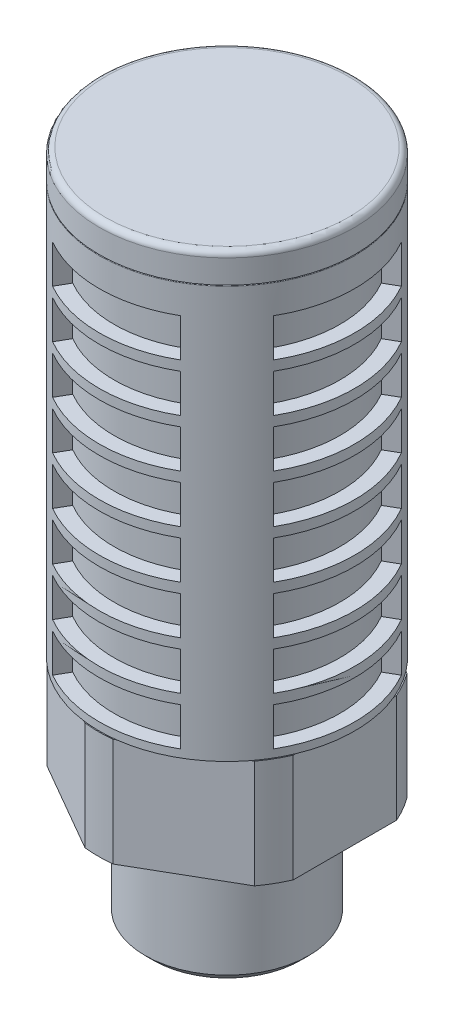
ISO-10303-21;
HEADER;
FILE_DESCRIPTION(('STEP AP214'),'2;1');
FILE_NAME('part.step','',(''),(''),'','','');
FILE_SCHEMA(('AUTOMOTIVE_DESIGN { 1 0 10303 214 1 1 1 1 }'));
ENDSEC;
DATA;
#1=APPLICATION_CONTEXT('core data for automotive mechanical design processes');
#2=APPLICATION_PROTOCOL_DEFINITION('international standard','automotive_design',2000,#1);
#3=PRODUCT_CONTEXT('',#1,'mechanical');
#4=PRODUCT('Part','Part','',(#3));
#5=PRODUCT_RELATED_PRODUCT_CATEGORY('part','',(#4));
#6=PRODUCT_DEFINITION_FORMATION('','',#4);
#7=PRODUCT_DEFINITION_CONTEXT('part definition',#1,'design');
#8=PRODUCT_DEFINITION('design','',#6,#7);
#9=PRODUCT_DEFINITION_SHAPE('','',#8);
#10=(LENGTH_UNIT() NAMED_UNIT(*) SI_UNIT(.MILLI.,.METRE.));
#11=(NAMED_UNIT(*) PLANE_ANGLE_UNIT() SI_UNIT($,.RADIAN.));
#12=(NAMED_UNIT(*) SI_UNIT($,.STERADIAN.) SOLID_ANGLE_UNIT());
#13=UNCERTAINTY_MEASURE_WITH_UNIT(LENGTH_MEASURE(1.E-05),#10,'distance_accuracy_value','');
#14=(GEOMETRIC_REPRESENTATION_CONTEXT(3) GLOBAL_UNCERTAINTY_ASSIGNED_CONTEXT((#13)) GLOBAL_UNIT_ASSIGNED_CONTEXT((#10,
#11,#12)) REPRESENTATION_CONTEXT('',''));
#15=CARTESIAN_POINT('',(0.,0.,0.));
#16=DIRECTION('',(0.,0.,1.));
#17=DIRECTION('',(1.,0.,0.));
#18=AXIS2_PLACEMENT_3D('',#15,#16,#17);
#19=CARTESIAN_POINT('',(13.,23.,0.));
#20=DIRECTION('',(0.,-1.,0.));
#21=DIRECTION('',(0.,0.,-1.));
#22=AXIS2_PLACEMENT_3D('',#19,#20,#21);
#23=PLANE('',#22);
#24=CARTESIAN_POINT('',(0.,23.,0.));
#25=DIRECTION('',(0.,1.,0.));
#26=DIRECTION('',(0.,0.,1.));
#27=AXIS2_PLACEMENT_3D('',#24,#25,#26);
#28=CIRCLE('',#27,13.106406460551);
#29=CARTESIAN_POINT('',(-10.5643638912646,23.,-7.75706812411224));
#30=VERTEX_POINT('',#29);
#31=CARTESIAN_POINT('',(-12.,23.,-5.27047344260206));
#32=VERTEX_POINT('',#31);
#33=EDGE_CURVE('E951',#30,#32,#28,.T.);
#34=ORIENTED_EDGE('',*,*,#33,.T.);
#35=DIRECTION('',(0.,0.,1.));
#36=VECTOR('',#35,1.);
#37=CARTESIAN_POINT('',(-12.,23.,-6.92820323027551));
#38=LINE('',#37,#36);
#39=CARTESIAN_POINT('',(-12.,23.,-5.));
#40=VERTEX_POINT('',#39);
#41=EDGE_CURVE('E2009',#32,#40,#38,.T.);
#42=ORIENTED_EDGE('',*,*,#41,.T.);
#43=CARTESIAN_POINT('',(0.,23.,0.));
#44=DIRECTION('',(0.,1.,0.));
#45=DIRECTION('',(0.,0.,1.));
#46=AXIS2_PLACEMENT_3D('',#43,#44,#45);
#47=CIRCLE('',#46,13.);
#48=CARTESIAN_POINT('',(-10.3301270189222,23.,-7.89230484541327));
#49=VERTEX_POINT('',#48);
#50=EDGE_CURVE('E2001',#49,#40,#47,.T.);
#51=ORIENTED_EDGE('',*,*,#50,.F.);
#52=DIRECTION('',(-0.866025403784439,0.,0.5));
#53=VECTOR('',#52,1.);
#54=CARTESIAN_POINT('',(0.,23.,-13.856406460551));
#55=LINE('',#54,#53);
#56=EDGE_CURVE('E2070',#49,#30,#55,.T.);
#57=ORIENTED_EDGE('',*,*,#56,.T.);
#58=EDGE_LOOP('',(#34,#42,#51,#57));
#59=FACE_BOUND('',#58,.T.);
#60=ADVANCED_FACE('F37',(#59),#23,.F.);
#61=CARTESIAN_POINT('',(-12.,23.,5.));
#62=VERTEX_POINT('',#61);
#63=CARTESIAN_POINT('',(-10.3301270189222,23.,7.89230484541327));
#64=VERTEX_POINT('',#63);
#65=EDGE_CURVE('E1999',#62,#64,#47,.T.);
#66=ORIENTED_EDGE('',*,*,#65,.F.);
#67=CARTESIAN_POINT('',(-12.,23.,5.27047344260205));
#68=VERTEX_POINT('',#67);
#69=EDGE_CURVE('E2010',#62,#68,#38,.T.);
#70=ORIENTED_EDGE('',*,*,#69,.T.);
#71=CARTESIAN_POINT('',(-10.5643638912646,23.,7.75706812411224));
#72=VERTEX_POINT('',#71);
#73=EDGE_CURVE('E972',#68,#72,#28,.T.);
#74=ORIENTED_EDGE('',*,*,#73,.T.);
#75=DIRECTION('',(0.866025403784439,0.,0.5));
#76=VECTOR('',#75,1.);
#77=CARTESIAN_POINT('',(-12.,23.,6.92820323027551));
#78=LINE('',#77,#76);
#79=EDGE_CURVE('E2016',#72,#64,#78,.T.);
#80=ORIENTED_EDGE('',*,*,#79,.T.);
#81=EDGE_LOOP('',(#66,#70,#74,#80));
#82=FACE_BOUND('',#81,.T.);
#83=ADVANCED_FACE('F1941',(#82),#23,.F.);
#84=CARTESIAN_POINT('',(-1.66987298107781,23.,12.8923048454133));
#85=VERTEX_POINT('',#84);
#86=CARTESIAN_POINT('',(1.6698729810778,23.,12.8923048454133));
#87=VERTEX_POINT('',#86);
#88=EDGE_CURVE('E979',#85,#87,#47,.T.);
#89=ORIENTED_EDGE('',*,*,#88,.F.);
#90=CARTESIAN_POINT('',(-1.4356361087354,23.,13.0275415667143));
#91=VERTEX_POINT('',#90);
#92=EDGE_CURVE('E2012',#85,#91,#78,.T.);
#93=ORIENTED_EDGE('',*,*,#92,.T.);
#94=CARTESIAN_POINT('',(1.4356361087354,23.,13.0275415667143));
#95=VERTEX_POINT('',#94);
#96=EDGE_CURVE('E969',#91,#95,#28,.T.);
#97=ORIENTED_EDGE('',*,*,#96,.T.);
#98=DIRECTION('',(0.866025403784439,0.,-0.5));
#99=VECTOR('',#98,1.);
#100=CARTESIAN_POINT('',(0.,23.,13.856406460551));
#101=LINE('',#100,#99);
#102=EDGE_CURVE('E2059',#95,#87,#101,.T.);
#103=ORIENTED_EDGE('',*,*,#102,.T.);
#104=EDGE_LOOP('',(#89,#93,#97,#103));
#105=FACE_BOUND('',#104,.T.);
#106=ADVANCED_FACE('F1948',(#105),#23,.F.);
#107=CARTESIAN_POINT('',(10.3301270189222,23.,7.89230484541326));
#108=VERTEX_POINT('',#107);
#109=CARTESIAN_POINT('',(12.,23.,5.));
#110=VERTEX_POINT('',#109);
#111=EDGE_CURVE('E978',#108,#110,#47,.T.);
#112=ORIENTED_EDGE('',*,*,#111,.F.);
#113=CARTESIAN_POINT('',(10.5643638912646,23.,7.75706812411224));
#114=VERTEX_POINT('',#113);
#115=EDGE_CURVE('E2062',#108,#114,#101,.T.);
#116=ORIENTED_EDGE('',*,*,#115,.T.);
#117=CARTESIAN_POINT('',(12.,23.,5.27047344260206));
#118=VERTEX_POINT('',#117);
#119=EDGE_CURVE('E973',#114,#118,#28,.T.);
#120=ORIENTED_EDGE('',*,*,#119,.T.);
#121=DIRECTION('',(0.,0.,-1.));
#122=VECTOR('',#121,1.);
#123=CARTESIAN_POINT('',(12.,23.,6.92820323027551));
#124=LINE('',#123,#122);
#125=EDGE_CURVE('E2068',#118,#110,#124,.T.);
#126=ORIENTED_EDGE('',*,*,#125,.T.);
#127=EDGE_LOOP('',(#112,#116,#120,#126));
#128=FACE_BOUND('',#127,.T.);
#129=ADVANCED_FACE('F1966',(#128),#23,.F.);
#130=CARTESIAN_POINT('',(12.,23.,-5.));
#131=VERTEX_POINT('',#130);
#132=CARTESIAN_POINT('',(10.3301270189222,23.,-7.89230484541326));
#133=VERTEX_POINT('',#132);
#134=EDGE_CURVE('E1977',#131,#133,#47,.T.);
#135=ORIENTED_EDGE('',*,*,#134,.F.);
#136=CARTESIAN_POINT('',(12.,23.,-5.27047344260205));
#137=VERTEX_POINT('',#136);
#138=EDGE_CURVE('E1980',#131,#137,#124,.T.);
#139=ORIENTED_EDGE('',*,*,#138,.T.);
#140=CARTESIAN_POINT('',(10.5643638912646,23.,-7.75706812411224));
#141=VERTEX_POINT('',#140);
#142=EDGE_CURVE('E2021',#137,#141,#28,.T.);
#143=ORIENTED_EDGE('',*,*,#142,.T.);
#144=DIRECTION('',(-0.866025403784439,0.,-0.5));
#145=VECTOR('',#144,1.);
#146=CARTESIAN_POINT('',(12.,23.,-6.92820323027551));
#147=LINE('',#146,#145);
#148=EDGE_CURVE('E1982',#141,#133,#147,.T.);
#149=ORIENTED_EDGE('',*,*,#148,.T.);
#150=EDGE_LOOP('',(#135,#139,#143,#149));
#151=FACE_BOUND('',#150,.T.);
#152=ADVANCED_FACE('F1955',(#151),#23,.F.);
#153=CARTESIAN_POINT('',(0.,0.,0.));
#154=DIRECTION('',(0.,1.,0.));
#155=DIRECTION('',(0.,0.,1.));
#156=AXIS2_PLACEMENT_3D('',#153,#154,#155);
#157=CYLINDRICAL_SURFACE('',#156,13.106406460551);
#158=CARTESIAN_POINT('',(0.,12.,0.));
#159=DIRECTION('',(0.,1.,0.));
#160=DIRECTION('',(0.,0.,1.));
#161=AXIS2_PLACEMENT_3D('',#158,#159,#160);
#162=CIRCLE('',#161,13.106406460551);
#163=CARTESIAN_POINT('',(-10.5643638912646,12.,-7.75706812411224));
#164=VERTEX_POINT('',#163);
#165=CARTESIAN_POINT('',(-12.,12.,-5.27047344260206));
#166=VERTEX_POINT('',#165);
#167=EDGE_CURVE('E949',#164,#166,#162,.T.);
#168=ORIENTED_EDGE('',*,*,#167,.T.);
#169=DIRECTION('',(0.,1.,0.));
#170=VECTOR('',#169,1.);
#171=CARTESIAN_POINT('',(-12.,0.,-5.27047344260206));
#172=LINE('',#171,#170);
#173=EDGE_CURVE('E60',#166,#32,#172,.T.);
#174=ORIENTED_EDGE('',*,*,#173,.T.);
#175=ORIENTED_EDGE('',*,*,#33,.F.);
#176=DIRECTION('',(0.,1.,0.));
#177=VECTOR('',#176,1.);
#178=CARTESIAN_POINT('',(-10.5643638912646,0.,-7.75706812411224));
#179=LINE('',#178,#177);
#180=EDGE_CURVE('E934',#30,#164,#179,.F.);
#181=ORIENTED_EDGE('',*,*,#180,.T.);
#182=EDGE_LOOP('',(#168,#174,#175,#181));
#183=FACE_BOUND('',#182,.T.);
#184=ADVANCED_FACE('F948',(#183),#157,.T.);
#185=ORIENTED_EDGE('',*,*,#73,.F.);
#186=DIRECTION('',(0.,1.,0.));
#187=VECTOR('',#186,1.);
#188=CARTESIAN_POINT('',(-12.,0.,5.27047344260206));
#189=LINE('',#188,#187);
#190=CARTESIAN_POINT('',(-12.,12.,5.27047344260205));
#191=VERTEX_POINT('',#190);
#192=EDGE_CURVE('E1063',#68,#191,#189,.F.);
#193=ORIENTED_EDGE('',*,*,#192,.T.);
#194=CARTESIAN_POINT('',(-10.5643638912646,12.,7.75706812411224));
#195=VERTEX_POINT('',#194);
#196=EDGE_CURVE('E958',#191,#195,#162,.T.);
#197=ORIENTED_EDGE('',*,*,#196,.T.);
#198=DIRECTION('',(0.,1.,0.));
#199=VECTOR('',#198,1.);
#200=CARTESIAN_POINT('',(-10.5643638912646,0.,7.75706812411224));
#201=LINE('',#200,#199);
#202=EDGE_CURVE('E52',#195,#72,#201,.T.);
#203=ORIENTED_EDGE('',*,*,#202,.T.);
#204=EDGE_LOOP('',(#185,#193,#197,#203));
#205=FACE_BOUND('',#204,.T.);
#206=ADVANCED_FACE('F1061',(#205),#157,.T.);
#207=ORIENTED_EDGE('',*,*,#96,.F.);
#208=DIRECTION('',(0.,1.,0.));
#209=VECTOR('',#208,1.);
#210=CARTESIAN_POINT('',(-1.4356361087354,0.,13.0275415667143));
#211=LINE('',#210,#209);
#212=CARTESIAN_POINT('',(-1.4356361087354,12.,13.0275415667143));
#213=VERTEX_POINT('',#212);
#214=EDGE_CURVE('E1068',#91,#213,#211,.F.);
#215=ORIENTED_EDGE('',*,*,#214,.T.);
#216=CARTESIAN_POINT('',(1.43563610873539,12.,13.0275415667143));
#217=VERTEX_POINT('',#216);
#218=EDGE_CURVE('E962',#213,#217,#162,.T.);
#219=ORIENTED_EDGE('',*,*,#218,.T.);
#220=DIRECTION('',(0.,1.,0.));
#221=VECTOR('',#220,1.);
#222=CARTESIAN_POINT('',(1.4356361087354,0.,13.0275415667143));
#223=LINE('',#222,#221);
#224=EDGE_CURVE('E2049',#217,#95,#223,.T.);
#225=ORIENTED_EDGE('',*,*,#224,.T.);
#226=EDGE_LOOP('',(#207,#215,#219,#225));
#227=FACE_BOUND('',#226,.T.);
#228=ADVANCED_FACE('F2053',(#227),#157,.T.);
#229=ORIENTED_EDGE('',*,*,#119,.F.);
#230=DIRECTION('',(0.,1.,0.));
#231=VECTOR('',#230,1.);
#232=CARTESIAN_POINT('',(10.5643638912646,0.,7.75706812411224));
#233=LINE('',#232,#231);
#234=CARTESIAN_POINT('',(10.5643638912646,12.,7.75706812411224));
#235=VERTEX_POINT('',#234);
#236=EDGE_CURVE('E2046',#114,#235,#233,.F.);
#237=ORIENTED_EDGE('',*,*,#236,.T.);
#238=CARTESIAN_POINT('',(12.,12.,5.27047344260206));
#239=VERTEX_POINT('',#238);
#240=EDGE_CURVE('E967',#235,#239,#162,.T.);
#241=ORIENTED_EDGE('',*,*,#240,.T.);
#242=DIRECTION('',(0.,1.,0.));
#243=VECTOR('',#242,1.);
#244=CARTESIAN_POINT('',(12.,0.,5.27047344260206));
#245=LINE('',#244,#243);
#246=EDGE_CURVE('E2043',#239,#118,#245,.T.);
#247=ORIENTED_EDGE('',*,*,#246,.T.);
#248=EDGE_LOOP('',(#229,#237,#241,#247));
#249=FACE_BOUND('',#248,.T.);
#250=ADVANCED_FACE('F2085',(#249),#157,.T.);
#251=ORIENTED_EDGE('',*,*,#142,.F.);
#252=DIRECTION('',(0.,1.,0.));
#253=VECTOR('',#252,1.);
#254=CARTESIAN_POINT('',(12.,0.,-5.27047344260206));
#255=LINE('',#254,#253);
#256=CARTESIAN_POINT('',(12.,12.,-5.27047344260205));
#257=VERTEX_POINT('',#256);
#258=EDGE_CURVE('E2040',#137,#257,#255,.F.);
#259=ORIENTED_EDGE('',*,*,#258,.T.);
#260=CARTESIAN_POINT('',(10.5643638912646,12.,-7.75706812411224));
#261=VERTEX_POINT('',#260);
#262=EDGE_CURVE('E960',#257,#261,#162,.T.);
#263=ORIENTED_EDGE('',*,*,#262,.T.);
#264=DIRECTION('',(0.,1.,0.));
#265=VECTOR('',#264,1.);
#266=CARTESIAN_POINT('',(10.5643638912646,0.,-7.75706812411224));
#267=LINE('',#266,#265);
#268=EDGE_CURVE('E2034',#261,#141,#267,.T.);
#269=ORIENTED_EDGE('',*,*,#268,.T.);
#270=EDGE_LOOP('',(#251,#259,#263,#269));
#271=FACE_BOUND('',#270,.T.);
#272=ADVANCED_FACE('F1961',(#271),#157,.T.);
#273=CARTESIAN_POINT('',(0.,68.,0.));
#274=DIRECTION('',(0.,-1.,0.));
#275=DIRECTION('',(0.,0.,-1.));
#276=AXIS2_PLACEMENT_3D('',#273,#274,#275);
#277=PLANE('',#276);
#278=CARTESIAN_POINT('',(0.,68.,0.));
#279=DIRECTION('',(0.,1.,0.));
#280=DIRECTION('',(0.,0.,1.));
#281=AXIS2_PLACEMENT_3D('',#278,#279,#280);
#282=CIRCLE('',#281,12.4);
#283=CARTESIAN_POINT('',(0.,68.,12.4));
#284=VERTEX_POINT('',#283);
#285=EDGE_CURVE('E991',#284,#284,#282,.T.);
#286=ORIENTED_EDGE('',*,*,#285,.T.);
#287=EDGE_LOOP('',(#286));
#288=FACE_BOUND('',#287,.T.);
#289=ADVANCED_FACE('F39',(#288),#277,.F.);
#290=CARTESIAN_POINT('',(0.,67.4,0.));
#291=DIRECTION('',(0.,1.,0.));
#292=DIRECTION('',(0.,0.,1.));
#293=AXIS2_PLACEMENT_3D('',#290,#291,#292);
#294=TOROIDAL_SURFACE('',#293,12.4,0.600000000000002);
#295=ORIENTED_EDGE('',*,*,#285,.F.);
#296=EDGE_LOOP('',(#295));
#297=FACE_BOUND('',#296,.T.);
#298=CARTESIAN_POINT('',(0.,67.4,0.));
#299=DIRECTION('',(0.,1.,0.));
#300=DIRECTION('',(0.,0.,1.));
#301=AXIS2_PLACEMENT_3D('',#298,#299,#300);
#302=CIRCLE('',#301,13.);
#303=CARTESIAN_POINT('',(0.,67.4,13.));
#304=VERTEX_POINT('',#303);
#305=EDGE_CURVE('E988',#304,#304,#302,.T.);
#306=ORIENTED_EDGE('',*,*,#305,.T.);
#307=EDGE_LOOP('',(#306));
#308=FACE_BOUND('',#307,.T.);
#309=ADVANCED_FACE('F4226',(#297,#308),#294,.T.);
#310=CARTESIAN_POINT('',(0.,0.,0.));
#311=DIRECTION('',(0.,1.,0.));
#312=DIRECTION('',(0.,0.,1.));
#313=AXIS2_PLACEMENT_3D('',#310,#311,#312);
#314=CYLINDRICAL_SURFACE('',#313,13.);
#315=ORIENTED_EDGE('',*,*,#305,.F.);
#316=EDGE_LOOP('',(#315));
#317=FACE_BOUND('',#316,.T.);
#318=CARTESIAN_POINT('',(0.,65.,0.));
#319=DIRECTION('',(0.,1.,0.));
#320=DIRECTION('',(0.,0.,1.));
#321=AXIS2_PLACEMENT_3D('',#318,#319,#320);
#322=CIRCLE('',#321,13.);
#323=CARTESIAN_POINT('',(0.,65.,13.));
#324=VERTEX_POINT('',#323);
#325=EDGE_CURVE('E985',#324,#324,#322,.T.);
#326=ORIENTED_EDGE('',*,*,#325,.T.);
#327=EDGE_LOOP('',(#326));
#328=FACE_BOUND('',#327,.T.);
#329=ADVANCED_FACE('F4230',(#317,#328),#314,.T.);
#330=CARTESIAN_POINT('',(13.,65.,0.));
#331=DIRECTION('',(0.,1.,0.));
#332=DIRECTION('',(0.,0.,1.));
#333=AXIS2_PLACEMENT_3D('',#330,#331,#332);
#334=PLANE('',#333);
#335=ORIENTED_EDGE('',*,*,#325,.F.);
#336=EDGE_LOOP('',(#335));
#337=FACE_BOUND('',#336,.T.);
#338=CARTESIAN_POINT('',(0.,65.,0.));
#339=DIRECTION('',(0.,1.,0.));
#340=DIRECTION('',(0.,0.,1.));
#341=AXIS2_PLACEMENT_3D('',#338,#339,#340);
#342=CIRCLE('',#341,12.9);
#343=CARTESIAN_POINT('',(0.,65.,12.9));
#344=VERTEX_POINT('',#343);
#345=EDGE_CURVE('E982',#344,#344,#342,.T.);
#346=ORIENTED_EDGE('',*,*,#345,.T.);
#347=EDGE_LOOP('',(#346));
#348=FACE_BOUND('',#347,.T.);
#349=ADVANCED_FACE('F3520',(#337,#348),#334,.F.);
#350=CARTESIAN_POINT('',(0.,64.9,0.));
#351=DIRECTION('',(0.,1.,0.));
#352=DIRECTION('',(0.,0.,1.));
#353=AXIS2_PLACEMENT_3D('',#350,#351,#352);
#354=TOROIDAL_SURFACE('',#353,12.9,0.0999999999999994);
#355=ORIENTED_EDGE('',*,*,#345,.F.);
#356=EDGE_LOOP('',(#355));
#357=FACE_BOUND('',#356,.T.);
#358=CARTESIAN_POINT('',(0.,64.9,0.));
#359=DIRECTION('',(0.,1.,0.));
#360=DIRECTION('',(0.,0.,1.));
#361=AXIS2_PLACEMENT_3D('',#358,#359,#360);
#362=CIRCLE('',#361,13.);
#363=CARTESIAN_POINT('',(0.,64.9,13.));
#364=VERTEX_POINT('',#363);
#365=EDGE_CURVE('E977',#364,#364,#362,.T.);
#366=ORIENTED_EDGE('',*,*,#365,.T.);
#367=EDGE_LOOP('',(#366));
#368=FACE_BOUND('',#367,.T.);
#369=ADVANCED_FACE('F1962',(#357,#368),#354,.T.);
#370=CARTESIAN_POINT('',(0.,0.,0.));
#371=DIRECTION('',(0.,1.,0.));
#372=DIRECTION('',(0.,0.,1.));
#373=AXIS2_PLACEMENT_3D('',#370,#371,#372);
#374=CYLINDRICAL_SURFACE('',#373,13.);
#375=CARTESIAN_POINT('',(0.,57.1,0.));
#376=DIRECTION('',(0.,-1.,0.));
#377=DIRECTION('',(0.,0.,-1.));
#378=AXIS2_PLACEMENT_3D('',#375,#376,#377);
#379=CIRCLE('',#378,13.);
#380=CARTESIAN_POINT('',(6.5,57.1,11.2583302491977));
#381=VERTEX_POINT('',#380);
#382=CARTESIAN_POINT('',(-6.5,57.1,11.2583302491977));
#383=VERTEX_POINT('',#382);
#384=EDGE_CURVE('E1217',#381,#383,#379,.T.);
#385=ORIENTED_EDGE('',*,*,#384,.F.);
#386=DIRECTION('',(0.,1.,0.));
#387=VECTOR('',#386,1.);
#388=CARTESIAN_POINT('',(6.5,0.,11.2583302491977));
#389=LINE('',#388,#387);
#390=CARTESIAN_POINT('',(6.5,53.2,11.2583302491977));
#391=VERTEX_POINT('',#390);
#392=EDGE_CURVE('E4320',#381,#391,#389,.F.);
#393=ORIENTED_EDGE('',*,*,#392,.T.);
#394=CARTESIAN_POINT('',(0.,53.2,0.));
#395=DIRECTION('',(0.,-1.,0.));
#396=DIRECTION('',(0.,0.,-1.));
#397=AXIS2_PLACEMENT_3D('',#394,#395,#396);
#398=CIRCLE('',#397,13.);
#399=CARTESIAN_POINT('',(-6.5,53.2,11.2583302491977));
#400=VERTEX_POINT('',#399);
#401=EDGE_CURVE('E1224',#391,#400,#398,.T.);
#402=ORIENTED_EDGE('',*,*,#401,.T.);
#403=DIRECTION('',(0.,1.,0.));
#404=VECTOR('',#403,1.);
#405=CARTESIAN_POINT('',(-6.5,0.,11.2583302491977));
#406=LINE('',#405,#404);
#407=EDGE_CURVE('E4315',#383,#400,#406,.F.);
#408=ORIENTED_EDGE('',*,*,#407,.F.);
#409=EDGE_LOOP('',(#385,#393,#402,#408));
#410=FACE_BOUND('',#409,.T.);
#411=CARTESIAN_POINT('',(0.,52.2,0.));
#412=DIRECTION('',(0.,-1.,0.));
#413=DIRECTION('',(0.,0.,-1.));
#414=AXIS2_PLACEMENT_3D('',#411,#412,#413);
#415=CIRCLE('',#414,13.);
#416=CARTESIAN_POINT('',(6.5,52.2,11.2583302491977));
#417=VERTEX_POINT('',#416);
#418=CARTESIAN_POINT('',(-6.5,52.2,11.2583302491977));
#419=VERTEX_POINT('',#418);
#420=EDGE_CURVE('E1227',#417,#419,#415,.T.);
#421=ORIENTED_EDGE('',*,*,#420,.F.);
#422=CARTESIAN_POINT('',(6.5,48.3,11.2583302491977));
#423=VERTEX_POINT('',#422);
#424=EDGE_CURVE('E4322',#417,#423,#389,.F.);
#425=ORIENTED_EDGE('',*,*,#424,.T.);
#426=CARTESIAN_POINT('',(0.,48.3,0.));
#427=DIRECTION('',(0.,-1.,0.));
#428=DIRECTION('',(0.,0.,-1.));
#429=AXIS2_PLACEMENT_3D('',#426,#427,#428);
#430=CIRCLE('',#429,13.);
#431=CARTESIAN_POINT('',(-6.5,48.3,11.2583302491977));
#432=VERTEX_POINT('',#431);
#433=EDGE_CURVE('E1234',#423,#432,#430,.T.);
#434=ORIENTED_EDGE('',*,*,#433,.T.);
#435=EDGE_CURVE('E4357',#419,#432,#406,.F.);
#436=ORIENTED_EDGE('',*,*,#435,.F.);
#437=EDGE_LOOP('',(#421,#425,#434,#436));
#438=FACE_BOUND('',#437,.T.);
#439=CARTESIAN_POINT('',(0.,47.3,0.));
#440=DIRECTION('',(0.,-1.,0.));
#441=DIRECTION('',(0.,0.,-1.));
#442=AXIS2_PLACEMENT_3D('',#439,#440,#441);
#443=CIRCLE('',#442,13.);
#444=CARTESIAN_POINT('',(6.5,47.3,11.2583302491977));
#445=VERTEX_POINT('',#444);
#446=CARTESIAN_POINT('',(-6.5,47.3,11.2583302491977));
#447=VERTEX_POINT('',#446);
#448=EDGE_CURVE('E1237',#445,#447,#443,.T.);
#449=ORIENTED_EDGE('',*,*,#448,.F.);
#450=CARTESIAN_POINT('',(6.5,43.4,11.2583302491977));
#451=VERTEX_POINT('',#450);
#452=EDGE_CURVE('E4325',#445,#451,#389,.F.);
#453=ORIENTED_EDGE('',*,*,#452,.T.);
#454=CARTESIAN_POINT('',(0.,43.4,0.));
#455=DIRECTION('',(0.,-1.,0.));
#456=DIRECTION('',(0.,0.,-1.));
#457=AXIS2_PLACEMENT_3D('',#454,#455,#456);
#458=CIRCLE('',#457,13.);
#459=CARTESIAN_POINT('',(-6.5,43.4,11.2583302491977));
#460=VERTEX_POINT('',#459);
#461=EDGE_CURVE('E1244',#451,#460,#458,.T.);
#462=ORIENTED_EDGE('',*,*,#461,.T.);
#463=EDGE_CURVE('E4354',#447,#460,#406,.F.);
#464=ORIENTED_EDGE('',*,*,#463,.F.);
#465=EDGE_LOOP('',(#449,#453,#462,#464));
#466=FACE_BOUND('',#465,.T.);
#467=CARTESIAN_POINT('',(0.,42.4,0.));
#468=DIRECTION('',(0.,-1.,0.));
#469=DIRECTION('',(0.,0.,-1.));
#470=AXIS2_PLACEMENT_3D('',#467,#468,#469);
#471=CIRCLE('',#470,13.);
#472=CARTESIAN_POINT('',(6.5,42.4,11.2583302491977));
#473=VERTEX_POINT('',#472);
#474=CARTESIAN_POINT('',(-6.5,42.4,11.2583302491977));
#475=VERTEX_POINT('',#474);
#476=EDGE_CURVE('E1247',#473,#475,#471,.T.);
#477=ORIENTED_EDGE('',*,*,#476,.F.);
#478=CARTESIAN_POINT('',(6.5,38.5,11.2583302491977));
#479=VERTEX_POINT('',#478);
#480=EDGE_CURVE('E4329',#473,#479,#389,.F.);
#481=ORIENTED_EDGE('',*,*,#480,.T.);
#482=CARTESIAN_POINT('',(0.,38.5,0.));
#483=DIRECTION('',(0.,-1.,0.));
#484=DIRECTION('',(0.,0.,-1.));
#485=AXIS2_PLACEMENT_3D('',#482,#483,#484);
#486=CIRCLE('',#485,13.);
#487=CARTESIAN_POINT('',(-6.5,38.5,11.2583302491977));
#488=VERTEX_POINT('',#487);
#489=EDGE_CURVE('E1254',#479,#488,#486,.T.);
#490=ORIENTED_EDGE('',*,*,#489,.T.);
#491=EDGE_CURVE('E4351',#475,#488,#406,.F.);
#492=ORIENTED_EDGE('',*,*,#491,.F.);
#493=EDGE_LOOP('',(#477,#481,#490,#492));
#494=FACE_BOUND('',#493,.T.);
#495=CARTESIAN_POINT('',(0.,37.5,0.));
#496=DIRECTION('',(0.,-1.,0.));
#497=DIRECTION('',(0.,0.,-1.));
#498=AXIS2_PLACEMENT_3D('',#495,#496,#497);
#499=CIRCLE('',#498,13.);
#500=CARTESIAN_POINT('',(6.5,37.5,11.2583302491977));
#501=VERTEX_POINT('',#500);
#502=CARTESIAN_POINT('',(-6.5,37.5,11.2583302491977));
#503=VERTEX_POINT('',#502);
#504=EDGE_CURVE('E1257',#501,#503,#499,.T.);
#505=ORIENTED_EDGE('',*,*,#504,.F.);
#506=CARTESIAN_POINT('',(6.5,33.6,11.2583302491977));
#507=VERTEX_POINT('',#506);
#508=EDGE_CURVE('E4333',#501,#507,#389,.F.);
#509=ORIENTED_EDGE('',*,*,#508,.T.);
#510=CARTESIAN_POINT('',(0.,33.6,0.));
#511=DIRECTION('',(0.,-1.,0.));
#512=DIRECTION('',(0.,0.,-1.));
#513=AXIS2_PLACEMENT_3D('',#510,#511,#512);
#514=CIRCLE('',#513,13.);
#515=CARTESIAN_POINT('',(-6.5,33.6,11.2583302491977));
#516=VERTEX_POINT('',#515);
#517=EDGE_CURVE('E1264',#507,#516,#514,.T.);
#518=ORIENTED_EDGE('',*,*,#517,.T.);
#519=EDGE_CURVE('E4350',#503,#516,#406,.F.);
#520=ORIENTED_EDGE('',*,*,#519,.F.);
#521=EDGE_LOOP('',(#505,#509,#518,#520));
#522=FACE_BOUND('',#521,.T.);
#523=CARTESIAN_POINT('',(0.,32.6,0.));
#524=DIRECTION('',(0.,-1.,0.));
#525=DIRECTION('',(0.,0.,-1.));
#526=AXIS2_PLACEMENT_3D('',#523,#524,#525);
#527=CIRCLE('',#526,13.);
#528=CARTESIAN_POINT('',(6.5,32.6,11.2583302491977));
#529=VERTEX_POINT('',#528);
#530=CARTESIAN_POINT('',(-6.5,32.6,11.2583302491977));
#531=VERTEX_POINT('',#530);
#532=EDGE_CURVE('E1267',#529,#531,#527,.T.);
#533=ORIENTED_EDGE('',*,*,#532,.F.);
#534=CARTESIAN_POINT('',(6.5,28.7,11.2583302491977));
#535=VERTEX_POINT('',#534);
#536=EDGE_CURVE('E1047',#529,#535,#389,.F.);
#537=ORIENTED_EDGE('',*,*,#536,.T.);
#538=CARTESIAN_POINT('',(0.,28.7,0.));
#539=DIRECTION('',(0.,-1.,0.));
#540=DIRECTION('',(0.,0.,-1.));
#541=AXIS2_PLACEMENT_3D('',#538,#539,#540);
#542=CIRCLE('',#541,13.);
#543=CARTESIAN_POINT('',(-6.5,28.7,11.2583302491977));
#544=VERTEX_POINT('',#543);
#545=EDGE_CURVE('E1274',#535,#544,#542,.T.);
#546=ORIENTED_EDGE('',*,*,#545,.T.);
#547=EDGE_CURVE('E1038',#531,#544,#406,.F.);
#548=ORIENTED_EDGE('',*,*,#547,.F.);
#549=EDGE_LOOP('',(#533,#537,#546,#548));
#550=FACE_BOUND('',#549,.T.);
#551=CARTESIAN_POINT('',(0.,27.7,0.));
#552=DIRECTION('',(0.,-1.,0.));
#553=DIRECTION('',(0.,0.,-1.));
#554=AXIS2_PLACEMENT_3D('',#551,#552,#553);
#555=CIRCLE('',#554,13.);
#556=CARTESIAN_POINT('',(6.5,27.7,11.2583302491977));
#557=VERTEX_POINT('',#556);
#558=CARTESIAN_POINT('',(-6.5,27.7,11.2583302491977));
#559=VERTEX_POINT('',#558);
#560=EDGE_CURVE('E1277',#557,#559,#555,.T.);
#561=ORIENTED_EDGE('',*,*,#560,.F.);
#562=CARTESIAN_POINT('',(6.5,23.8,11.2583302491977));
#563=VERTEX_POINT('',#562);
#564=EDGE_CURVE('E1045',#557,#563,#389,.F.);
#565=ORIENTED_EDGE('',*,*,#564,.T.);
#566=CARTESIAN_POINT('',(0.,23.8,0.));
#567=DIRECTION('',(0.,1.,0.));
#568=DIRECTION('',(0.,0.,1.));
#569=AXIS2_PLACEMENT_3D('',#566,#567,#568);
#570=CIRCLE('',#569,13.);
#571=CARTESIAN_POINT('',(-6.5,23.8,11.2583302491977));
#572=VERTEX_POINT('',#571);
#573=EDGE_CURVE('E1040',#572,#563,#570,.T.);
#574=ORIENTED_EDGE('',*,*,#573,.F.);
#575=EDGE_CURVE('E1036',#559,#572,#406,.F.);
#576=ORIENTED_EDGE('',*,*,#575,.F.);
#577=EDGE_LOOP('',(#561,#565,#574,#576));
#578=FACE_BOUND('',#577,.T.);
#579=CARTESIAN_POINT('',(0.,62.0000000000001,0.));
#580=DIRECTION('',(0.,-1.,0.));
#581=DIRECTION('',(0.,0.,-1.));
#582=AXIS2_PLACEMENT_3D('',#579,#580,#581);
#583=CIRCLE('',#582,13.);
#584=CARTESIAN_POINT('',(6.5,62.,11.2583302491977));
#585=VERTEX_POINT('',#584);
#586=CARTESIAN_POINT('',(-6.5,62.0000000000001,11.2583302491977));
#587=VERTEX_POINT('',#586);
#588=EDGE_CURVE('E1042',#585,#587,#583,.T.);
#589=ORIENTED_EDGE('',*,*,#588,.F.);
#590=CARTESIAN_POINT('',(6.5,58.1000000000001,11.2583302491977));
#591=VERTEX_POINT('',#590);
#592=EDGE_CURVE('E943',#585,#591,#389,.F.);
#593=ORIENTED_EDGE('',*,*,#592,.T.);
#594=CARTESIAN_POINT('',(0.,58.1000000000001,0.));
#595=DIRECTION('',(0.,-1.,0.));
#596=DIRECTION('',(0.,0.,-1.));
#597=AXIS2_PLACEMENT_3D('',#594,#595,#596);
#598=CIRCLE('',#597,13.);
#599=CARTESIAN_POINT('',(-6.5,58.1000000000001,11.2583302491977));
#600=VERTEX_POINT('',#599);
#601=EDGE_CURVE('E1214',#591,#600,#598,.T.);
#602=ORIENTED_EDGE('',*,*,#601,.T.);
#603=EDGE_CURVE('E1039',#587,#600,#406,.F.);
#604=ORIENTED_EDGE('',*,*,#603,.F.);
#605=EDGE_LOOP('',(#589,#593,#602,#604));
#606=FACE_BOUND('',#605,.T.);
#607=CARTESIAN_POINT('',(0.,28.7,0.));
#608=DIRECTION('',(0.,1.,0.));
#609=DIRECTION('',(0.,0.,1.));
#610=AXIS2_PLACEMENT_3D('',#607,#608,#609);
#611=CIRCLE('',#610,13.);
#612=CARTESIAN_POINT('',(6.5,28.7,-11.2583302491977));
#613=VERTEX_POINT('',#612);
#614=CARTESIAN_POINT('',(-6.5,28.7,-11.2583302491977));
#615=VERTEX_POINT('',#614);
#616=EDGE_CURVE('E1426',#613,#615,#611,.T.);
#617=ORIENTED_EDGE('',*,*,#616,.F.);
#618=DIRECTION('',(0.,1.,0.));
#619=VECTOR('',#618,1.);
#620=CARTESIAN_POINT('',(6.5,0.,-11.2583302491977));
#621=LINE('',#620,#619);
#622=CARTESIAN_POINT('',(6.5,32.6,-11.2583302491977));
#623=VERTEX_POINT('',#622);
#624=EDGE_CURVE('E4616',#613,#623,#621,.T.);
#625=ORIENTED_EDGE('',*,*,#624,.T.);
#626=CARTESIAN_POINT('',(0.,32.6,0.));
#627=DIRECTION('',(0.,1.,0.));
#628=DIRECTION('',(0.,0.,1.));
#629=AXIS2_PLACEMENT_3D('',#626,#627,#628);
#630=CIRCLE('',#629,13.);
#631=CARTESIAN_POINT('',(-6.5,32.6,-11.2583302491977));
#632=VERTEX_POINT('',#631);
#633=EDGE_CURVE('E1433',#623,#632,#630,.T.);
#634=ORIENTED_EDGE('',*,*,#633,.T.);
#635=DIRECTION('',(0.,1.,0.));
#636=VECTOR('',#635,1.);
#637=CARTESIAN_POINT('',(-6.5,0.,-11.2583302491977));
#638=LINE('',#637,#636);
#639=EDGE_CURVE('E4634',#615,#632,#638,.T.);
#640=ORIENTED_EDGE('',*,*,#639,.F.);
#641=EDGE_LOOP('',(#617,#625,#634,#640));
#642=FACE_BOUND('',#641,.T.);
#643=CARTESIAN_POINT('',(0.,33.6,0.));
#644=DIRECTION('',(0.,1.,0.));
#645=DIRECTION('',(0.,0.,1.));
#646=AXIS2_PLACEMENT_3D('',#643,#644,#645);
#647=CIRCLE('',#646,13.);
#648=CARTESIAN_POINT('',(6.5,33.6,-11.2583302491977));
#649=VERTEX_POINT('',#648);
#650=CARTESIAN_POINT('',(-6.5,33.6,-11.2583302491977));
#651=VERTEX_POINT('',#650);
#652=EDGE_CURVE('E1436',#649,#651,#647,.T.);
#653=ORIENTED_EDGE('',*,*,#652,.F.);
#654=CARTESIAN_POINT('',(6.5,37.5,-11.2583302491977));
#655=VERTEX_POINT('',#654);
#656=EDGE_CURVE('E4617',#649,#655,#621,.T.);
#657=ORIENTED_EDGE('',*,*,#656,.T.);
#658=CARTESIAN_POINT('',(0.,37.5,0.));
#659=DIRECTION('',(0.,1.,0.));
#660=DIRECTION('',(0.,0.,1.));
#661=AXIS2_PLACEMENT_3D('',#658,#659,#660);
#662=CIRCLE('',#661,13.);
#663=CARTESIAN_POINT('',(-6.5,37.5,-11.2583302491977));
#664=VERTEX_POINT('',#663);
#665=EDGE_CURVE('E1443',#655,#664,#662,.T.);
#666=ORIENTED_EDGE('',*,*,#665,.T.);
#667=EDGE_CURVE('E4632',#651,#664,#638,.T.);
#668=ORIENTED_EDGE('',*,*,#667,.F.);
#669=EDGE_LOOP('',(#653,#657,#666,#668));
#670=FACE_BOUND('',#669,.T.);
#671=CARTESIAN_POINT('',(0.,38.5,0.));
#672=DIRECTION('',(0.,1.,0.));
#673=DIRECTION('',(0.,0.,1.));
#674=AXIS2_PLACEMENT_3D('',#671,#672,#673);
#675=CIRCLE('',#674,13.);
#676=CARTESIAN_POINT('',(6.5,38.5,-11.2583302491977));
#677=VERTEX_POINT('',#676);
#678=CARTESIAN_POINT('',(-6.5,38.5,-11.2583302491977));
#679=VERTEX_POINT('',#678);
#680=EDGE_CURVE('E1446',#677,#679,#675,.T.);
#681=ORIENTED_EDGE('',*,*,#680,.F.);
#682=CARTESIAN_POINT('',(6.5,42.4,-11.2583302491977));
#683=VERTEX_POINT('',#682);
#684=EDGE_CURVE('E4618',#677,#683,#621,.T.);
#685=ORIENTED_EDGE('',*,*,#684,.T.);
#686=CARTESIAN_POINT('',(0.,42.4,0.));
#687=DIRECTION('',(0.,1.,0.));
#688=DIRECTION('',(0.,0.,1.));
#689=AXIS2_PLACEMENT_3D('',#686,#687,#688);
#690=CIRCLE('',#689,13.);
#691=CARTESIAN_POINT('',(-6.5,42.4,-11.2583302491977));
#692=VERTEX_POINT('',#691);
#693=EDGE_CURVE('E1453',#683,#692,#690,.T.);
#694=ORIENTED_EDGE('',*,*,#693,.T.);
#695=EDGE_CURVE('E4630',#679,#692,#638,.T.);
#696=ORIENTED_EDGE('',*,*,#695,.F.);
#697=EDGE_LOOP('',(#681,#685,#694,#696));
#698=FACE_BOUND('',#697,.T.);
#699=CARTESIAN_POINT('',(0.,43.4,0.));
#700=DIRECTION('',(0.,1.,0.));
#701=DIRECTION('',(0.,0.,1.));
#702=AXIS2_PLACEMENT_3D('',#699,#700,#701);
#703=CIRCLE('',#702,13.);
#704=CARTESIAN_POINT('',(6.5,43.4,-11.2583302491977));
#705=VERTEX_POINT('',#704);
#706=CARTESIAN_POINT('',(-6.5,43.4,-11.2583302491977));
#707=VERTEX_POINT('',#706);
#708=EDGE_CURVE('E1456',#705,#707,#703,.T.);
#709=ORIENTED_EDGE('',*,*,#708,.F.);
#710=CARTESIAN_POINT('',(6.5,47.3,-11.2583302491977));
#711=VERTEX_POINT('',#710);
#712=EDGE_CURVE('E4619',#705,#711,#621,.T.);
#713=ORIENTED_EDGE('',*,*,#712,.T.);
#714=CARTESIAN_POINT('',(0.,47.3,0.));
#715=DIRECTION('',(0.,1.,0.));
#716=DIRECTION('',(0.,0.,1.));
#717=AXIS2_PLACEMENT_3D('',#714,#715,#716);
#718=CIRCLE('',#717,13.);
#719=CARTESIAN_POINT('',(-6.5,47.3,-11.2583302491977));
#720=VERTEX_POINT('',#719);
#721=EDGE_CURVE('E1463',#711,#720,#718,.T.);
#722=ORIENTED_EDGE('',*,*,#721,.T.);
#723=EDGE_CURVE('E4628',#707,#720,#638,.T.);
#724=ORIENTED_EDGE('',*,*,#723,.F.);
#725=EDGE_LOOP('',(#709,#713,#722,#724));
#726=FACE_BOUND('',#725,.T.);
#727=CARTESIAN_POINT('',(0.,48.3,0.));
#728=DIRECTION('',(0.,1.,0.));
#729=DIRECTION('',(0.,0.,1.));
#730=AXIS2_PLACEMENT_3D('',#727,#728,#729);
#731=CIRCLE('',#730,13.);
#732=CARTESIAN_POINT('',(6.5,48.3,-11.2583302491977));
#733=VERTEX_POINT('',#732);
#734=CARTESIAN_POINT('',(-6.5,48.3,-11.2583302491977));
#735=VERTEX_POINT('',#734);
#736=EDGE_CURVE('E1466',#733,#735,#731,.T.);
#737=ORIENTED_EDGE('',*,*,#736,.F.);
#738=CARTESIAN_POINT('',(6.5,52.2,-11.2583302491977));
#739=VERTEX_POINT('',#738);
#740=EDGE_CURVE('E4620',#733,#739,#621,.T.);
#741=ORIENTED_EDGE('',*,*,#740,.T.);
#742=CARTESIAN_POINT('',(0.,52.2,0.));
#743=DIRECTION('',(0.,1.,0.));
#744=DIRECTION('',(0.,0.,1.));
#745=AXIS2_PLACEMENT_3D('',#742,#743,#744);
#746=CIRCLE('',#745,13.);
#747=CARTESIAN_POINT('',(-6.5,52.2,-11.2583302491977));
#748=VERTEX_POINT('',#747);
#749=EDGE_CURVE('E1473',#739,#748,#746,.T.);
#750=ORIENTED_EDGE('',*,*,#749,.T.);
#751=EDGE_CURVE('E4627',#735,#748,#638,.T.);
#752=ORIENTED_EDGE('',*,*,#751,.F.);
#753=EDGE_LOOP('',(#737,#741,#750,#752));
#754=FACE_BOUND('',#753,.T.);
#755=CARTESIAN_POINT('',(0.,53.2,0.));
#756=DIRECTION('',(0.,1.,0.));
#757=DIRECTION('',(0.,0.,1.));
#758=AXIS2_PLACEMENT_3D('',#755,#756,#757);
#759=CIRCLE('',#758,13.);
#760=CARTESIAN_POINT('',(6.5,53.2,-11.2583302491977));
#761=VERTEX_POINT('',#760);
#762=CARTESIAN_POINT('',(-6.5,53.2,-11.2583302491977));
#763=VERTEX_POINT('',#762);
#764=EDGE_CURVE('E1476',#761,#763,#759,.T.);
#765=ORIENTED_EDGE('',*,*,#764,.F.);
#766=CARTESIAN_POINT('',(6.5,57.1,-11.2583302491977));
#767=VERTEX_POINT('',#766);
#768=EDGE_CURVE('E1034',#761,#767,#621,.T.);
#769=ORIENTED_EDGE('',*,*,#768,.T.);
#770=CARTESIAN_POINT('',(0.,57.1,0.));
#771=DIRECTION('',(0.,1.,0.));
#772=DIRECTION('',(0.,0.,1.));
#773=AXIS2_PLACEMENT_3D('',#770,#771,#772);
#774=CIRCLE('',#773,13.);
#775=CARTESIAN_POINT('',(-6.5,57.1,-11.2583302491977));
#776=VERTEX_POINT('',#775);
#777=EDGE_CURVE('E1483',#767,#776,#774,.T.);
#778=ORIENTED_EDGE('',*,*,#777,.T.);
#779=EDGE_CURVE('E1024',#763,#776,#638,.T.);
#780=ORIENTED_EDGE('',*,*,#779,.F.);
#781=EDGE_LOOP('',(#765,#769,#778,#780));
#782=FACE_BOUND('',#781,.T.);
#783=CARTESIAN_POINT('',(0.,58.1,0.));
#784=DIRECTION('',(0.,1.,0.));
#785=DIRECTION('',(0.,0.,1.));
#786=AXIS2_PLACEMENT_3D('',#783,#784,#785);
#787=CIRCLE('',#786,13.);
#788=CARTESIAN_POINT('',(6.5,58.1,-11.2583302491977));
#789=VERTEX_POINT('',#788);
#790=CARTESIAN_POINT('',(-6.5,58.1,-11.2583302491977));
#791=VERTEX_POINT('',#790);
#792=EDGE_CURVE('E1486',#789,#791,#787,.T.);
#793=ORIENTED_EDGE('',*,*,#792,.F.);
#794=CARTESIAN_POINT('',(6.5,62.,-11.2583302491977));
#795=VERTEX_POINT('',#794);
#796=EDGE_CURVE('E1031',#789,#795,#621,.T.);
#797=ORIENTED_EDGE('',*,*,#796,.T.);
#798=CARTESIAN_POINT('',(0.,62.0000000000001,0.));
#799=DIRECTION('',(0.,-1.,0.));
#800=DIRECTION('',(0.,0.,-1.));
#801=AXIS2_PLACEMENT_3D('',#798,#799,#800);
#802=CIRCLE('',#801,13.);
#803=CARTESIAN_POINT('',(-6.5,62.,-11.2583302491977));
#804=VERTEX_POINT('',#803);
#805=EDGE_CURVE('E1029',#804,#795,#802,.T.);
#806=ORIENTED_EDGE('',*,*,#805,.F.);
#807=EDGE_CURVE('E1022',#791,#804,#638,.T.);
#808=ORIENTED_EDGE('',*,*,#807,.F.);
#809=EDGE_LOOP('',(#793,#797,#806,#808));
#810=FACE_BOUND('',#809,.T.);
#811=CARTESIAN_POINT('',(0.,23.8,0.));
#812=DIRECTION('',(0.,1.,0.));
#813=DIRECTION('',(0.,0.,1.));
#814=AXIS2_PLACEMENT_3D('',#811,#812,#813);
#815=CIRCLE('',#814,13.);
#816=CARTESIAN_POINT('',(6.5,23.8,-11.2583302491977));
#817=VERTEX_POINT('',#816);
#818=CARTESIAN_POINT('',(-6.5,23.8,-11.2583302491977));
#819=VERTEX_POINT('',#818);
#820=EDGE_CURVE('E1026',#817,#819,#815,.T.);
#821=ORIENTED_EDGE('',*,*,#820,.F.);
#822=CARTESIAN_POINT('',(6.5,27.7,-11.2583302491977));
#823=VERTEX_POINT('',#822);
#824=EDGE_CURVE('E1035',#817,#823,#621,.T.);
#825=ORIENTED_EDGE('',*,*,#824,.T.);
#826=CARTESIAN_POINT('',(0.,27.7,0.));
#827=DIRECTION('',(0.,1.,0.));
#828=DIRECTION('',(0.,0.,1.));
#829=AXIS2_PLACEMENT_3D('',#826,#827,#828);
#830=CIRCLE('',#829,13.);
#831=CARTESIAN_POINT('',(-6.5,27.7,-11.2583302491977));
#832=VERTEX_POINT('',#831);
#833=EDGE_CURVE('E1423',#823,#832,#830,.T.);
#834=ORIENTED_EDGE('',*,*,#833,.T.);
#835=EDGE_CURVE('E1025',#819,#832,#638,.T.);
#836=ORIENTED_EDGE('',*,*,#835,.F.);
#837=EDGE_LOOP('',(#821,#825,#834,#836));
#838=FACE_BOUND('',#837,.T.);
#839=CARTESIAN_POINT('',(0.,57.1,0.));
#840=DIRECTION('',(0.,-1.,0.));
#841=DIRECTION('',(0.,0.,-1.));
#842=AXIS2_PLACEMENT_3D('',#839,#840,#841);
#843=CIRCLE('',#842,13.);
#844=CARTESIAN_POINT('',(-11.2583302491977,57.1,6.5));
#845=VERTEX_POINT('',#844);
#846=CARTESIAN_POINT('',(-11.2583302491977,57.1,-6.5));
#847=VERTEX_POINT('',#846);
#848=EDGE_CURVE('E1635',#845,#847,#843,.T.);
#849=ORIENTED_EDGE('',*,*,#848,.F.);
#850=DIRECTION('',(0.,1.,0.));
#851=VECTOR('',#850,1.);
#852=CARTESIAN_POINT('',(-11.2583302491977,0.,6.5));
#853=LINE('',#852,#851);
#854=CARTESIAN_POINT('',(-11.2583302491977,53.2,6.5));
#855=VERTEX_POINT('',#854);
#856=EDGE_CURVE('E4577',#845,#855,#853,.F.);
#857=ORIENTED_EDGE('',*,*,#856,.T.);
#858=CARTESIAN_POINT('',(0.,53.2,0.));
#859=DIRECTION('',(0.,-1.,0.));
#860=DIRECTION('',(0.,0.,-1.));
#861=AXIS2_PLACEMENT_3D('',#858,#859,#860);
#862=CIRCLE('',#861,13.);
#863=CARTESIAN_POINT('',(-11.2583302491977,53.2,-6.5));
#864=VERTEX_POINT('',#863);
#865=EDGE_CURVE('E1642',#855,#864,#862,.T.);
#866=ORIENTED_EDGE('',*,*,#865,.T.);
#867=DIRECTION('',(0.,1.,0.));
#868=VECTOR('',#867,1.);
#869=CARTESIAN_POINT('',(-11.2583302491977,0.,-6.5));
#870=LINE('',#869,#868);
#871=EDGE_CURVE('E4558',#847,#864,#870,.F.);
#872=ORIENTED_EDGE('',*,*,#871,.F.);
#873=EDGE_LOOP('',(#849,#857,#866,#872));
#874=FACE_BOUND('',#873,.T.);
#875=CARTESIAN_POINT('',(0.,52.2,0.));
#876=DIRECTION('',(0.,-1.,0.));
#877=DIRECTION('',(0.,0.,-1.));
#878=AXIS2_PLACEMENT_3D('',#875,#876,#877);
#879=CIRCLE('',#878,13.);
#880=CARTESIAN_POINT('',(-11.2583302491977,52.2,6.5));
#881=VERTEX_POINT('',#880);
#882=CARTESIAN_POINT('',(-11.2583302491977,52.2,-6.5));
#883=VERTEX_POINT('',#882);
#884=EDGE_CURVE('E1645',#881,#883,#879,.T.);
#885=ORIENTED_EDGE('',*,*,#884,.F.);
#886=CARTESIAN_POINT('',(-11.2583302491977,48.3,6.5));
#887=VERTEX_POINT('',#886);
#888=EDGE_CURVE('E4576',#881,#887,#853,.F.);
#889=ORIENTED_EDGE('',*,*,#888,.T.);
#890=CARTESIAN_POINT('',(0.,48.3,0.));
#891=DIRECTION('',(0.,-1.,0.));
#892=DIRECTION('',(0.,0.,-1.));
#893=AXIS2_PLACEMENT_3D('',#890,#891,#892);
#894=CIRCLE('',#893,13.);
#895=CARTESIAN_POINT('',(-11.2583302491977,48.3,-6.5));
#896=VERTEX_POINT('',#895);
#897=EDGE_CURVE('E1652',#887,#896,#894,.T.);
#898=ORIENTED_EDGE('',*,*,#897,.T.);
#899=EDGE_CURVE('E4559',#883,#896,#870,.F.);
#900=ORIENTED_EDGE('',*,*,#899,.F.);
#901=EDGE_LOOP('',(#885,#889,#898,#900));
#902=FACE_BOUND('',#901,.T.);
#903=CARTESIAN_POINT('',(0.,47.3,0.));
#904=DIRECTION('',(0.,-1.,0.));
#905=DIRECTION('',(0.,0.,-1.));
#906=AXIS2_PLACEMENT_3D('',#903,#904,#905);
#907=CIRCLE('',#906,13.);
#908=CARTESIAN_POINT('',(-11.2583302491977,47.3,6.5));
#909=VERTEX_POINT('',#908);
#910=CARTESIAN_POINT('',(-11.2583302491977,47.3,-6.5));
#911=VERTEX_POINT('',#910);
#912=EDGE_CURVE('E1655',#909,#911,#907,.T.);
#913=ORIENTED_EDGE('',*,*,#912,.F.);
#914=CARTESIAN_POINT('',(-11.2583302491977,43.4,6.5));
#915=VERTEX_POINT('',#914);
#916=EDGE_CURVE('E4575',#909,#915,#853,.F.);
#917=ORIENTED_EDGE('',*,*,#916,.T.);
#918=CARTESIAN_POINT('',(0.,43.4,0.));
#919=DIRECTION('',(0.,-1.,0.));
#920=DIRECTION('',(0.,0.,-1.));
#921=AXIS2_PLACEMENT_3D('',#918,#919,#920);
#922=CIRCLE('',#921,13.);
#923=CARTESIAN_POINT('',(-11.2583302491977,43.4,-6.5));
#924=VERTEX_POINT('',#923);
#925=EDGE_CURVE('E1662',#915,#924,#922,.T.);
#926=ORIENTED_EDGE('',*,*,#925,.T.);
#927=EDGE_CURVE('E4561',#911,#924,#870,.F.);
#928=ORIENTED_EDGE('',*,*,#927,.F.);
#929=EDGE_LOOP('',(#913,#917,#926,#928));
#930=FACE_BOUND('',#929,.T.);
#931=CARTESIAN_POINT('',(0.,42.4,0.));
#932=DIRECTION('',(0.,-1.,0.));
#933=DIRECTION('',(0.,0.,-1.));
#934=AXIS2_PLACEMENT_3D('',#931,#932,#933);
#935=CIRCLE('',#934,13.);
#936=CARTESIAN_POINT('',(-11.2583302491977,42.4,6.5));
#937=VERTEX_POINT('',#936);
#938=CARTESIAN_POINT('',(-11.2583302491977,42.4,-6.5));
#939=VERTEX_POINT('',#938);
#940=EDGE_CURVE('E1665',#937,#939,#935,.T.);
#941=ORIENTED_EDGE('',*,*,#940,.F.);
#942=CARTESIAN_POINT('',(-11.2583302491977,38.5,6.5));
#943=VERTEX_POINT('',#942);
#944=EDGE_CURVE('E4574',#937,#943,#853,.F.);
#945=ORIENTED_EDGE('',*,*,#944,.T.);
#946=CARTESIAN_POINT('',(0.,38.5,0.));
#947=DIRECTION('',(0.,-1.,0.));
#948=DIRECTION('',(0.,0.,-1.));
#949=AXIS2_PLACEMENT_3D('',#946,#947,#948);
#950=CIRCLE('',#949,13.);
#951=CARTESIAN_POINT('',(-11.2583302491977,38.5,-6.5));
#952=VERTEX_POINT('',#951);
#953=EDGE_CURVE('E1672',#943,#952,#950,.T.);
#954=ORIENTED_EDGE('',*,*,#953,.T.);
#955=EDGE_CURVE('E4563',#939,#952,#870,.F.);
#956=ORIENTED_EDGE('',*,*,#955,.F.);
#957=EDGE_LOOP('',(#941,#945,#954,#956));
#958=FACE_BOUND('',#957,.T.);
#959=CARTESIAN_POINT('',(0.,37.5,0.));
#960=DIRECTION('',(0.,-1.,0.));
#961=DIRECTION('',(0.,0.,-1.));
#962=AXIS2_PLACEMENT_3D('',#959,#960,#961);
#963=CIRCLE('',#962,13.);
#964=CARTESIAN_POINT('',(-11.2583302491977,37.5,6.5));
#965=VERTEX_POINT('',#964);
#966=CARTESIAN_POINT('',(-11.2583302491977,37.5,-6.5));
#967=VERTEX_POINT('',#966);
#968=EDGE_CURVE('E1675',#965,#967,#963,.T.);
#969=ORIENTED_EDGE('',*,*,#968,.F.);
#970=CARTESIAN_POINT('',(-11.2583302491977,33.6,6.5));
#971=VERTEX_POINT('',#970);
#972=EDGE_CURVE('E4573',#965,#971,#853,.F.);
#973=ORIENTED_EDGE('',*,*,#972,.T.);
#974=CARTESIAN_POINT('',(0.,33.6,0.));
#975=DIRECTION('',(0.,-1.,0.));
#976=DIRECTION('',(0.,0.,-1.));
#977=AXIS2_PLACEMENT_3D('',#974,#975,#976);
#978=CIRCLE('',#977,13.);
#979=CARTESIAN_POINT('',(-11.2583302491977,33.6,-6.5));
#980=VERTEX_POINT('',#979);
#981=EDGE_CURVE('E1682',#971,#980,#978,.T.);
#982=ORIENTED_EDGE('',*,*,#981,.T.);
#983=EDGE_CURVE('E4565',#967,#980,#870,.F.);
#984=ORIENTED_EDGE('',*,*,#983,.F.);
#985=EDGE_LOOP('',(#969,#973,#982,#984));
#986=FACE_BOUND('',#985,.T.);
#987=CARTESIAN_POINT('',(0.,32.6,0.));
#988=DIRECTION('',(0.,-1.,0.));
#989=DIRECTION('',(0.,0.,-1.));
#990=AXIS2_PLACEMENT_3D('',#987,#988,#989);
#991=CIRCLE('',#990,13.);
#992=CARTESIAN_POINT('',(-11.2583302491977,32.6,6.5));
#993=VERTEX_POINT('',#992);
#994=CARTESIAN_POINT('',(-11.2583302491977,32.6,-6.5));
#995=VERTEX_POINT('',#994);
#996=EDGE_CURVE('E1685',#993,#995,#991,.T.);
#997=ORIENTED_EDGE('',*,*,#996,.F.);
#998=CARTESIAN_POINT('',(-11.2583302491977,28.7,6.5));
#999=VERTEX_POINT('',#998);
#1000=EDGE_CURVE('E1020',#993,#999,#853,.F.);
#1001=ORIENTED_EDGE('',*,*,#1000,.T.);
#1002=CARTESIAN_POINT('',(0.,28.7,0.));
#1003=DIRECTION('',(0.,-1.,0.));
#1004=DIRECTION('',(0.,0.,-1.));
#1005=AXIS2_PLACEMENT_3D('',#1002,#1003,#1004);
#1006=CIRCLE('',#1005,13.);
#1007=CARTESIAN_POINT('',(-11.2583302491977,28.7,-6.5));
#1008=VERTEX_POINT('',#1007);
#1009=EDGE_CURVE('E1692',#999,#1008,#1006,.T.);
#1010=ORIENTED_EDGE('',*,*,#1009,.T.);
#1011=EDGE_CURVE('E1010',#995,#1008,#870,.F.);
#1012=ORIENTED_EDGE('',*,*,#1011,.F.);
#1013=EDGE_LOOP('',(#997,#1001,#1010,#1012));
#1014=FACE_BOUND('',#1013,.T.);
#1015=CARTESIAN_POINT('',(0.,27.7,0.));
#1016=DIRECTION('',(0.,-1.,0.));
#1017=DIRECTION('',(0.,0.,-1.));
#1018=AXIS2_PLACEMENT_3D('',#1015,#1016,#1017);
#1019=CIRCLE('',#1018,13.);
#1020=CARTESIAN_POINT('',(-11.2583302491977,27.7,6.5));
#1021=VERTEX_POINT('',#1020);
#1022=CARTESIAN_POINT('',(-11.2583302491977,27.7,-6.5));
#1023=VERTEX_POINT('',#1022);
#1024=EDGE_CURVE('E1695',#1021,#1023,#1019,.T.);
#1025=ORIENTED_EDGE('',*,*,#1024,.F.);
#1026=CARTESIAN_POINT('',(-11.2583302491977,23.8,6.5));
#1027=VERTEX_POINT('',#1026);
#1028=EDGE_CURVE('E1017',#1021,#1027,#853,.F.);
#1029=ORIENTED_EDGE('',*,*,#1028,.T.);
#1030=CARTESIAN_POINT('',(0.,23.8,0.));
#1031=DIRECTION('',(0.,1.,0.));
#1032=DIRECTION('',(0.,0.,1.));
#1033=AXIS2_PLACEMENT_3D('',#1030,#1031,#1032);
#1034=CIRCLE('',#1033,13.);
#1035=CARTESIAN_POINT('',(-11.2583302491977,23.8,-6.5));
#1036=VERTEX_POINT('',#1035);
#1037=EDGE_CURVE('E1012',#1036,#1027,#1034,.T.);
#1038=ORIENTED_EDGE('',*,*,#1037,.F.);
#1039=EDGE_CURVE('E1008',#1023,#1036,#870,.F.);
#1040=ORIENTED_EDGE('',*,*,#1039,.F.);
#1041=EDGE_LOOP('',(#1025,#1029,#1038,#1040));
#1042=FACE_BOUND('',#1041,.T.);
#1043=CARTESIAN_POINT('',(0.,62.0000000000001,0.));
#1044=DIRECTION('',(0.,-1.,0.));
#1045=DIRECTION('',(0.,0.,-1.));
#1046=AXIS2_PLACEMENT_3D('',#1043,#1044,#1045);
#1047=CIRCLE('',#1046,13.);
#1048=CARTESIAN_POINT('',(-11.2583302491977,62.,6.5));
#1049=VERTEX_POINT('',#1048);
#1050=CARTESIAN_POINT('',(-11.2583302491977,62.0000000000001,-6.5));
#1051=VERTEX_POINT('',#1050);
#1052=EDGE_CURVE('E1014',#1049,#1051,#1047,.T.);
#1053=ORIENTED_EDGE('',*,*,#1052,.F.);
#1054=CARTESIAN_POINT('',(-11.2583302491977,58.1000000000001,6.5));
#1055=VERTEX_POINT('',#1054);
#1056=EDGE_CURVE('E1021',#1049,#1055,#853,.F.);
#1057=ORIENTED_EDGE('',*,*,#1056,.T.);
#1058=CARTESIAN_POINT('',(0.,58.1000000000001,0.));
#1059=DIRECTION('',(0.,-1.,0.));
#1060=DIRECTION('',(0.,0.,-1.));
#1061=AXIS2_PLACEMENT_3D('',#1058,#1059,#1060);
#1062=CIRCLE('',#1061,13.);
#1063=CARTESIAN_POINT('',(-11.2583302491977,58.1000000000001,-6.5));
#1064=VERTEX_POINT('',#1063);
#1065=EDGE_CURVE('E1632',#1055,#1064,#1062,.T.);
#1066=ORIENTED_EDGE('',*,*,#1065,.T.);
#1067=EDGE_CURVE('E1011',#1051,#1064,#870,.F.);
#1068=ORIENTED_EDGE('',*,*,#1067,.F.);
#1069=EDGE_LOOP('',(#1053,#1057,#1066,#1068));
#1070=FACE_BOUND('',#1069,.T.);
#1071=CARTESIAN_POINT('',(0.,28.7,0.));
#1072=DIRECTION('',(0.,1.,0.));
#1073=DIRECTION('',(0.,0.,1.));
#1074=AXIS2_PLACEMENT_3D('',#1071,#1072,#1073);
#1075=CIRCLE('',#1074,13.);
#1076=CARTESIAN_POINT('',(11.2583302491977,28.7,6.5));
#1077=VERTEX_POINT('',#1076);
#1078=CARTESIAN_POINT('',(11.2583302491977,28.7,-6.5));
#1079=VERTEX_POINT('',#1078);
#1080=EDGE_CURVE('E1844',#1077,#1079,#1075,.T.);
#1081=ORIENTED_EDGE('',*,*,#1080,.F.);
#1082=DIRECTION('',(0.,1.,0.));
#1083=VECTOR('',#1082,1.);
#1084=CARTESIAN_POINT('',(11.2583302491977,0.,6.5));
#1085=LINE('',#1084,#1083);
#1086=CARTESIAN_POINT('',(11.2583302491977,32.6,6.5));
#1087=VERTEX_POINT('',#1086);
#1088=EDGE_CURVE('E4496',#1077,#1087,#1085,.T.);
#1089=ORIENTED_EDGE('',*,*,#1088,.T.);
#1090=CARTESIAN_POINT('',(0.,32.6,0.));
#1091=DIRECTION('',(0.,1.,0.));
#1092=DIRECTION('',(0.,0.,1.));
#1093=AXIS2_PLACEMENT_3D('',#1090,#1091,#1092);
#1094=CIRCLE('',#1093,13.);
#1095=CARTESIAN_POINT('',(11.2583302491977,32.6,-6.5));
#1096=VERTEX_POINT('',#1095);
#1097=EDGE_CURVE('E1851',#1087,#1096,#1094,.T.);
#1098=ORIENTED_EDGE('',*,*,#1097,.T.);
#1099=DIRECTION('',(0.,1.,0.));
#1100=VECTOR('',#1099,1.);
#1101=CARTESIAN_POINT('',(11.2583302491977,0.,-6.5));
#1102=LINE('',#1101,#1100);
#1103=EDGE_CURVE('E4514',#1079,#1096,#1102,.T.);
#1104=ORIENTED_EDGE('',*,*,#1103,.F.);
#1105=EDGE_LOOP('',(#1081,#1089,#1098,#1104));
#1106=FACE_BOUND('',#1105,.T.);
#1107=CARTESIAN_POINT('',(0.,33.6,0.));
#1108=DIRECTION('',(0.,1.,0.));
#1109=DIRECTION('',(0.,0.,1.));
#1110=AXIS2_PLACEMENT_3D('',#1107,#1108,#1109);
#1111=CIRCLE('',#1110,13.);
#1112=CARTESIAN_POINT('',(11.2583302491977,33.6,6.5));
#1113=VERTEX_POINT('',#1112);
#1114=CARTESIAN_POINT('',(11.2583302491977,33.6,-6.5));
#1115=VERTEX_POINT('',#1114);
#1116=EDGE_CURVE('E1854',#1113,#1115,#1111,.T.);
#1117=ORIENTED_EDGE('',*,*,#1116,.F.);
#1118=CARTESIAN_POINT('',(11.2583302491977,37.5,6.5));
#1119=VERTEX_POINT('',#1118);
#1120=EDGE_CURVE('E4497',#1113,#1119,#1085,.T.);
#1121=ORIENTED_EDGE('',*,*,#1120,.T.);
#1122=CARTESIAN_POINT('',(0.,37.5,0.));
#1123=DIRECTION('',(0.,1.,0.));
#1124=DIRECTION('',(0.,0.,1.));
#1125=AXIS2_PLACEMENT_3D('',#1122,#1123,#1124);
#1126=CIRCLE('',#1125,13.);
#1127=CARTESIAN_POINT('',(11.2583302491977,37.5,-6.5));
#1128=VERTEX_POINT('',#1127);
#1129=EDGE_CURVE('E1861',#1119,#1128,#1126,.T.);
#1130=ORIENTED_EDGE('',*,*,#1129,.T.);
#1131=EDGE_CURVE('E4512',#1115,#1128,#1102,.T.);
#1132=ORIENTED_EDGE('',*,*,#1131,.F.);
#1133=EDGE_LOOP('',(#1117,#1121,#1130,#1132));
#1134=FACE_BOUND('',#1133,.T.);
#1135=CARTESIAN_POINT('',(0.,38.5,0.));
#1136=DIRECTION('',(0.,1.,0.));
#1137=DIRECTION('',(0.,0.,1.));
#1138=AXIS2_PLACEMENT_3D('',#1135,#1136,#1137);
#1139=CIRCLE('',#1138,13.);
#1140=CARTESIAN_POINT('',(11.2583302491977,38.5,6.5));
#1141=VERTEX_POINT('',#1140);
#1142=CARTESIAN_POINT('',(11.2583302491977,38.5,-6.5));
#1143=VERTEX_POINT('',#1142);
#1144=EDGE_CURVE('E1864',#1141,#1143,#1139,.T.);
#1145=ORIENTED_EDGE('',*,*,#1144,.F.);
#1146=CARTESIAN_POINT('',(11.2583302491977,42.4,6.5));
#1147=VERTEX_POINT('',#1146);
#1148=EDGE_CURVE('E4498',#1141,#1147,#1085,.T.);
#1149=ORIENTED_EDGE('',*,*,#1148,.T.);
#1150=CARTESIAN_POINT('',(0.,42.4,0.));
#1151=DIRECTION('',(0.,1.,0.));
#1152=DIRECTION('',(0.,0.,1.));
#1153=AXIS2_PLACEMENT_3D('',#1150,#1151,#1152);
#1154=CIRCLE('',#1153,13.);
#1155=CARTESIAN_POINT('',(11.2583302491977,42.4,-6.5));
#1156=VERTEX_POINT('',#1155);
#1157=EDGE_CURVE('E1871',#1147,#1156,#1154,.T.);
#1158=ORIENTED_EDGE('',*,*,#1157,.T.);
#1159=EDGE_CURVE('E4510',#1143,#1156,#1102,.T.);
#1160=ORIENTED_EDGE('',*,*,#1159,.F.);
#1161=EDGE_LOOP('',(#1145,#1149,#1158,#1160));
#1162=FACE_BOUND('',#1161,.T.);
#1163=CARTESIAN_POINT('',(0.,43.4,0.));
#1164=DIRECTION('',(0.,1.,0.));
#1165=DIRECTION('',(0.,0.,1.));
#1166=AXIS2_PLACEMENT_3D('',#1163,#1164,#1165);
#1167=CIRCLE('',#1166,13.);
#1168=CARTESIAN_POINT('',(11.2583302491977,43.4,6.5));
#1169=VERTEX_POINT('',#1168);
#1170=CARTESIAN_POINT('',(11.2583302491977,43.4,-6.5));
#1171=VERTEX_POINT('',#1170);
#1172=EDGE_CURVE('E1874',#1169,#1171,#1167,.T.);
#1173=ORIENTED_EDGE('',*,*,#1172,.F.);
#1174=CARTESIAN_POINT('',(11.2583302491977,47.3,6.5));
#1175=VERTEX_POINT('',#1174);
#1176=EDGE_CURVE('E4499',#1169,#1175,#1085,.T.);
#1177=ORIENTED_EDGE('',*,*,#1176,.T.);
#1178=CARTESIAN_POINT('',(0.,47.3,0.));
#1179=DIRECTION('',(0.,1.,0.));
#1180=DIRECTION('',(0.,0.,1.));
#1181=AXIS2_PLACEMENT_3D('',#1178,#1179,#1180);
#1182=CIRCLE('',#1181,13.);
#1183=CARTESIAN_POINT('',(11.2583302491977,47.3,-6.5));
#1184=VERTEX_POINT('',#1183);
#1185=EDGE_CURVE('E1881',#1175,#1184,#1182,.T.);
#1186=ORIENTED_EDGE('',*,*,#1185,.T.);
#1187=EDGE_CURVE('E4508',#1171,#1184,#1102,.T.);
#1188=ORIENTED_EDGE('',*,*,#1187,.F.);
#1189=EDGE_LOOP('',(#1173,#1177,#1186,#1188));
#1190=FACE_BOUND('',#1189,.T.);
#1191=CARTESIAN_POINT('',(0.,48.3,0.));
#1192=DIRECTION('',(0.,1.,0.));
#1193=DIRECTION('',(0.,0.,1.));
#1194=AXIS2_PLACEMENT_3D('',#1191,#1192,#1193);
#1195=CIRCLE('',#1194,13.);
#1196=CARTESIAN_POINT('',(11.2583302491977,48.3,6.5));
#1197=VERTEX_POINT('',#1196);
#1198=CARTESIAN_POINT('',(11.2583302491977,48.3,-6.5));
#1199=VERTEX_POINT('',#1198);
#1200=EDGE_CURVE('E1884',#1197,#1199,#1195,.T.);
#1201=ORIENTED_EDGE('',*,*,#1200,.F.);
#1202=CARTESIAN_POINT('',(11.2583302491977,52.2,6.5));
#1203=VERTEX_POINT('',#1202);
#1204=EDGE_CURVE('E4500',#1197,#1203,#1085,.T.);
#1205=ORIENTED_EDGE('',*,*,#1204,.T.);
#1206=CARTESIAN_POINT('',(0.,52.2,0.));
#1207=DIRECTION('',(0.,1.,0.));
#1208=DIRECTION('',(0.,0.,1.));
#1209=AXIS2_PLACEMENT_3D('',#1206,#1207,#1208);
#1210=CIRCLE('',#1209,13.);
#1211=CARTESIAN_POINT('',(11.2583302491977,52.2,-6.5));
#1212=VERTEX_POINT('',#1211);
#1213=EDGE_CURVE('E1891',#1203,#1212,#1210,.T.);
#1214=ORIENTED_EDGE('',*,*,#1213,.T.);
#1215=EDGE_CURVE('E4507',#1199,#1212,#1102,.T.);
#1216=ORIENTED_EDGE('',*,*,#1215,.F.);
#1217=EDGE_LOOP('',(#1201,#1205,#1214,#1216));
#1218=FACE_BOUND('',#1217,.T.);
#1219=CARTESIAN_POINT('',(0.,53.2,0.));
#1220=DIRECTION('',(0.,1.,0.));
#1221=DIRECTION('',(0.,0.,1.));
#1222=AXIS2_PLACEMENT_3D('',#1219,#1220,#1221);
#1223=CIRCLE('',#1222,13.);
#1224=CARTESIAN_POINT('',(11.2583302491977,53.2,6.5));
#1225=VERTEX_POINT('',#1224);
#1226=CARTESIAN_POINT('',(11.2583302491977,53.2,-6.5));
#1227=VERTEX_POINT('',#1226);
#1228=EDGE_CURVE('E1894',#1225,#1227,#1223,.T.);
#1229=ORIENTED_EDGE('',*,*,#1228,.F.);
#1230=CARTESIAN_POINT('',(11.2583302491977,57.1,6.5));
#1231=VERTEX_POINT('',#1230);
#1232=EDGE_CURVE('E1006',#1225,#1231,#1085,.T.);
#1233=ORIENTED_EDGE('',*,*,#1232,.T.);
#1234=CARTESIAN_POINT('',(0.,57.1,0.));
#1235=DIRECTION('',(0.,1.,0.));
#1236=DIRECTION('',(0.,0.,1.));
#1237=AXIS2_PLACEMENT_3D('',#1234,#1235,#1236);
#1238=CIRCLE('',#1237,13.);
#1239=CARTESIAN_POINT('',(11.2583302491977,57.1,-6.5));
#1240=VERTEX_POINT('',#1239);
#1241=EDGE_CURVE('E1901',#1231,#1240,#1238,.T.);
#1242=ORIENTED_EDGE('',*,*,#1241,.T.);
#1243=EDGE_CURVE('E996',#1227,#1240,#1102,.T.);
#1244=ORIENTED_EDGE('',*,*,#1243,.F.);
#1245=EDGE_LOOP('',(#1229,#1233,#1242,#1244));
#1246=FACE_BOUND('',#1245,.T.);
#1247=CARTESIAN_POINT('',(0.,58.1,0.));
#1248=DIRECTION('',(0.,1.,0.));
#1249=DIRECTION('',(0.,0.,1.));
#1250=AXIS2_PLACEMENT_3D('',#1247,#1248,#1249);
#1251=CIRCLE('',#1250,13.);
#1252=CARTESIAN_POINT('',(11.2583302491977,58.1,6.5));
#1253=VERTEX_POINT('',#1252);
#1254=CARTESIAN_POINT('',(11.2583302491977,58.1,-6.5));
#1255=VERTEX_POINT('',#1254);
#1256=EDGE_CURVE('E1904',#1253,#1255,#1251,.T.);
#1257=ORIENTED_EDGE('',*,*,#1256,.F.);
#1258=CARTESIAN_POINT('',(11.2583302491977,62.,6.5));
#1259=VERTEX_POINT('',#1258);
#1260=EDGE_CURVE('E1003',#1253,#1259,#1085,.T.);
#1261=ORIENTED_EDGE('',*,*,#1260,.T.);
#1262=CARTESIAN_POINT('',(0.,62.0000000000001,0.));
#1263=DIRECTION('',(0.,-1.,0.));
#1264=DIRECTION('',(0.,0.,-1.));
#1265=AXIS2_PLACEMENT_3D('',#1262,#1263,#1264);
#1266=CIRCLE('',#1265,13.);
#1267=CARTESIAN_POINT('',(11.2583302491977,62.,-6.5));
#1268=VERTEX_POINT('',#1267);
#1269=EDGE_CURVE('E1001',#1268,#1259,#1266,.T.);
#1270=ORIENTED_EDGE('',*,*,#1269,.F.);
#1271=EDGE_CURVE('E994',#1255,#1268,#1102,.T.);
#1272=ORIENTED_EDGE('',*,*,#1271,.F.);
#1273=EDGE_LOOP('',(#1257,#1261,#1270,#1272));
#1274=FACE_BOUND('',#1273,.T.);
#1275=CARTESIAN_POINT('',(0.,23.8,0.));
#1276=DIRECTION('',(0.,1.,0.));
#1277=DIRECTION('',(0.,0.,1.));
#1278=AXIS2_PLACEMENT_3D('',#1275,#1276,#1277);
#1279=CIRCLE('',#1278,13.);
#1280=CARTESIAN_POINT('',(11.2583302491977,23.8,6.5));
#1281=VERTEX_POINT('',#1280);
#1282=CARTESIAN_POINT('',(11.2583302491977,23.8,-6.5));
#1283=VERTEX_POINT('',#1282);
#1284=EDGE_CURVE('E998',#1281,#1283,#1279,.T.);
#1285=ORIENTED_EDGE('',*,*,#1284,.F.);
#1286=CARTESIAN_POINT('',(11.2583302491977,27.7,6.5));
#1287=VERTEX_POINT('',#1286);
#1288=EDGE_CURVE('E1007',#1281,#1287,#1085,.T.);
#1289=ORIENTED_EDGE('',*,*,#1288,.T.);
#1290=CARTESIAN_POINT('',(0.,27.7,0.));
#1291=DIRECTION('',(0.,1.,0.));
#1292=DIRECTION('',(0.,0.,1.));
#1293=AXIS2_PLACEMENT_3D('',#1290,#1291,#1292);
#1294=CIRCLE('',#1293,13.);
#1295=CARTESIAN_POINT('',(11.2583302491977,27.7,-6.5));
#1296=VERTEX_POINT('',#1295);
#1297=EDGE_CURVE('E1841',#1287,#1296,#1294,.T.);
#1298=ORIENTED_EDGE('',*,*,#1297,.T.);
#1299=EDGE_CURVE('E997',#1283,#1296,#1102,.T.);
#1300=ORIENTED_EDGE('',*,*,#1299,.F.);
#1301=EDGE_LOOP('',(#1285,#1289,#1298,#1300));
#1302=FACE_BOUND('',#1301,.T.);
#1303=ORIENTED_EDGE('',*,*,#365,.F.);
#1304=EDGE_LOOP('',(#1303));
#1305=FACE_BOUND('',#1304,.T.);
#1306=EDGE_CURVE('E974',#87,#108,#47,.T.);
#1307=ORIENTED_EDGE('',*,*,#1306,.T.);
#1308=ORIENTED_EDGE('',*,*,#111,.T.);
#1309=CARTESIAN_POINT('',(0.,23.,0.));
#1310=DIRECTION('',(0.,1.,0.));
#1311=DIRECTION('',(0.,0.,1.));
#1312=AXIS2_PLACEMENT_3D('',#1309,#1310,#1311);
#1313=CIRCLE('',#1312,13.);
#1314=EDGE_CURVE('E1075',#110,#131,#1313,.T.);
#1315=ORIENTED_EDGE('',*,*,#1314,.T.);
#1316=ORIENTED_EDGE('',*,*,#134,.T.);
#1317=CARTESIAN_POINT('',(1.6698729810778,23.,-12.8923048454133));
#1318=VERTEX_POINT('',#1317);
#1319=EDGE_CURVE('E1991',#133,#1318,#1313,.T.);
#1320=ORIENTED_EDGE('',*,*,#1319,.T.);
#1321=CARTESIAN_POINT('',(-1.66987298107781,23.,-12.8923048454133));
#1322=VERTEX_POINT('',#1321);
#1323=EDGE_CURVE('E1985',#1318,#1322,#47,.T.);
#1324=ORIENTED_EDGE('',*,*,#1323,.T.);
#1325=EDGE_CURVE('E1992',#1322,#49,#1313,.T.);
#1326=ORIENTED_EDGE('',*,*,#1325,.T.);
#1327=ORIENTED_EDGE('',*,*,#50,.T.);
#1328=EDGE_CURVE('E1074',#40,#62,#1313,.T.);
#1329=ORIENTED_EDGE('',*,*,#1328,.T.);
#1330=ORIENTED_EDGE('',*,*,#65,.T.);
#1331=EDGE_CURVE('E1066',#64,#85,#1313,.T.);
#1332=ORIENTED_EDGE('',*,*,#1331,.T.);
#1333=ORIENTED_EDGE('',*,*,#88,.T.);
#1334=EDGE_LOOP('',(#1307,#1308,#1315,#1316,#1320,#1324,#1326,#1327,#1329,#1330,#1332,#1333));
#1335=FACE_BOUND('',#1334,.T.);
#1336=ADVANCED_FACE('F1953',(#410,#438,#466,#494,#522,#550,#578,#606,#642,#670,#698,#726,#754,
#782,#810,#838,#874,#902,#930,#958,#986,#1014,#1042,#1070,#1106,#1134,#1162,#1190,#1218,#1246,
#1274,#1302,#1305,#1335),#374,.T.);
#1337=ORIENTED_EDGE('',*,*,#1323,.F.);
#1338=CARTESIAN_POINT('',(1.4356361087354,23.,-13.0275415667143));
#1339=VERTEX_POINT('',#1338);
#1340=EDGE_CURVE('E2030',#1318,#1339,#147,.T.);
#1341=ORIENTED_EDGE('',*,*,#1340,.T.);
#1342=CARTESIAN_POINT('',(-1.4356361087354,23.,-13.0275415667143));
#1343=VERTEX_POINT('',#1342);
#1344=EDGE_CURVE('E2025',#1339,#1343,#28,.T.);
#1345=ORIENTED_EDGE('',*,*,#1344,.T.);
#1346=EDGE_CURVE('E952',#1343,#1322,#55,.T.);
#1347=ORIENTED_EDGE('',*,*,#1346,.T.);
#1348=EDGE_LOOP('',(#1337,#1341,#1345,#1347));
#1349=FACE_BOUND('',#1348,.T.);
#1350=ADVANCED_FACE('F1944',(#1349),#23,.F.);
#1351=ORIENTED_EDGE('',*,*,#1344,.F.);
#1352=DIRECTION('',(0.,1.,0.));
#1353=VECTOR('',#1352,1.);
#1354=CARTESIAN_POINT('',(1.4356361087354,0.,-13.0275415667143));
#1355=LINE('',#1354,#1353);
#1356=CARTESIAN_POINT('',(1.43563610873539,12.,-13.0275415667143));
#1357=VERTEX_POINT('',#1356);
#1358=EDGE_CURVE('E2032',#1339,#1357,#1355,.F.);
#1359=ORIENTED_EDGE('',*,*,#1358,.T.);
#1360=CARTESIAN_POINT('',(-1.4356361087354,12.,-13.0275415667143));
#1361=VERTEX_POINT('',#1360);
#1362=EDGE_CURVE('E957',#1357,#1361,#162,.T.);
#1363=ORIENTED_EDGE('',*,*,#1362,.T.);
#1364=DIRECTION('',(0.,1.,0.));
#1365=VECTOR('',#1364,1.);
#1366=CARTESIAN_POINT('',(-1.4356361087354,0.,-13.0275415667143));
#1367=LINE('',#1366,#1365);
#1368=EDGE_CURVE('E937',#1361,#1343,#1367,.T.);
#1369=ORIENTED_EDGE('',*,*,#1368,.T.);
#1370=EDGE_LOOP('',(#1351,#1359,#1363,#1369));
#1371=FACE_BOUND('',#1370,.T.);
#1372=ADVANCED_FACE('F1938',(#1371),#157,.T.);
#1373=CARTESIAN_POINT('',(13.106406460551,12.,0.));
#1374=DIRECTION('',(0.,1.,0.));
#1375=DIRECTION('',(0.,0.,1.));
#1376=AXIS2_PLACEMENT_3D('',#1373,#1374,#1375);
#1377=PLANE('',#1376);
#1378=ORIENTED_EDGE('',*,*,#196,.F.);
#1379=DIRECTION('',(0.,0.,-1.));
#1380=VECTOR('',#1379,1.);
#1381=CARTESIAN_POINT('',(-12.,12.,0.));
#1382=LINE('',#1381,#1380);
#1383=EDGE_CURVE('E11',#191,#166,#1382,.T.);
#1384=ORIENTED_EDGE('',*,*,#1383,.T.);
#1385=ORIENTED_EDGE('',*,*,#167,.F.);
#1386=DIRECTION('',(0.866025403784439,0.,-0.5));
#1387=VECTOR('',#1386,1.);
#1388=CARTESIAN_POINT('',(3.82980484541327,12.,-16.0675453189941));
#1389=LINE('',#1388,#1387);
#1390=EDGE_CURVE('E931',#164,#1361,#1389,.T.);
#1391=ORIENTED_EDGE('',*,*,#1390,.T.);
#1392=ORIENTED_EDGE('',*,*,#1362,.F.);
#1393=DIRECTION('',(0.866025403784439,0.,0.5));
#1394=VECTOR('',#1393,1.);
#1395=CARTESIAN_POINT('',(15.8298048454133,12.,-4.71706437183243));
#1396=LINE('',#1395,#1394);
#1397=EDGE_CURVE('E942',#1357,#261,#1396,.T.);
#1398=ORIENTED_EDGE('',*,*,#1397,.T.);
#1399=ORIENTED_EDGE('',*,*,#262,.F.);
#1400=DIRECTION('',(0.,0.,1.));
#1401=VECTOR('',#1400,1.);
#1402=CARTESIAN_POINT('',(12.,12.,0.));
#1403=LINE('',#1402,#1401);
#1404=EDGE_CURVE('E1051',#257,#239,#1403,.T.);
#1405=ORIENTED_EDGE('',*,*,#1404,.T.);
#1406=ORIENTED_EDGE('',*,*,#240,.F.);
#1407=DIRECTION('',(-0.866025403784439,0.,0.5));
#1408=VECTOR('',#1407,1.);
#1409=CARTESIAN_POINT('',(15.8298048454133,12.,4.71706437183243));
#1410=LINE('',#1409,#1408);
#1411=EDGE_CURVE('E1054',#235,#217,#1410,.T.);
#1412=ORIENTED_EDGE('',*,*,#1411,.T.);
#1413=ORIENTED_EDGE('',*,*,#218,.F.);
#1414=DIRECTION('',(-0.866025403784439,0.,-0.5));
#1415=VECTOR('',#1414,1.);
#1416=CARTESIAN_POINT('',(3.82980484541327,12.,16.0675453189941));
#1417=LINE('',#1416,#1415);
#1418=EDGE_CURVE('E45',#213,#195,#1417,.T.);
#1419=ORIENTED_EDGE('',*,*,#1418,.T.);
#1420=EDGE_LOOP('',(#1378,#1384,#1385,#1391,#1392,#1398,#1399,#1405,#1406,#1412,#1413,#1419));
#1421=FACE_BOUND('',#1420,.T.);
#1422=CARTESIAN_POINT('',(0.,12.,0.));
#1423=DIRECTION('',(0.,1.,0.));
#1424=DIRECTION('',(0.,0.,1.));
#1425=AXIS2_PLACEMENT_3D('',#1422,#1423,#1424);
#1426=CIRCLE('',#1425,8.331);
#1427=CARTESIAN_POINT('',(0.,12.,8.331));
#1428=VERTEX_POINT('',#1427);
#1429=EDGE_CURVE('E966',#1428,#1428,#1426,.T.);
#1430=ORIENTED_EDGE('',*,*,#1429,.T.);
#1431=EDGE_LOOP('',(#1430));
#1432=FACE_BOUND('',#1431,.T.);
#1433=ADVANCED_FACE('F955',(#1421,#1432),#1377,.F.);
#1434=CARTESIAN_POINT('',(0.,0.,0.));
#1435=DIRECTION('',(0.,1.,0.));
#1436=DIRECTION('',(0.,0.,1.));
#1437=AXIS2_PLACEMENT_3D('',#1434,#1435,#1436);
#1438=CYLINDRICAL_SURFACE('',#1437,8.33100000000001);
#1439=ORIENTED_EDGE('',*,*,#1429,.F.);
#1440=EDGE_LOOP('',(#1439));
#1441=FACE_BOUND('',#1440,.T.);
#1442=CARTESIAN_POINT('',(0.,0.856000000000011,0.));
#1443=DIRECTION('',(0.,1.,0.));
#1444=DIRECTION('',(0.,0.,1.));
#1445=AXIS2_PLACEMENT_3D('',#1442,#1443,#1444);
#1446=CIRCLE('',#1445,8.33100000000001);
#1447=CARTESIAN_POINT('',(0.,0.856000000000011,8.33100000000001));
#1448=VERTEX_POINT('',#1447);
#1449=EDGE_CURVE('E1920',#1448,#1448,#1446,.T.);
#1450=ORIENTED_EDGE('',*,*,#1449,.T.);
#1451=EDGE_LOOP('',(#1450));
#1452=FACE_BOUND('',#1451,.T.);
#1453=ADVANCED_FACE('F1927',(#1441,#1452),#1438,.T.);
#1454=CARTESIAN_POINT('',(0.,0.,0.));
#1455=DIRECTION('',(0.,1.,0.));
#1456=DIRECTION('',(0.,0.,1.));
#1457=AXIS2_PLACEMENT_3D('',#1454,#1455,#1456);
#1458=CONICAL_SURFACE('',#1457,7.475,0.785398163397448);
#1459=ORIENTED_EDGE('',*,*,#1449,.F.);
#1460=EDGE_LOOP('',(#1459));
#1461=FACE_BOUND('',#1460,.T.);
#1462=CARTESIAN_POINT('',(0.,0.,0.));
#1463=DIRECTION('',(0.,1.,0.));
#1464=DIRECTION('',(0.,0.,1.));
#1465=AXIS2_PLACEMENT_3D('',#1462,#1463,#1464);
#1466=CIRCLE('',#1465,7.475);
#1467=CARTESIAN_POINT('',(0.,0.,7.475));
#1468=VERTEX_POINT('',#1467);
#1469=EDGE_CURVE('E1918',#1468,#1468,#1466,.T.);
#1470=ORIENTED_EDGE('',*,*,#1469,.T.);
#1471=EDGE_LOOP('',(#1470));
#1472=FACE_BOUND('',#1471,.T.);
#1473=ADVANCED_FACE('F1929',(#1461,#1472),#1458,.T.);
#1474=CARTESIAN_POINT('',(7.475,0.,0.));
#1475=DIRECTION('',(0.,1.,0.));
#1476=DIRECTION('',(0.,0.,1.));
#1477=AXIS2_PLACEMENT_3D('',#1474,#1475,#1476);
#1478=PLANE('',#1477);
#1479=ORIENTED_EDGE('',*,*,#1469,.F.);
#1480=EDGE_LOOP('',(#1479));
#1481=FACE_BOUND('',#1480,.T.);
#1482=CARTESIAN_POINT('',(0.,0.,0.));
#1483=DIRECTION('',(0.,1.,0.));
#1484=DIRECTION('',(0.,0.,1.));
#1485=AXIS2_PLACEMENT_3D('',#1482,#1483,#1484);
#1486=CIRCLE('',#1485,4.1655);
#1487=CARTESIAN_POINT('',(0.,0.,4.1655));
#1488=VERTEX_POINT('',#1487);
#1489=EDGE_CURVE('E1915',#1488,#1488,#1486,.T.);
#1490=ORIENTED_EDGE('',*,*,#1489,.T.);
#1491=EDGE_LOOP('',(#1490));
#1492=FACE_BOUND('',#1491,.T.);
#1493=ADVANCED_FACE('F1935',(#1481,#1492),#1478,.F.);
#1494=CARTESIAN_POINT('',(0.,0.,0.));
#1495=DIRECTION('',(0.,1.,0.));
#1496=DIRECTION('',(0.,0.,1.));
#1497=AXIS2_PLACEMENT_3D('',#1494,#1495,#1496);
#1498=CYLINDRICAL_SURFACE('',#1497,4.1655);
#1499=ORIENTED_EDGE('',*,*,#1489,.F.);
#1500=EDGE_LOOP('',(#1499));
#1501=FACE_BOUND('',#1500,.T.);
#1502=CARTESIAN_POINT('',(0.,63.,0.));
#1503=DIRECTION('',(0.,1.,0.));
#1504=DIRECTION('',(0.,0.,1.));
#1505=AXIS2_PLACEMENT_3D('',#1502,#1503,#1504);
#1506=CIRCLE('',#1505,4.1655);
#1507=CARTESIAN_POINT('',(0.,63.,4.1655));
#1508=VERTEX_POINT('',#1507);
#1509=EDGE_CURVE('E1912',#1508,#1508,#1506,.T.);
#1510=ORIENTED_EDGE('',*,*,#1509,.T.);
#1511=EDGE_LOOP('',(#1510));
#1512=FACE_BOUND('',#1511,.T.);
#1513=ADVANCED_FACE('F2599',(#1501,#1512),#1498,.F.);
#1514=CARTESIAN_POINT('',(0.,65.4049525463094,0.));
#1515=DIRECTION('',(0.,-1.,0.));
#1516=DIRECTION('',(0.,0.,-1.));
#1517=AXIS2_PLACEMENT_3D('',#1514,#1515,#1516);
#1518=CONICAL_SURFACE('',#1517,0.,1.0471975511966);
#1519=ORIENTED_EDGE('',*,*,#1509,.F.);
#1520=EDGE_LOOP('',(#1519));
#1521=FACE_BOUND('',#1520,.T.);
#1522=CARTESIAN_POINT('',(0.,65.4049525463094,0.));
#1523=VERTEX_POINT('',#1522);
#1524=VERTEX_LOOP('',#1523);
#1525=FACE_BOUND('',#1524,.T.);
#1526=ADVANCED_FACE('F2595',(#1521,#1525),#1518,.F.);
#1527=CARTESIAN_POINT('',(0.,23.8,0.));
#1528=DIRECTION('',(0.,1.,0.));
#1529=DIRECTION('',(0.,0.,1.));
#1530=AXIS2_PLACEMENT_3D('',#1527,#1528,#1529);
#1531=CYLINDRICAL_SURFACE('',#1530,11.5);
#1532=CARTESIAN_POINT('',(0.,58.1,0.));
#1533=DIRECTION('',(0.,1.,0.));
#1534=DIRECTION('',(0.,0.,1.));
#1535=AXIS2_PLACEMENT_3D('',#1532,#1533,#1534);
#1536=CIRCLE('',#1535,11.5);
#1537=CARTESIAN_POINT('',(9.95929214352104,58.1,5.75));
#1538=VERTEX_POINT('',#1537);
#1539=CARTESIAN_POINT('',(9.95929214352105,58.1,-5.75));
#1540=VERTEX_POINT('',#1539);
#1541=EDGE_CURVE('E1907',#1538,#1540,#1536,.T.);
#1542=ORIENTED_EDGE('',*,*,#1541,.T.);
#1543=DIRECTION('',(0.,-1.,0.));
#1544=VECTOR('',#1543,1.);
#1545=CARTESIAN_POINT('',(9.95929214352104,62.,-5.75));
#1546=LINE('',#1545,#1544);
#1547=CARTESIAN_POINT('',(9.95929214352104,62.,-5.75));
#1548=VERTEX_POINT('',#1547);
#1549=EDGE_CURVE('E1705',#1548,#1540,#1546,.T.);
#1550=ORIENTED_EDGE('',*,*,#1549,.F.);
#1551=CARTESIAN_POINT('',(0.,62.,0.));
#1552=DIRECTION('',(0.,1.,0.));
#1553=DIRECTION('',(0.,0.,1.));
#1554=AXIS2_PLACEMENT_3D('',#1551,#1552,#1553);
#1555=CIRCLE('',#1554,11.5);
#1556=CARTESIAN_POINT('',(9.95929214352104,62.,5.75));
#1557=VERTEX_POINT('',#1556);
#1558=EDGE_CURVE('E1909',#1557,#1548,#1555,.T.);
#1559=ORIENTED_EDGE('',*,*,#1558,.F.);
#1560=DIRECTION('',(0.,-1.,0.));
#1561=VECTOR('',#1560,1.);
#1562=CARTESIAN_POINT('',(9.95929214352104,62.,5.75));
#1563=LINE('',#1562,#1561);
#1564=EDGE_CURVE('E1768',#1557,#1538,#1563,.T.);
#1565=ORIENTED_EDGE('',*,*,#1564,.T.);
#1566=EDGE_LOOP('',(#1542,#1550,#1559,#1565));
#1567=FACE_BOUND('',#1566,.T.);
#1568=ADVANCED_FACE('F2592',(#1567),#1531,.T.);
#1569=CARTESIAN_POINT('',(0.,0.,0.));
#1570=DIRECTION('',(0.5,0.,0.866025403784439));
#1571=DIRECTION('',(0.866025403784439,0.,-0.5));
#1572=AXIS2_PLACEMENT_3D('',#1569,#1570,#1571);
#1573=PLANE('',#1572);
#1574=ORIENTED_EDGE('',*,*,#1271,.T.);
#1575=DIRECTION('',(-0.866025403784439,0.,0.5));
#1576=VECTOR('',#1575,1.);
#1577=CARTESIAN_POINT('',(22.5166604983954,62.0000000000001,-13.));
#1578=LINE('',#1577,#1576);
#1579=EDGE_CURVE('E1703',#1268,#1548,#1578,.T.);
#1580=ORIENTED_EDGE('',*,*,#1579,.T.);
#1581=ORIENTED_EDGE('',*,*,#1549,.T.);
#1582=DIRECTION('',(0.866025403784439,0.,-0.5));
#1583=VECTOR('',#1582,1.);
#1584=CARTESIAN_POINT('',(9.95929214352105,58.1,-5.75));
#1585=LINE('',#1584,#1583);
#1586=EDGE_CURVE('E1708',#1540,#1255,#1585,.T.);
#1587=ORIENTED_EDGE('',*,*,#1586,.T.);
#1588=EDGE_LOOP('',(#1574,#1580,#1581,#1587));
#1589=FACE_BOUND('',#1588,.T.);
#1590=ADVANCED_FACE('F2486',(#1589),#1573,.T.);
#1591=CARTESIAN_POINT('',(0.,0.,0.));
#1592=DIRECTION('',(-0.5,0.,0.866025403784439));
#1593=DIRECTION('',(0.866025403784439,0.,0.5));
#1594=AXIS2_PLACEMENT_3D('',#1591,#1592,#1593);
#1595=PLANE('',#1594);
#1596=DIRECTION('',(0.866025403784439,0.,0.5));
#1597=VECTOR('',#1596,1.);
#1598=CARTESIAN_POINT('',(9.95929214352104,58.1,5.75));
#1599=LINE('',#1598,#1597);
#1600=EDGE_CURVE('E1771',#1538,#1253,#1599,.T.);
#1601=ORIENTED_EDGE('',*,*,#1600,.F.);
#1602=ORIENTED_EDGE('',*,*,#1564,.F.);
#1603=DIRECTION('',(-0.866025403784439,0.,-0.5));
#1604=VECTOR('',#1603,1.);
#1605=CARTESIAN_POINT('',(22.5166604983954,62.0000000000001,13.));
#1606=LINE('',#1605,#1604);
#1607=EDGE_CURVE('E1766',#1259,#1557,#1606,.T.);
#1608=ORIENTED_EDGE('',*,*,#1607,.F.);
#1609=ORIENTED_EDGE('',*,*,#1260,.F.);
#1610=EDGE_LOOP('',(#1601,#1602,#1608,#1609));
#1611=FACE_BOUND('',#1610,.T.);
#1612=ADVANCED_FACE('F2492',(#1611),#1595,.F.);
#1613=CARTESIAN_POINT('',(9.95929214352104,58.1,5.75));
#1614=DIRECTION('',(0.,1.,0.));
#1615=DIRECTION('',(0.,0.,1.));
#1616=AXIS2_PLACEMENT_3D('',#1613,#1614,#1615);
#1617=PLANE('',#1616);
#1618=ORIENTED_EDGE('',*,*,#1256,.T.);
#1619=ORIENTED_EDGE('',*,*,#1586,.F.);
#1620=ORIENTED_EDGE('',*,*,#1541,.F.);
#1621=ORIENTED_EDGE('',*,*,#1600,.T.);
#1622=EDGE_LOOP('',(#1618,#1619,#1620,#1621));
#1623=FACE_BOUND('',#1622,.T.);
#1624=ADVANCED_FACE('F2497',(#1623),#1617,.T.);
#1625=CARTESIAN_POINT('',(22.5166604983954,62.0000000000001,13.));
#1626=DIRECTION('',(0.,-1.,0.));
#1627=DIRECTION('',(0.,0.,-1.));
#1628=AXIS2_PLACEMENT_3D('',#1625,#1626,#1627);
#1629=PLANE('',#1628);
#1630=ORIENTED_EDGE('',*,*,#1269,.T.);
#1631=ORIENTED_EDGE('',*,*,#1607,.T.);
#1632=ORIENTED_EDGE('',*,*,#1558,.T.);
#1633=ORIENTED_EDGE('',*,*,#1579,.F.);
#1634=EDGE_LOOP('',(#1630,#1631,#1632,#1633));
#1635=FACE_BOUND('',#1634,.T.);
#1636=ADVANCED_FACE('F2493',(#1635),#1629,.T.);
#1637=CARTESIAN_POINT('',(0.,23.8,0.));
#1638=DIRECTION('',(0.,1.,0.));
#1639=DIRECTION('',(0.,0.,1.));
#1640=AXIS2_PLACEMENT_3D('',#1637,#1638,#1639);
#1641=CYLINDRICAL_SURFACE('',#1640,11.5);
#1642=CARTESIAN_POINT('',(0.,53.2,0.));
#1643=DIRECTION('',(0.,1.,0.));
#1644=DIRECTION('',(0.,0.,1.));
#1645=AXIS2_PLACEMENT_3D('',#1642,#1643,#1644);
#1646=CIRCLE('',#1645,11.5);
#1647=CARTESIAN_POINT('',(9.95929214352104,53.2,5.75));
#1648=VERTEX_POINT('',#1647);
#1649=CARTESIAN_POINT('',(9.95929214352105,53.2,-5.75));
#1650=VERTEX_POINT('',#1649);
#1651=EDGE_CURVE('E1897',#1648,#1650,#1646,.T.);
#1652=ORIENTED_EDGE('',*,*,#1651,.T.);
#1653=DIRECTION('',(0.,-1.,0.));
#1654=VECTOR('',#1653,1.);
#1655=CARTESIAN_POINT('',(9.95929214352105,57.1,-5.75));
#1656=LINE('',#1655,#1654);
#1657=CARTESIAN_POINT('',(9.95929214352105,57.1,-5.75));
#1658=VERTEX_POINT('',#1657);
#1659=EDGE_CURVE('E1713',#1658,#1650,#1656,.T.);
#1660=ORIENTED_EDGE('',*,*,#1659,.F.);
#1661=CARTESIAN_POINT('',(0.,57.1,0.));
#1662=DIRECTION('',(0.,1.,0.));
#1663=DIRECTION('',(0.,0.,1.));
#1664=AXIS2_PLACEMENT_3D('',#1661,#1662,#1663);
#1665=CIRCLE('',#1664,11.5);
#1666=CARTESIAN_POINT('',(9.95929214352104,57.1,5.75));
#1667=VERTEX_POINT('',#1666);
#1668=EDGE_CURVE('E1899',#1667,#1658,#1665,.T.);
#1669=ORIENTED_EDGE('',*,*,#1668,.F.);
#1670=DIRECTION('',(0.,-1.,0.));
#1671=VECTOR('',#1670,1.);
#1672=CARTESIAN_POINT('',(9.95929214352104,57.1,5.75));
#1673=LINE('',#1672,#1671);
#1674=EDGE_CURVE('E1777',#1667,#1648,#1673,.T.);
#1675=ORIENTED_EDGE('',*,*,#1674,.T.);
#1676=EDGE_LOOP('',(#1652,#1660,#1669,#1675));
#1677=FACE_BOUND('',#1676,.T.);
#1678=ADVANCED_FACE('F2496',(#1677),#1641,.T.);
#1679=ORIENTED_EDGE('',*,*,#1243,.T.);
#1680=DIRECTION('',(-0.866025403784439,0.,0.5));
#1681=VECTOR('',#1680,1.);
#1682=CARTESIAN_POINT('',(11.2583302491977,57.1,-6.5));
#1683=LINE('',#1682,#1681);
#1684=EDGE_CURVE('E1710',#1240,#1658,#1683,.T.);
#1685=ORIENTED_EDGE('',*,*,#1684,.T.);
#1686=ORIENTED_EDGE('',*,*,#1659,.T.);
#1687=DIRECTION('',(0.866025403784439,0.,-0.5));
#1688=VECTOR('',#1687,1.);
#1689=CARTESIAN_POINT('',(9.95929214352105,53.2,-5.75));
#1690=LINE('',#1689,#1688);
#1691=EDGE_CURVE('E1716',#1650,#1227,#1690,.T.);
#1692=ORIENTED_EDGE('',*,*,#1691,.T.);
#1693=EDGE_LOOP('',(#1679,#1685,#1686,#1692));
#1694=FACE_BOUND('',#1693,.T.);
#1695=ADVANCED_FACE('F2584',(#1694),#1573,.T.);
#1696=DIRECTION('',(0.866025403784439,0.,0.5));
#1697=VECTOR('',#1696,1.);
#1698=CARTESIAN_POINT('',(9.95929214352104,53.2,5.75));
#1699=LINE('',#1698,#1697);
#1700=EDGE_CURVE('E1780',#1648,#1225,#1699,.T.);
#1701=ORIENTED_EDGE('',*,*,#1700,.F.);
#1702=ORIENTED_EDGE('',*,*,#1674,.F.);
#1703=DIRECTION('',(-0.866025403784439,0.,-0.5));
#1704=VECTOR('',#1703,1.);
#1705=CARTESIAN_POINT('',(11.2583302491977,57.1,6.5));
#1706=LINE('',#1705,#1704);
#1707=EDGE_CURVE('E1774',#1231,#1667,#1706,.T.);
#1708=ORIENTED_EDGE('',*,*,#1707,.F.);
#1709=ORIENTED_EDGE('',*,*,#1232,.F.);
#1710=EDGE_LOOP('',(#1701,#1702,#1708,#1709));
#1711=FACE_BOUND('',#1710,.T.);
#1712=ADVANCED_FACE('F2580',(#1711),#1595,.F.);
#1713=CARTESIAN_POINT('',(9.95929214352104,53.2,5.75));
#1714=DIRECTION('',(0.,1.,0.));
#1715=DIRECTION('',(0.,0.,1.));
#1716=AXIS2_PLACEMENT_3D('',#1713,#1714,#1715);
#1717=PLANE('',#1716);
#1718=ORIENTED_EDGE('',*,*,#1228,.T.);
#1719=ORIENTED_EDGE('',*,*,#1691,.F.);
#1720=ORIENTED_EDGE('',*,*,#1651,.F.);
#1721=ORIENTED_EDGE('',*,*,#1700,.T.);
#1722=EDGE_LOOP('',(#1718,#1719,#1720,#1721));
#1723=FACE_BOUND('',#1722,.T.);
#1724=ADVANCED_FACE('F2577',(#1723),#1717,.T.);
#1725=CARTESIAN_POINT('',(11.2583302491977,57.1,6.5));
#1726=DIRECTION('',(0.,-1.,0.));
#1727=DIRECTION('',(0.,0.,-1.));
#1728=AXIS2_PLACEMENT_3D('',#1725,#1726,#1727);
#1729=PLANE('',#1728);
#1730=ORIENTED_EDGE('',*,*,#1668,.T.);
#1731=ORIENTED_EDGE('',*,*,#1684,.F.);
#1732=ORIENTED_EDGE('',*,*,#1241,.F.);
#1733=ORIENTED_EDGE('',*,*,#1707,.T.);
#1734=EDGE_LOOP('',(#1730,#1731,#1732,#1733));
#1735=FACE_BOUND('',#1734,.T.);
#1736=ADVANCED_FACE('F2572',(#1735),#1729,.T.);
#1737=CARTESIAN_POINT('',(0.,23.8,0.));
#1738=DIRECTION('',(0.,1.,0.));
#1739=DIRECTION('',(0.,0.,1.));
#1740=AXIS2_PLACEMENT_3D('',#1737,#1738,#1739);
#1741=CYLINDRICAL_SURFACE('',#1740,11.5);
#1742=CARTESIAN_POINT('',(0.,48.3,0.));
#1743=DIRECTION('',(0.,1.,0.));
#1744=DIRECTION('',(0.,0.,1.));
#1745=AXIS2_PLACEMENT_3D('',#1742,#1743,#1744);
#1746=CIRCLE('',#1745,11.5);
#1747=CARTESIAN_POINT('',(9.95929214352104,48.3,5.75));
#1748=VERTEX_POINT('',#1747);
#1749=CARTESIAN_POINT('',(9.95929214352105,48.3,-5.75));
#1750=VERTEX_POINT('',#1749);
#1751=EDGE_CURVE('E1887',#1748,#1750,#1746,.T.);
#1752=ORIENTED_EDGE('',*,*,#1751,.T.);
#1753=DIRECTION('',(0.,-1.,0.));
#1754=VECTOR('',#1753,1.);
#1755=CARTESIAN_POINT('',(9.95929214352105,52.2,-5.75));
#1756=LINE('',#1755,#1754);
#1757=CARTESIAN_POINT('',(9.95929214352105,52.2,-5.75));
#1758=VERTEX_POINT('',#1757);
#1759=EDGE_CURVE('E1721',#1758,#1750,#1756,.T.);
#1760=ORIENTED_EDGE('',*,*,#1759,.F.);
#1761=CARTESIAN_POINT('',(0.,52.2,0.));
#1762=DIRECTION('',(0.,1.,0.));
#1763=DIRECTION('',(0.,0.,1.));
#1764=AXIS2_PLACEMENT_3D('',#1761,#1762,#1763);
#1765=CIRCLE('',#1764,11.5);
#1766=CARTESIAN_POINT('',(9.95929214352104,52.2,5.75));
#1767=VERTEX_POINT('',#1766);
#1768=EDGE_CURVE('E1889',#1767,#1758,#1765,.T.);
#1769=ORIENTED_EDGE('',*,*,#1768,.F.);
#1770=DIRECTION('',(0.,-1.,0.));
#1771=VECTOR('',#1770,1.);
#1772=CARTESIAN_POINT('',(9.95929214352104,52.2,5.75));
#1773=LINE('',#1772,#1771);
#1774=EDGE_CURVE('E1786',#1767,#1748,#1773,.T.);
#1775=ORIENTED_EDGE('',*,*,#1774,.T.);
#1776=EDGE_LOOP('',(#1752,#1760,#1769,#1775));
#1777=FACE_BOUND('',#1776,.T.);
#1778=ADVANCED_FACE('F2568',(#1777),#1741,.T.);
#1779=ORIENTED_EDGE('',*,*,#1215,.T.);
#1780=DIRECTION('',(-0.866025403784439,0.,0.5));
#1781=VECTOR('',#1780,1.);
#1782=CARTESIAN_POINT('',(11.2583302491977,52.2,-6.5));
#1783=LINE('',#1782,#1781);
#1784=EDGE_CURVE('E1718',#1212,#1758,#1783,.T.);
#1785=ORIENTED_EDGE('',*,*,#1784,.T.);
#1786=ORIENTED_EDGE('',*,*,#1759,.T.);
#1787=DIRECTION('',(0.866025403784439,0.,-0.5));
#1788=VECTOR('',#1787,1.);
#1789=CARTESIAN_POINT('',(9.95929214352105,48.3,-5.75));
#1790=LINE('',#1789,#1788);
#1791=EDGE_CURVE('E1724',#1750,#1199,#1790,.T.);
#1792=ORIENTED_EDGE('',*,*,#1791,.T.);
#1793=EDGE_LOOP('',(#1779,#1785,#1786,#1792));
#1794=FACE_BOUND('',#1793,.T.);
#1795=ADVANCED_FACE('F2571',(#1794),#1573,.T.);
#1796=DIRECTION('',(0.866025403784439,0.,0.5));
#1797=VECTOR('',#1796,1.);
#1798=CARTESIAN_POINT('',(9.95929214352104,48.3,5.75));
#1799=LINE('',#1798,#1797);
#1800=EDGE_CURVE('E1789',#1748,#1197,#1799,.T.);
#1801=ORIENTED_EDGE('',*,*,#1800,.F.);
#1802=ORIENTED_EDGE('',*,*,#1774,.F.);
#1803=DIRECTION('',(-0.866025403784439,0.,-0.5));
#1804=VECTOR('',#1803,1.);
#1805=CARTESIAN_POINT('',(11.2583302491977,52.2,6.5));
#1806=LINE('',#1805,#1804);
#1807=EDGE_CURVE('E1783',#1203,#1767,#1806,.T.);
#1808=ORIENTED_EDGE('',*,*,#1807,.F.);
#1809=ORIENTED_EDGE('',*,*,#1204,.F.);
#1810=EDGE_LOOP('',(#1801,#1802,#1808,#1809));
#1811=FACE_BOUND('',#1810,.T.);
#1812=ADVANCED_FACE('F2566',(#1811),#1595,.F.);
#1813=CARTESIAN_POINT('',(9.95929214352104,48.3,5.75));
#1814=DIRECTION('',(0.,1.,0.));
#1815=DIRECTION('',(0.,0.,1.));
#1816=AXIS2_PLACEMENT_3D('',#1813,#1814,#1815);
#1817=PLANE('',#1816);
#1818=ORIENTED_EDGE('',*,*,#1200,.T.);
#1819=ORIENTED_EDGE('',*,*,#1791,.F.);
#1820=ORIENTED_EDGE('',*,*,#1751,.F.);
#1821=ORIENTED_EDGE('',*,*,#1800,.T.);
#1822=EDGE_LOOP('',(#1818,#1819,#1820,#1821));
#1823=FACE_BOUND('',#1822,.T.);
#1824=ADVANCED_FACE('F2563',(#1823),#1817,.T.);
#1825=CARTESIAN_POINT('',(11.2583302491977,52.2,6.5));
#1826=DIRECTION('',(0.,-1.,0.));
#1827=DIRECTION('',(0.,0.,-1.));
#1828=AXIS2_PLACEMENT_3D('',#1825,#1826,#1827);
#1829=PLANE('',#1828);
#1830=ORIENTED_EDGE('',*,*,#1768,.T.);
#1831=ORIENTED_EDGE('',*,*,#1784,.F.);
#1832=ORIENTED_EDGE('',*,*,#1213,.F.);
#1833=ORIENTED_EDGE('',*,*,#1807,.T.);
#1834=EDGE_LOOP('',(#1830,#1831,#1832,#1833));
#1835=FACE_BOUND('',#1834,.T.);
#1836=ADVANCED_FACE('F2558',(#1835),#1829,.T.);
#1837=CARTESIAN_POINT('',(0.,23.8,0.));
#1838=DIRECTION('',(0.,1.,0.));
#1839=DIRECTION('',(0.,0.,1.));
#1840=AXIS2_PLACEMENT_3D('',#1837,#1838,#1839);
#1841=CYLINDRICAL_SURFACE('',#1840,11.5);
#1842=CARTESIAN_POINT('',(0.,43.4,0.));
#1843=DIRECTION('',(0.,1.,0.));
#1844=DIRECTION('',(0.,0.,1.));
#1845=AXIS2_PLACEMENT_3D('',#1842,#1843,#1844);
#1846=CIRCLE('',#1845,11.5);
#1847=CARTESIAN_POINT('',(9.95929214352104,43.4,5.75));
#1848=VERTEX_POINT('',#1847);
#1849=CARTESIAN_POINT('',(9.95929214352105,43.4,-5.75));
#1850=VERTEX_POINT('',#1849);
#1851=EDGE_CURVE('E1877',#1848,#1850,#1846,.T.);
#1852=ORIENTED_EDGE('',*,*,#1851,.T.);
#1853=DIRECTION('',(0.,-1.,0.));
#1854=VECTOR('',#1853,1.);
#1855=CARTESIAN_POINT('',(9.95929214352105,47.3,-5.75));
#1856=LINE('',#1855,#1854);
#1857=CARTESIAN_POINT('',(9.95929214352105,47.3,-5.75));
#1858=VERTEX_POINT('',#1857);
#1859=EDGE_CURVE('E1729',#1858,#1850,#1856,.T.);
#1860=ORIENTED_EDGE('',*,*,#1859,.F.);
#1861=CARTESIAN_POINT('',(0.,47.3,0.));
#1862=DIRECTION('',(0.,1.,0.));
#1863=DIRECTION('',(0.,0.,1.));
#1864=AXIS2_PLACEMENT_3D('',#1861,#1862,#1863);
#1865=CIRCLE('',#1864,11.5);
#1866=CARTESIAN_POINT('',(9.95929214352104,47.3,5.75));
#1867=VERTEX_POINT('',#1866);
#1868=EDGE_CURVE('E1879',#1867,#1858,#1865,.T.);
#1869=ORIENTED_EDGE('',*,*,#1868,.F.);
#1870=DIRECTION('',(0.,-1.,0.));
#1871=VECTOR('',#1870,1.);
#1872=CARTESIAN_POINT('',(9.95929214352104,47.3,5.75));
#1873=LINE('',#1872,#1871);
#1874=EDGE_CURVE('E1795',#1867,#1848,#1873,.T.);
#1875=ORIENTED_EDGE('',*,*,#1874,.T.);
#1876=EDGE_LOOP('',(#1852,#1860,#1869,#1875));
#1877=FACE_BOUND('',#1876,.T.);
#1878=ADVANCED_FACE('F2554',(#1877),#1841,.T.);
#1879=ORIENTED_EDGE('',*,*,#1187,.T.);
#1880=DIRECTION('',(-0.866025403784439,0.,0.5));
#1881=VECTOR('',#1880,1.);
#1882=CARTESIAN_POINT('',(11.2583302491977,47.3,-6.5));
#1883=LINE('',#1882,#1881);
#1884=EDGE_CURVE('E1726',#1184,#1858,#1883,.T.);
#1885=ORIENTED_EDGE('',*,*,#1884,.T.);
#1886=ORIENTED_EDGE('',*,*,#1859,.T.);
#1887=DIRECTION('',(0.866025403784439,0.,-0.5));
#1888=VECTOR('',#1887,1.);
#1889=CARTESIAN_POINT('',(9.95929214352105,43.4,-5.75));
#1890=LINE('',#1889,#1888);
#1891=EDGE_CURVE('E1732',#1850,#1171,#1890,.T.);
#1892=ORIENTED_EDGE('',*,*,#1891,.T.);
#1893=EDGE_LOOP('',(#1879,#1885,#1886,#1892));
#1894=FACE_BOUND('',#1893,.T.);
#1895=ADVANCED_FACE('F2557',(#1894),#1573,.T.);
#1896=DIRECTION('',(0.866025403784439,0.,0.5));
#1897=VECTOR('',#1896,1.);
#1898=CARTESIAN_POINT('',(9.95929214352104,43.4,5.75));
#1899=LINE('',#1898,#1897);
#1900=EDGE_CURVE('E1798',#1848,#1169,#1899,.T.);
#1901=ORIENTED_EDGE('',*,*,#1900,.F.);
#1902=ORIENTED_EDGE('',*,*,#1874,.F.);
#1903=DIRECTION('',(-0.866025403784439,0.,-0.5));
#1904=VECTOR('',#1903,1.);
#1905=CARTESIAN_POINT('',(11.2583302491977,47.3,6.5));
#1906=LINE('',#1905,#1904);
#1907=EDGE_CURVE('E1792',#1175,#1867,#1906,.T.);
#1908=ORIENTED_EDGE('',*,*,#1907,.F.);
#1909=ORIENTED_EDGE('',*,*,#1176,.F.);
#1910=EDGE_LOOP('',(#1901,#1902,#1908,#1909));
#1911=FACE_BOUND('',#1910,.T.);
#1912=ADVANCED_FACE('F2552',(#1911),#1595,.F.);
#1913=CARTESIAN_POINT('',(9.95929214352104,43.4,5.75));
#1914=DIRECTION('',(0.,1.,0.));
#1915=DIRECTION('',(0.,0.,1.));
#1916=AXIS2_PLACEMENT_3D('',#1913,#1914,#1915);
#1917=PLANE('',#1916);
#1918=ORIENTED_EDGE('',*,*,#1172,.T.);
#1919=ORIENTED_EDGE('',*,*,#1891,.F.);
#1920=ORIENTED_EDGE('',*,*,#1851,.F.);
#1921=ORIENTED_EDGE('',*,*,#1900,.T.);
#1922=EDGE_LOOP('',(#1918,#1919,#1920,#1921));
#1923=FACE_BOUND('',#1922,.T.);
#1924=ADVANCED_FACE('F2549',(#1923),#1917,.T.);
#1925=CARTESIAN_POINT('',(11.2583302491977,47.3,6.5));
#1926=DIRECTION('',(0.,-1.,0.));
#1927=DIRECTION('',(0.,0.,-1.));
#1928=AXIS2_PLACEMENT_3D('',#1925,#1926,#1927);
#1929=PLANE('',#1928);
#1930=ORIENTED_EDGE('',*,*,#1868,.T.);
#1931=ORIENTED_EDGE('',*,*,#1884,.F.);
#1932=ORIENTED_EDGE('',*,*,#1185,.F.);
#1933=ORIENTED_EDGE('',*,*,#1907,.T.);
#1934=EDGE_LOOP('',(#1930,#1931,#1932,#1933));
#1935=FACE_BOUND('',#1934,.T.);
#1936=ADVANCED_FACE('F2544',(#1935),#1929,.T.);
#1937=CARTESIAN_POINT('',(0.,23.8,0.));
#1938=DIRECTION('',(0.,1.,0.));
#1939=DIRECTION('',(0.,0.,1.));
#1940=AXIS2_PLACEMENT_3D('',#1937,#1938,#1939);
#1941=CYLINDRICAL_SURFACE('',#1940,11.5);
#1942=CARTESIAN_POINT('',(0.,38.5,0.));
#1943=DIRECTION('',(0.,1.,0.));
#1944=DIRECTION('',(0.,0.,1.));
#1945=AXIS2_PLACEMENT_3D('',#1942,#1943,#1944);
#1946=CIRCLE('',#1945,11.5);
#1947=CARTESIAN_POINT('',(9.95929214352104,38.5,5.75));
#1948=VERTEX_POINT('',#1947);
#1949=CARTESIAN_POINT('',(9.95929214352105,38.5,-5.75));
#1950=VERTEX_POINT('',#1949);
#1951=EDGE_CURVE('E1867',#1948,#1950,#1946,.T.);
#1952=ORIENTED_EDGE('',*,*,#1951,.T.);
#1953=DIRECTION('',(0.,-1.,0.));
#1954=VECTOR('',#1953,1.);
#1955=CARTESIAN_POINT('',(9.95929214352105,42.4,-5.75));
#1956=LINE('',#1955,#1954);
#1957=CARTESIAN_POINT('',(9.95929214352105,42.4,-5.75));
#1958=VERTEX_POINT('',#1957);
#1959=EDGE_CURVE('E1737',#1958,#1950,#1956,.T.);
#1960=ORIENTED_EDGE('',*,*,#1959,.F.);
#1961=CARTESIAN_POINT('',(0.,42.4,0.));
#1962=DIRECTION('',(0.,1.,0.));
#1963=DIRECTION('',(0.,0.,1.));
#1964=AXIS2_PLACEMENT_3D('',#1961,#1962,#1963);
#1965=CIRCLE('',#1964,11.5);
#1966=CARTESIAN_POINT('',(9.95929214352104,42.4,5.75));
#1967=VERTEX_POINT('',#1966);
#1968=EDGE_CURVE('E1869',#1967,#1958,#1965,.T.);
#1969=ORIENTED_EDGE('',*,*,#1968,.F.);
#1970=DIRECTION('',(0.,-1.,0.));
#1971=VECTOR('',#1970,1.);
#1972=CARTESIAN_POINT('',(9.95929214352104,42.4,5.75));
#1973=LINE('',#1972,#1971);
#1974=EDGE_CURVE('E1804',#1967,#1948,#1973,.T.);
#1975=ORIENTED_EDGE('',*,*,#1974,.T.);
#1976=EDGE_LOOP('',(#1952,#1960,#1969,#1975));
#1977=FACE_BOUND('',#1976,.T.);
#1978=ADVANCED_FACE('F2540',(#1977),#1941,.T.);
#1979=ORIENTED_EDGE('',*,*,#1159,.T.);
#1980=DIRECTION('',(-0.866025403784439,0.,0.5));
#1981=VECTOR('',#1980,1.);
#1982=CARTESIAN_POINT('',(11.2583302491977,42.4,-6.5));
#1983=LINE('',#1982,#1981);
#1984=EDGE_CURVE('E1734',#1156,#1958,#1983,.T.);
#1985=ORIENTED_EDGE('',*,*,#1984,.T.);
#1986=ORIENTED_EDGE('',*,*,#1959,.T.);
#1987=DIRECTION('',(0.866025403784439,0.,-0.5));
#1988=VECTOR('',#1987,1.);
#1989=CARTESIAN_POINT('',(9.95929214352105,38.5,-5.75));
#1990=LINE('',#1989,#1988);
#1991=EDGE_CURVE('E1740',#1950,#1143,#1990,.T.);
#1992=ORIENTED_EDGE('',*,*,#1991,.T.);
#1993=EDGE_LOOP('',(#1979,#1985,#1986,#1992));
#1994=FACE_BOUND('',#1993,.T.);
#1995=ADVANCED_FACE('F2543',(#1994),#1573,.T.);
#1996=DIRECTION('',(0.866025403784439,0.,0.5));
#1997=VECTOR('',#1996,1.);
#1998=CARTESIAN_POINT('',(9.95929214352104,38.5,5.75));
#1999=LINE('',#1998,#1997);
#2000=EDGE_CURVE('E1807',#1948,#1141,#1999,.T.);
#2001=ORIENTED_EDGE('',*,*,#2000,.F.);
#2002=ORIENTED_EDGE('',*,*,#1974,.F.);
#2003=DIRECTION('',(-0.866025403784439,0.,-0.5));
#2004=VECTOR('',#2003,1.);
#2005=CARTESIAN_POINT('',(11.2583302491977,42.4,6.5));
#2006=LINE('',#2005,#2004);
#2007=EDGE_CURVE('E1801',#1147,#1967,#2006,.T.);
#2008=ORIENTED_EDGE('',*,*,#2007,.F.);
#2009=ORIENTED_EDGE('',*,*,#1148,.F.);
#2010=EDGE_LOOP('',(#2001,#2002,#2008,#2009));
#2011=FACE_BOUND('',#2010,.T.);
#2012=ADVANCED_FACE('F2538',(#2011),#1595,.F.);
#2013=CARTESIAN_POINT('',(9.95929214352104,38.5,5.75));
#2014=DIRECTION('',(0.,1.,0.));
#2015=DIRECTION('',(0.,0.,1.));
#2016=AXIS2_PLACEMENT_3D('',#2013,#2014,#2015);
#2017=PLANE('',#2016);
#2018=ORIENTED_EDGE('',*,*,#1144,.T.);
#2019=ORIENTED_EDGE('',*,*,#1991,.F.);
#2020=ORIENTED_EDGE('',*,*,#1951,.F.);
#2021=ORIENTED_EDGE('',*,*,#2000,.T.);
#2022=EDGE_LOOP('',(#2018,#2019,#2020,#2021));
#2023=FACE_BOUND('',#2022,.T.);
#2024=ADVANCED_FACE('F2535',(#2023),#2017,.T.);
#2025=CARTESIAN_POINT('',(11.2583302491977,42.4,6.5));
#2026=DIRECTION('',(0.,-1.,0.));
#2027=DIRECTION('',(0.,0.,-1.));
#2028=AXIS2_PLACEMENT_3D('',#2025,#2026,#2027);
#2029=PLANE('',#2028);
#2030=ORIENTED_EDGE('',*,*,#1968,.T.);
#2031=ORIENTED_EDGE('',*,*,#1984,.F.);
#2032=ORIENTED_EDGE('',*,*,#1157,.F.);
#2033=ORIENTED_EDGE('',*,*,#2007,.T.);
#2034=EDGE_LOOP('',(#2030,#2031,#2032,#2033));
#2035=FACE_BOUND('',#2034,.T.);
#2036=ADVANCED_FACE('F2530',(#2035),#2029,.T.);
#2037=CARTESIAN_POINT('',(0.,23.8,0.));
#2038=DIRECTION('',(0.,1.,0.));
#2039=DIRECTION('',(0.,0.,1.));
#2040=AXIS2_PLACEMENT_3D('',#2037,#2038,#2039);
#2041=CYLINDRICAL_SURFACE('',#2040,11.5);
#2042=CARTESIAN_POINT('',(0.,33.6,0.));
#2043=DIRECTION('',(0.,1.,0.));
#2044=DIRECTION('',(0.,0.,1.));
#2045=AXIS2_PLACEMENT_3D('',#2042,#2043,#2044);
#2046=CIRCLE('',#2045,11.5);
#2047=CARTESIAN_POINT('',(9.95929214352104,33.6,5.75));
#2048=VERTEX_POINT('',#2047);
#2049=CARTESIAN_POINT('',(9.95929214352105,33.6,-5.75));
#2050=VERTEX_POINT('',#2049);
#2051=EDGE_CURVE('E1857',#2048,#2050,#2046,.T.);
#2052=ORIENTED_EDGE('',*,*,#2051,.T.);
#2053=DIRECTION('',(0.,-1.,0.));
#2054=VECTOR('',#2053,1.);
#2055=CARTESIAN_POINT('',(9.95929214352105,37.5,-5.75));
#2056=LINE('',#2055,#2054);
#2057=CARTESIAN_POINT('',(9.95929214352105,37.5,-5.75));
#2058=VERTEX_POINT('',#2057);
#2059=EDGE_CURVE('E1745',#2058,#2050,#2056,.T.);
#2060=ORIENTED_EDGE('',*,*,#2059,.F.);
#2061=CARTESIAN_POINT('',(0.,37.5,0.));
#2062=DIRECTION('',(0.,1.,0.));
#2063=DIRECTION('',(0.,0.,1.));
#2064=AXIS2_PLACEMENT_3D('',#2061,#2062,#2063);
#2065=CIRCLE('',#2064,11.5);
#2066=CARTESIAN_POINT('',(9.95929214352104,37.5,5.75));
#2067=VERTEX_POINT('',#2066);
#2068=EDGE_CURVE('E1859',#2067,#2058,#2065,.T.);
#2069=ORIENTED_EDGE('',*,*,#2068,.F.);
#2070=DIRECTION('',(0.,-1.,0.));
#2071=VECTOR('',#2070,1.);
#2072=CARTESIAN_POINT('',(9.95929214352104,37.5,5.75));
#2073=LINE('',#2072,#2071);
#2074=EDGE_CURVE('E1813',#2067,#2048,#2073,.T.);
#2075=ORIENTED_EDGE('',*,*,#2074,.T.);
#2076=EDGE_LOOP('',(#2052,#2060,#2069,#2075));
#2077=FACE_BOUND('',#2076,.T.);
#2078=ADVANCED_FACE('F2526',(#2077),#2041,.T.);
#2079=ORIENTED_EDGE('',*,*,#1131,.T.);
#2080=DIRECTION('',(-0.866025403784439,0.,0.5));
#2081=VECTOR('',#2080,1.);
#2082=CARTESIAN_POINT('',(11.2583302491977,37.5,-6.5));
#2083=LINE('',#2082,#2081);
#2084=EDGE_CURVE('E1742',#1128,#2058,#2083,.T.);
#2085=ORIENTED_EDGE('',*,*,#2084,.T.);
#2086=ORIENTED_EDGE('',*,*,#2059,.T.);
#2087=DIRECTION('',(0.866025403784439,0.,-0.5));
#2088=VECTOR('',#2087,1.);
#2089=CARTESIAN_POINT('',(9.95929214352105,33.6,-5.75));
#2090=LINE('',#2089,#2088);
#2091=EDGE_CURVE('E1748',#2050,#1115,#2090,.T.);
#2092=ORIENTED_EDGE('',*,*,#2091,.T.);
#2093=EDGE_LOOP('',(#2079,#2085,#2086,#2092));
#2094=FACE_BOUND('',#2093,.T.);
#2095=ADVANCED_FACE('F2529',(#2094),#1573,.T.);
#2096=DIRECTION('',(0.866025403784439,0.,0.5));
#2097=VECTOR('',#2096,1.);
#2098=CARTESIAN_POINT('',(9.95929214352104,33.6,5.75));
#2099=LINE('',#2098,#2097);
#2100=EDGE_CURVE('E1816',#2048,#1113,#2099,.T.);
#2101=ORIENTED_EDGE('',*,*,#2100,.F.);
#2102=ORIENTED_EDGE('',*,*,#2074,.F.);
#2103=DIRECTION('',(-0.866025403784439,0.,-0.5));
#2104=VECTOR('',#2103,1.);
#2105=CARTESIAN_POINT('',(11.2583302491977,37.5,6.5));
#2106=LINE('',#2105,#2104);
#2107=EDGE_CURVE('E1810',#1119,#2067,#2106,.T.);
#2108=ORIENTED_EDGE('',*,*,#2107,.F.);
#2109=ORIENTED_EDGE('',*,*,#1120,.F.);
#2110=EDGE_LOOP('',(#2101,#2102,#2108,#2109));
#2111=FACE_BOUND('',#2110,.T.);
#2112=ADVANCED_FACE('F2524',(#2111),#1595,.F.);
#2113=CARTESIAN_POINT('',(9.95929214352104,33.6,5.75));
#2114=DIRECTION('',(0.,1.,0.));
#2115=DIRECTION('',(0.,0.,1.));
#2116=AXIS2_PLACEMENT_3D('',#2113,#2114,#2115);
#2117=PLANE('',#2116);
#2118=ORIENTED_EDGE('',*,*,#1116,.T.);
#2119=ORIENTED_EDGE('',*,*,#2091,.F.);
#2120=ORIENTED_EDGE('',*,*,#2051,.F.);
#2121=ORIENTED_EDGE('',*,*,#2100,.T.);
#2122=EDGE_LOOP('',(#2118,#2119,#2120,#2121));
#2123=FACE_BOUND('',#2122,.T.);
#2124=ADVANCED_FACE('F2521',(#2123),#2117,.T.);
#2125=CARTESIAN_POINT('',(11.2583302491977,37.5,6.5));
#2126=DIRECTION('',(0.,-1.,0.));
#2127=DIRECTION('',(0.,0.,-1.));
#2128=AXIS2_PLACEMENT_3D('',#2125,#2126,#2127);
#2129=PLANE('',#2128);
#2130=ORIENTED_EDGE('',*,*,#2068,.T.);
#2131=ORIENTED_EDGE('',*,*,#2084,.F.);
#2132=ORIENTED_EDGE('',*,*,#1129,.F.);
#2133=ORIENTED_EDGE('',*,*,#2107,.T.);
#2134=EDGE_LOOP('',(#2130,#2131,#2132,#2133));
#2135=FACE_BOUND('',#2134,.T.);
#2136=ADVANCED_FACE('F2516',(#2135),#2129,.T.);
#2137=CARTESIAN_POINT('',(0.,23.8,0.));
#2138=DIRECTION('',(0.,1.,0.));
#2139=DIRECTION('',(0.,0.,1.));
#2140=AXIS2_PLACEMENT_3D('',#2137,#2138,#2139);
#2141=CYLINDRICAL_SURFACE('',#2140,11.5);
#2142=CARTESIAN_POINT('',(0.,28.7,0.));
#2143=DIRECTION('',(0.,1.,0.));
#2144=DIRECTION('',(0.,0.,1.));
#2145=AXIS2_PLACEMENT_3D('',#2142,#2143,#2144);
#2146=CIRCLE('',#2145,11.5);
#2147=CARTESIAN_POINT('',(9.95929214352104,28.7,5.75));
#2148=VERTEX_POINT('',#2147);
#2149=CARTESIAN_POINT('',(9.95929214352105,28.7,-5.75));
#2150=VERTEX_POINT('',#2149);
#2151=EDGE_CURVE('E1847',#2148,#2150,#2146,.T.);
#2152=ORIENTED_EDGE('',*,*,#2151,.T.);
#2153=DIRECTION('',(0.,-1.,0.));
#2154=VECTOR('',#2153,1.);
#2155=CARTESIAN_POINT('',(9.95929214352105,32.6,-5.75));
#2156=LINE('',#2155,#2154);
#2157=CARTESIAN_POINT('',(9.95929214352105,32.6,-5.75));
#2158=VERTEX_POINT('',#2157);
#2159=EDGE_CURVE('E1753',#2158,#2150,#2156,.T.);
#2160=ORIENTED_EDGE('',*,*,#2159,.F.);
#2161=CARTESIAN_POINT('',(0.,32.6,0.));
#2162=DIRECTION('',(0.,1.,0.));
#2163=DIRECTION('',(0.,0.,1.));
#2164=AXIS2_PLACEMENT_3D('',#2161,#2162,#2163);
#2165=CIRCLE('',#2164,11.5);
#2166=CARTESIAN_POINT('',(9.95929214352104,32.6,5.75));
#2167=VERTEX_POINT('',#2166);
#2168=EDGE_CURVE('E1849',#2167,#2158,#2165,.T.);
#2169=ORIENTED_EDGE('',*,*,#2168,.F.);
#2170=DIRECTION('',(0.,-1.,0.));
#2171=VECTOR('',#2170,1.);
#2172=CARTESIAN_POINT('',(9.95929214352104,32.6,5.75));
#2173=LINE('',#2172,#2171);
#2174=EDGE_CURVE('E1822',#2167,#2148,#2173,.T.);
#2175=ORIENTED_EDGE('',*,*,#2174,.T.);
#2176=EDGE_LOOP('',(#2152,#2160,#2169,#2175));
#2177=FACE_BOUND('',#2176,.T.);
#2178=ADVANCED_FACE('F2513',(#2177),#2141,.T.);
#2179=ORIENTED_EDGE('',*,*,#1103,.T.);
#2180=DIRECTION('',(-0.866025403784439,0.,0.5));
#2181=VECTOR('',#2180,1.);
#2182=CARTESIAN_POINT('',(11.2583302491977,32.6,-6.5));
#2183=LINE('',#2182,#2181);
#2184=EDGE_CURVE('E1750',#1096,#2158,#2183,.T.);
#2185=ORIENTED_EDGE('',*,*,#2184,.T.);
#2186=ORIENTED_EDGE('',*,*,#2159,.T.);
#2187=DIRECTION('',(0.866025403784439,0.,-0.5));
#2188=VECTOR('',#2187,1.);
#2189=CARTESIAN_POINT('',(9.95929214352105,28.7,-5.75));
#2190=LINE('',#2189,#2188);
#2191=EDGE_CURVE('E1756',#2150,#1079,#2190,.T.);
#2192=ORIENTED_EDGE('',*,*,#2191,.T.);
#2193=EDGE_LOOP('',(#2179,#2185,#2186,#2192));
#2194=FACE_BOUND('',#2193,.T.);
#2195=ADVANCED_FACE('F2485',(#2194),#1573,.T.);
#2196=DIRECTION('',(0.866025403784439,0.,0.5));
#2197=VECTOR('',#2196,1.);
#2198=CARTESIAN_POINT('',(9.95929214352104,28.7,5.75));
#2199=LINE('',#2198,#2197);
#2200=EDGE_CURVE('E1825',#2148,#1077,#2199,.T.);
#2201=ORIENTED_EDGE('',*,*,#2200,.F.);
#2202=ORIENTED_EDGE('',*,*,#2174,.F.);
#2203=DIRECTION('',(-0.866025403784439,0.,-0.5));
#2204=VECTOR('',#2203,1.);
#2205=CARTESIAN_POINT('',(11.2583302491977,32.6,6.5));
#2206=LINE('',#2205,#2204);
#2207=EDGE_CURVE('E1819',#1087,#2167,#2206,.T.);
#2208=ORIENTED_EDGE('',*,*,#2207,.F.);
#2209=ORIENTED_EDGE('',*,*,#1088,.F.);
#2210=EDGE_LOOP('',(#2201,#2202,#2208,#2209));
#2211=FACE_BOUND('',#2210,.T.);
#2212=ADVANCED_FACE('F2491',(#2211),#1595,.F.);
#2213=CARTESIAN_POINT('',(9.95929214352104,28.7,5.75));
#2214=DIRECTION('',(0.,1.,0.));
#2215=DIRECTION('',(0.,0.,1.));
#2216=AXIS2_PLACEMENT_3D('',#2213,#2214,#2215);
#2217=PLANE('',#2216);
#2218=ORIENTED_EDGE('',*,*,#1080,.T.);
#2219=ORIENTED_EDGE('',*,*,#2191,.F.);
#2220=ORIENTED_EDGE('',*,*,#2151,.F.);
#2221=ORIENTED_EDGE('',*,*,#2200,.T.);
#2222=EDGE_LOOP('',(#2218,#2219,#2220,#2221));
#2223=FACE_BOUND('',#2222,.T.);
#2224=ADVANCED_FACE('F2509',(#2223),#2217,.T.);
#2225=CARTESIAN_POINT('',(11.2583302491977,32.6,6.5));
#2226=DIRECTION('',(0.,-1.,0.));
#2227=DIRECTION('',(0.,0.,-1.));
#2228=AXIS2_PLACEMENT_3D('',#2225,#2226,#2227);
#2229=PLANE('',#2228);
#2230=ORIENTED_EDGE('',*,*,#2168,.T.);
#2231=ORIENTED_EDGE('',*,*,#2184,.F.);
#2232=ORIENTED_EDGE('',*,*,#1097,.F.);
#2233=ORIENTED_EDGE('',*,*,#2207,.T.);
#2234=EDGE_LOOP('',(#2230,#2231,#2232,#2233));
#2235=FACE_BOUND('',#2234,.T.);
#2236=ADVANCED_FACE('F2501',(#2235),#2229,.T.);
#2237=CARTESIAN_POINT('',(9.95929214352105,23.8,5.75));
#2238=DIRECTION('',(0.,1.,0.));
#2239=DIRECTION('',(0.,0.,1.));
#2240=AXIS2_PLACEMENT_3D('',#2237,#2238,#2239);
#2241=PLANE('',#2240);
#2242=ORIENTED_EDGE('',*,*,#1284,.T.);
#2243=DIRECTION('',(0.866025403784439,0.,-0.5));
#2244=VECTOR('',#2243,1.);
#2245=CARTESIAN_POINT('',(9.95929214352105,23.8,-5.75));
#2246=LINE('',#2245,#2244);
#2247=CARTESIAN_POINT('',(9.95929214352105,23.8,-5.75));
#2248=VERTEX_POINT('',#2247);
#2249=EDGE_CURVE('E1764',#2248,#1283,#2246,.T.);
#2250=ORIENTED_EDGE('',*,*,#2249,.F.);
#2251=CARTESIAN_POINT('',(0.,23.8,0.));
#2252=DIRECTION('',(0.,1.,0.));
#2253=DIRECTION('',(0.,0.,1.));
#2254=AXIS2_PLACEMENT_3D('',#2251,#2252,#2253);
#2255=CIRCLE('',#2254,11.5);
#2256=CARTESIAN_POINT('',(9.95929214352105,23.8,5.75));
#2257=VERTEX_POINT('',#2256);
#2258=EDGE_CURVE('E1837',#2257,#2248,#2255,.T.);
#2259=ORIENTED_EDGE('',*,*,#2258,.F.);
#2260=DIRECTION('',(0.866025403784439,0.,0.5));
#2261=VECTOR('',#2260,1.);
#2262=CARTESIAN_POINT('',(9.95929214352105,23.8,5.75));
#2263=LINE('',#2262,#2261);
#2264=EDGE_CURVE('E1834',#2257,#1281,#2263,.T.);
#2265=ORIENTED_EDGE('',*,*,#2264,.T.);
#2266=EDGE_LOOP('',(#2242,#2250,#2259,#2265));
#2267=FACE_BOUND('',#2266,.T.);
#2268=ADVANCED_FACE('F2489',(#2267),#2241,.T.);
#2269=ORIENTED_EDGE('',*,*,#2264,.F.);
#2270=DIRECTION('',(0.,-1.,0.));
#2271=VECTOR('',#2270,1.);
#2272=CARTESIAN_POINT('',(9.95929214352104,27.7,5.75));
#2273=LINE('',#2272,#2271);
#2274=CARTESIAN_POINT('',(9.95929214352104,27.7,5.75));
#2275=VERTEX_POINT('',#2274);
#2276=EDGE_CURVE('E1831',#2275,#2257,#2273,.T.);
#2277=ORIENTED_EDGE('',*,*,#2276,.F.);
#2278=DIRECTION('',(-0.866025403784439,0.,-0.5));
#2279=VECTOR('',#2278,1.);
#2280=CARTESIAN_POINT('',(11.2583302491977,27.7,6.5));
#2281=LINE('',#2280,#2279);
#2282=EDGE_CURVE('E1828',#1287,#2275,#2281,.T.);
#2283=ORIENTED_EDGE('',*,*,#2282,.F.);
#2284=ORIENTED_EDGE('',*,*,#1288,.F.);
#2285=EDGE_LOOP('',(#2269,#2277,#2283,#2284));
#2286=FACE_BOUND('',#2285,.T.);
#2287=ADVANCED_FACE('F2483',(#2286),#1595,.F.);
#2288=ORIENTED_EDGE('',*,*,#1299,.T.);
#2289=DIRECTION('',(-0.866025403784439,0.,0.5));
#2290=VECTOR('',#2289,1.);
#2291=CARTESIAN_POINT('',(11.2583302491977,27.7,-6.5));
#2292=LINE('',#2291,#2290);
#2293=CARTESIAN_POINT('',(9.95929214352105,27.7,-5.75));
#2294=VERTEX_POINT('',#2293);
#2295=EDGE_CURVE('E1758',#1296,#2294,#2292,.T.);
#2296=ORIENTED_EDGE('',*,*,#2295,.T.);
#2297=DIRECTION('',(0.,-1.,0.));
#2298=VECTOR('',#2297,1.);
#2299=CARTESIAN_POINT('',(9.95929214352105,27.7,-5.75));
#2300=LINE('',#2299,#2298);
#2301=EDGE_CURVE('E1761',#2294,#2248,#2300,.T.);
#2302=ORIENTED_EDGE('',*,*,#2301,.T.);
#2303=ORIENTED_EDGE('',*,*,#2249,.T.);
#2304=EDGE_LOOP('',(#2288,#2296,#2302,#2303));
#2305=FACE_BOUND('',#2304,.T.);
#2306=ADVANCED_FACE('F2479',(#2305),#1573,.T.);
#2307=CARTESIAN_POINT('',(11.2583302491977,27.7,6.5));
#2308=DIRECTION('',(0.,-1.,0.));
#2309=DIRECTION('',(0.,0.,-1.));
#2310=AXIS2_PLACEMENT_3D('',#2307,#2308,#2309);
#2311=PLANE('',#2310);
#2312=CARTESIAN_POINT('',(0.,27.7,0.));
#2313=DIRECTION('',(0.,1.,0.));
#2314=DIRECTION('',(0.,0.,1.));
#2315=AXIS2_PLACEMENT_3D('',#2312,#2313,#2314);
#2316=CIRCLE('',#2315,11.5);
#2317=EDGE_CURVE('E1839',#2275,#2294,#2316,.T.);
#2318=ORIENTED_EDGE('',*,*,#2317,.T.);
#2319=ORIENTED_EDGE('',*,*,#2295,.F.);
#2320=ORIENTED_EDGE('',*,*,#1297,.F.);
#2321=ORIENTED_EDGE('',*,*,#2282,.T.);
#2322=EDGE_LOOP('',(#2318,#2319,#2320,#2321));
#2323=FACE_BOUND('',#2322,.T.);
#2324=ADVANCED_FACE('F2482',(#2323),#2311,.T.);
#2325=CARTESIAN_POINT('',(0.,23.8,0.));
#2326=DIRECTION('',(0.,1.,0.));
#2327=DIRECTION('',(0.,0.,1.));
#2328=AXIS2_PLACEMENT_3D('',#2325,#2326,#2327);
#2329=CYLINDRICAL_SURFACE('',#2328,11.5);
#2330=ORIENTED_EDGE('',*,*,#2258,.T.);
#2331=ORIENTED_EDGE('',*,*,#2301,.F.);
#2332=ORIENTED_EDGE('',*,*,#2317,.F.);
#2333=ORIENTED_EDGE('',*,*,#2276,.T.);
#2334=EDGE_LOOP('',(#2330,#2331,#2332,#2333));
#2335=FACE_BOUND('',#2334,.T.);
#2336=ADVANCED_FACE('F2474',(#2335),#2329,.T.);
#2337=CARTESIAN_POINT('',(0.,61.9999999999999,0.));
#2338=DIRECTION('',(0.,-1.,0.));
#2339=DIRECTION('',(0.,0.,-1.));
#2340=AXIS2_PLACEMENT_3D('',#2337,#2338,#2339);
#2341=CYLINDRICAL_SURFACE('',#2340,11.5);
#2342=CARTESIAN_POINT('',(0.,27.7,0.));
#2343=DIRECTION('',(0.,-1.,0.));
#2344=DIRECTION('',(0.,0.,-1.));
#2345=AXIS2_PLACEMENT_3D('',#2342,#2343,#2344);
#2346=CIRCLE('',#2345,11.5);
#2347=CARTESIAN_POINT('',(-9.95929214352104,27.7,5.75));
#2348=VERTEX_POINT('',#2347);
#2349=CARTESIAN_POINT('',(-9.95929214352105,27.7,-5.75));
#2350=VERTEX_POINT('',#2349);
#2351=EDGE_CURVE('E1698',#2348,#2350,#2346,.T.);
#2352=ORIENTED_EDGE('',*,*,#2351,.T.);
#2353=DIRECTION('',(0.,1.,0.));
#2354=VECTOR('',#2353,1.);
#2355=CARTESIAN_POINT('',(-9.95929214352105,23.8,-5.75));
#2356=LINE('',#2355,#2354);
#2357=CARTESIAN_POINT('',(-9.95929214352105,23.8,-5.75));
#2358=VERTEX_POINT('',#2357);
#2359=EDGE_CURVE('E1498',#2358,#2350,#2356,.T.);
#2360=ORIENTED_EDGE('',*,*,#2359,.F.);
#2361=CARTESIAN_POINT('',(0.,23.8,0.));
#2362=DIRECTION('',(0.,-1.,0.));
#2363=DIRECTION('',(0.,0.,-1.));
#2364=AXIS2_PLACEMENT_3D('',#2361,#2362,#2363);
#2365=CIRCLE('',#2364,11.5);
#2366=CARTESIAN_POINT('',(-9.95929214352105,23.8,5.75));
#2367=VERTEX_POINT('',#2366);
#2368=EDGE_CURVE('E1700',#2367,#2358,#2365,.T.);
#2369=ORIENTED_EDGE('',*,*,#2368,.F.);
#2370=DIRECTION('',(0.,1.,0.));
#2371=VECTOR('',#2370,1.);
#2372=CARTESIAN_POINT('',(-9.95929214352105,23.8,5.75));
#2373=LINE('',#2372,#2371);
#2374=EDGE_CURVE('E1562',#2367,#2348,#2373,.T.);
#2375=ORIENTED_EDGE('',*,*,#2374,.T.);
#2376=EDGE_LOOP('',(#2352,#2360,#2369,#2375));
#2377=FACE_BOUND('',#2376,.T.);
#2378=ADVANCED_FACE('F2471',(#2377),#2341,.T.);
#2379=CARTESIAN_POINT('',(0.,0.,0.));
#2380=DIRECTION('',(-0.5,0.,0.866025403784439));
#2381=DIRECTION('',(0.866025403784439,0.,0.5));
#2382=AXIS2_PLACEMENT_3D('',#2379,#2380,#2381);
#2383=PLANE('',#2382);
#2384=ORIENTED_EDGE('',*,*,#1039,.T.);
#2385=DIRECTION('',(0.866025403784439,0.,0.5));
#2386=VECTOR('',#2385,1.);
#2387=CARTESIAN_POINT('',(-22.5166604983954,23.8,-13.));
#2388=LINE('',#2387,#2386);
#2389=EDGE_CURVE('E1496',#1036,#2358,#2388,.T.);
#2390=ORIENTED_EDGE('',*,*,#2389,.T.);
#2391=ORIENTED_EDGE('',*,*,#2359,.T.);
#2392=DIRECTION('',(-0.866025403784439,0.,-0.5));
#2393=VECTOR('',#2392,1.);
#2394=CARTESIAN_POINT('',(-9.95929214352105,27.7,-5.75));
#2395=LINE('',#2394,#2393);
#2396=EDGE_CURVE('E1501',#2350,#1023,#2395,.T.);
#2397=ORIENTED_EDGE('',*,*,#2396,.T.);
#2398=EDGE_LOOP('',(#2384,#2390,#2391,#2397));
#2399=FACE_BOUND('',#2398,.T.);
#2400=ADVANCED_FACE('F2368',(#2399),#2383,.T.);
#2401=CARTESIAN_POINT('',(0.,0.,0.));
#2402=DIRECTION('',(0.5,0.,0.866025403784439));
#2403=DIRECTION('',(0.866025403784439,0.,-0.5));
#2404=AXIS2_PLACEMENT_3D('',#2401,#2402,#2403);
#2405=PLANE('',#2404);
#2406=DIRECTION('',(-0.866025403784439,0.,0.5));
#2407=VECTOR('',#2406,1.);
#2408=CARTESIAN_POINT('',(-9.95929214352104,27.7,5.75));
#2409=LINE('',#2408,#2407);
#2410=EDGE_CURVE('E1565',#2348,#1021,#2409,.T.);
#2411=ORIENTED_EDGE('',*,*,#2410,.F.);
#2412=ORIENTED_EDGE('',*,*,#2374,.F.);
#2413=DIRECTION('',(0.866025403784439,0.,-0.5));
#2414=VECTOR('',#2413,1.);
#2415=CARTESIAN_POINT('',(-22.5166604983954,23.8,13.));
#2416=LINE('',#2415,#2414);
#2417=EDGE_CURVE('E1560',#1027,#2367,#2416,.T.);
#2418=ORIENTED_EDGE('',*,*,#2417,.F.);
#2419=ORIENTED_EDGE('',*,*,#1028,.F.);
#2420=EDGE_LOOP('',(#2411,#2412,#2418,#2419));
#2421=FACE_BOUND('',#2420,.T.);
#2422=ADVANCED_FACE('F2374',(#2421),#2405,.F.);
#2423=CARTESIAN_POINT('',(-9.95929214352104,27.7,5.75));
#2424=DIRECTION('',(0.,-1.,0.));
#2425=DIRECTION('',(0.,0.,-1.));
#2426=AXIS2_PLACEMENT_3D('',#2423,#2424,#2425);
#2427=PLANE('',#2426);
#2428=ORIENTED_EDGE('',*,*,#1024,.T.);
#2429=ORIENTED_EDGE('',*,*,#2396,.F.);
#2430=ORIENTED_EDGE('',*,*,#2351,.F.);
#2431=ORIENTED_EDGE('',*,*,#2410,.T.);
#2432=EDGE_LOOP('',(#2428,#2429,#2430,#2431));
#2433=FACE_BOUND('',#2432,.T.);
#2434=ADVANCED_FACE('F2467',(#2433),#2427,.T.);
#2435=CARTESIAN_POINT('',(-22.5166604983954,23.8,13.));
#2436=DIRECTION('',(0.,1.,0.));
#2437=DIRECTION('',(0.,0.,1.));
#2438=AXIS2_PLACEMENT_3D('',#2435,#2436,#2437);
#2439=PLANE('',#2438);
#2440=ORIENTED_EDGE('',*,*,#1037,.T.);
#2441=ORIENTED_EDGE('',*,*,#2417,.T.);
#2442=ORIENTED_EDGE('',*,*,#2368,.T.);
#2443=ORIENTED_EDGE('',*,*,#2389,.F.);
#2444=EDGE_LOOP('',(#2440,#2441,#2442,#2443));
#2445=FACE_BOUND('',#2444,.T.);
#2446=ADVANCED_FACE('F2462',(#2445),#2439,.T.);
#2447=CARTESIAN_POINT('',(0.,61.9999999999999,0.));
#2448=DIRECTION('',(0.,-1.,0.));
#2449=DIRECTION('',(0.,0.,-1.));
#2450=AXIS2_PLACEMENT_3D('',#2447,#2448,#2449);
#2451=CYLINDRICAL_SURFACE('',#2450,11.5);
#2452=CARTESIAN_POINT('',(0.,32.6,0.));
#2453=DIRECTION('',(0.,-1.,0.));
#2454=DIRECTION('',(0.,0.,-1.));
#2455=AXIS2_PLACEMENT_3D('',#2452,#2453,#2454);
#2456=CIRCLE('',#2455,11.5);
#2457=CARTESIAN_POINT('',(-9.95929214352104,32.6,5.75));
#2458=VERTEX_POINT('',#2457);
#2459=CARTESIAN_POINT('',(-9.95929214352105,32.6,-5.75));
#2460=VERTEX_POINT('',#2459);
#2461=EDGE_CURVE('E1688',#2458,#2460,#2456,.T.);
#2462=ORIENTED_EDGE('',*,*,#2461,.T.);
#2463=DIRECTION('',(0.,1.,0.));
#2464=VECTOR('',#2463,1.);
#2465=CARTESIAN_POINT('',(-9.95929214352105,28.7,-5.75));
#2466=LINE('',#2465,#2464);
#2467=CARTESIAN_POINT('',(-9.95929214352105,28.7,-5.75));
#2468=VERTEX_POINT('',#2467);
#2469=EDGE_CURVE('E1506',#2468,#2460,#2466,.T.);
#2470=ORIENTED_EDGE('',*,*,#2469,.F.);
#2471=CARTESIAN_POINT('',(0.,28.7,0.));
#2472=DIRECTION('',(0.,-1.,0.));
#2473=DIRECTION('',(0.,0.,-1.));
#2474=AXIS2_PLACEMENT_3D('',#2471,#2472,#2473);
#2475=CIRCLE('',#2474,11.5);
#2476=CARTESIAN_POINT('',(-9.95929214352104,28.7,5.75));
#2477=VERTEX_POINT('',#2476);
#2478=EDGE_CURVE('E1690',#2477,#2468,#2475,.T.);
#2479=ORIENTED_EDGE('',*,*,#2478,.F.);
#2480=DIRECTION('',(0.,1.,0.));
#2481=VECTOR('',#2480,1.);
#2482=CARTESIAN_POINT('',(-9.95929214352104,28.7,5.75));
#2483=LINE('',#2482,#2481);
#2484=EDGE_CURVE('E1571',#2477,#2458,#2483,.T.);
#2485=ORIENTED_EDGE('',*,*,#2484,.T.);
#2486=EDGE_LOOP('',(#2462,#2470,#2479,#2485));
#2487=FACE_BOUND('',#2486,.T.);
#2488=ADVANCED_FACE('F2458',(#2487),#2451,.T.);
#2489=ORIENTED_EDGE('',*,*,#1011,.T.);
#2490=DIRECTION('',(0.866025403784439,0.,0.5));
#2491=VECTOR('',#2490,1.);
#2492=CARTESIAN_POINT('',(-11.2583302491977,28.7,-6.5));
#2493=LINE('',#2492,#2491);
#2494=EDGE_CURVE('E1503',#1008,#2468,#2493,.T.);
#2495=ORIENTED_EDGE('',*,*,#2494,.T.);
#2496=ORIENTED_EDGE('',*,*,#2469,.T.);
#2497=DIRECTION('',(-0.866025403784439,0.,-0.5));
#2498=VECTOR('',#2497,1.);
#2499=CARTESIAN_POINT('',(-9.95929214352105,32.6,-5.75));
#2500=LINE('',#2499,#2498);
#2501=EDGE_CURVE('E1509',#2460,#995,#2500,.T.);
#2502=ORIENTED_EDGE('',*,*,#2501,.T.);
#2503=EDGE_LOOP('',(#2489,#2495,#2496,#2502));
#2504=FACE_BOUND('',#2503,.T.);
#2505=ADVANCED_FACE('F2461',(#2504),#2383,.T.);
#2506=DIRECTION('',(-0.866025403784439,0.,0.5));
#2507=VECTOR('',#2506,1.);
#2508=CARTESIAN_POINT('',(-9.95929214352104,32.6,5.75));
#2509=LINE('',#2508,#2507);
#2510=EDGE_CURVE('E1574',#2458,#993,#2509,.T.);
#2511=ORIENTED_EDGE('',*,*,#2510,.F.);
#2512=ORIENTED_EDGE('',*,*,#2484,.F.);
#2513=DIRECTION('',(0.866025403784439,0.,-0.5));
#2514=VECTOR('',#2513,1.);
#2515=CARTESIAN_POINT('',(-11.2583302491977,28.7,6.5));
#2516=LINE('',#2515,#2514);
#2517=EDGE_CURVE('E1568',#999,#2477,#2516,.T.);
#2518=ORIENTED_EDGE('',*,*,#2517,.F.);
#2519=ORIENTED_EDGE('',*,*,#1000,.F.);
#2520=EDGE_LOOP('',(#2511,#2512,#2518,#2519));
#2521=FACE_BOUND('',#2520,.T.);
#2522=ADVANCED_FACE('F2456',(#2521),#2405,.F.);
#2523=CARTESIAN_POINT('',(-9.95929214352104,32.6,5.75));
#2524=DIRECTION('',(0.,-1.,0.));
#2525=DIRECTION('',(0.,0.,-1.));
#2526=AXIS2_PLACEMENT_3D('',#2523,#2524,#2525);
#2527=PLANE('',#2526);
#2528=ORIENTED_EDGE('',*,*,#996,.T.);
#2529=ORIENTED_EDGE('',*,*,#2501,.F.);
#2530=ORIENTED_EDGE('',*,*,#2461,.F.);
#2531=ORIENTED_EDGE('',*,*,#2510,.T.);
#2532=EDGE_LOOP('',(#2528,#2529,#2530,#2531));
#2533=FACE_BOUND('',#2532,.T.);
#2534=ADVANCED_FACE('F2453',(#2533),#2527,.T.);
#2535=CARTESIAN_POINT('',(-11.2583302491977,28.7,6.5));
#2536=DIRECTION('',(0.,1.,0.));
#2537=DIRECTION('',(0.,0.,1.));
#2538=AXIS2_PLACEMENT_3D('',#2535,#2536,#2537);
#2539=PLANE('',#2538);
#2540=ORIENTED_EDGE('',*,*,#2478,.T.);
#2541=ORIENTED_EDGE('',*,*,#2494,.F.);
#2542=ORIENTED_EDGE('',*,*,#1009,.F.);
#2543=ORIENTED_EDGE('',*,*,#2517,.T.);
#2544=EDGE_LOOP('',(#2540,#2541,#2542,#2543));
#2545=FACE_BOUND('',#2544,.T.);
#2546=ADVANCED_FACE('F2448',(#2545),#2539,.T.);
#2547=CARTESIAN_POINT('',(0.,61.9999999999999,0.));
#2548=DIRECTION('',(0.,-1.,0.));
#2549=DIRECTION('',(0.,0.,-1.));
#2550=AXIS2_PLACEMENT_3D('',#2547,#2548,#2549);
#2551=CYLINDRICAL_SURFACE('',#2550,11.5);
#2552=CARTESIAN_POINT('',(0.,37.5,0.));
#2553=DIRECTION('',(0.,-1.,0.));
#2554=DIRECTION('',(0.,0.,-1.));
#2555=AXIS2_PLACEMENT_3D('',#2552,#2553,#2554);
#2556=CIRCLE('',#2555,11.5);
#2557=CARTESIAN_POINT('',(-9.95929214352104,37.5,5.75));
#2558=VERTEX_POINT('',#2557);
#2559=CARTESIAN_POINT('',(-9.95929214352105,37.5,-5.75));
#2560=VERTEX_POINT('',#2559);
#2561=EDGE_CURVE('E1678',#2558,#2560,#2556,.T.);
#2562=ORIENTED_EDGE('',*,*,#2561,.T.);
#2563=DIRECTION('',(0.,1.,0.));
#2564=VECTOR('',#2563,1.);
#2565=CARTESIAN_POINT('',(-9.95929214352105,33.6,-5.75));
#2566=LINE('',#2565,#2564);
#2567=CARTESIAN_POINT('',(-9.95929214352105,33.6,-5.75));
#2568=VERTEX_POINT('',#2567);
#2569=EDGE_CURVE('E1514',#2568,#2560,#2566,.T.);
#2570=ORIENTED_EDGE('',*,*,#2569,.F.);
#2571=CARTESIAN_POINT('',(0.,33.6,0.));
#2572=DIRECTION('',(0.,-1.,0.));
#2573=DIRECTION('',(0.,0.,-1.));
#2574=AXIS2_PLACEMENT_3D('',#2571,#2572,#2573);
#2575=CIRCLE('',#2574,11.5);
#2576=CARTESIAN_POINT('',(-9.95929214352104,33.6,5.75));
#2577=VERTEX_POINT('',#2576);
#2578=EDGE_CURVE('E1680',#2577,#2568,#2575,.T.);
#2579=ORIENTED_EDGE('',*,*,#2578,.F.);
#2580=DIRECTION('',(0.,1.,0.));
#2581=VECTOR('',#2580,1.);
#2582=CARTESIAN_POINT('',(-9.95929214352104,33.6,5.75));
#2583=LINE('',#2582,#2581);
#2584=EDGE_CURVE('E1580',#2577,#2558,#2583,.T.);
#2585=ORIENTED_EDGE('',*,*,#2584,.T.);
#2586=EDGE_LOOP('',(#2562,#2570,#2579,#2585));
#2587=FACE_BOUND('',#2586,.T.);
#2588=ADVANCED_FACE('F2444',(#2587),#2551,.T.);
#2589=ORIENTED_EDGE('',*,*,#983,.T.);
#2590=DIRECTION('',(0.866025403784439,0.,0.5));
#2591=VECTOR('',#2590,1.);
#2592=CARTESIAN_POINT('',(-11.2583302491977,33.6,-6.5));
#2593=LINE('',#2592,#2591);
#2594=EDGE_CURVE('E1511',#980,#2568,#2593,.T.);
#2595=ORIENTED_EDGE('',*,*,#2594,.T.);
#2596=ORIENTED_EDGE('',*,*,#2569,.T.);
#2597=DIRECTION('',(-0.866025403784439,0.,-0.5));
#2598=VECTOR('',#2597,1.);
#2599=CARTESIAN_POINT('',(-9.95929214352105,37.5,-5.75));
#2600=LINE('',#2599,#2598);
#2601=EDGE_CURVE('E1517',#2560,#967,#2600,.T.);
#2602=ORIENTED_EDGE('',*,*,#2601,.T.);
#2603=EDGE_LOOP('',(#2589,#2595,#2596,#2602));
#2604=FACE_BOUND('',#2603,.T.);
#2605=ADVANCED_FACE('F2447',(#2604),#2383,.T.);
#2606=DIRECTION('',(-0.866025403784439,0.,0.5));
#2607=VECTOR('',#2606,1.);
#2608=CARTESIAN_POINT('',(-9.95929214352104,37.5,5.75));
#2609=LINE('',#2608,#2607);
#2610=EDGE_CURVE('E1583',#2558,#965,#2609,.T.);
#2611=ORIENTED_EDGE('',*,*,#2610,.F.);
#2612=ORIENTED_EDGE('',*,*,#2584,.F.);
#2613=DIRECTION('',(0.866025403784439,0.,-0.5));
#2614=VECTOR('',#2613,1.);
#2615=CARTESIAN_POINT('',(-11.2583302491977,33.6,6.5));
#2616=LINE('',#2615,#2614);
#2617=EDGE_CURVE('E1577',#971,#2577,#2616,.T.);
#2618=ORIENTED_EDGE('',*,*,#2617,.F.);
#2619=ORIENTED_EDGE('',*,*,#972,.F.);
#2620=EDGE_LOOP('',(#2611,#2612,#2618,#2619));
#2621=FACE_BOUND('',#2620,.T.);
#2622=ADVANCED_FACE('F2442',(#2621),#2405,.F.);
#2623=CARTESIAN_POINT('',(-9.95929214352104,37.5,5.75));
#2624=DIRECTION('',(0.,-1.,0.));
#2625=DIRECTION('',(0.,0.,-1.));
#2626=AXIS2_PLACEMENT_3D('',#2623,#2624,#2625);
#2627=PLANE('',#2626);
#2628=ORIENTED_EDGE('',*,*,#968,.T.);
#2629=ORIENTED_EDGE('',*,*,#2601,.F.);
#2630=ORIENTED_EDGE('',*,*,#2561,.F.);
#2631=ORIENTED_EDGE('',*,*,#2610,.T.);
#2632=EDGE_LOOP('',(#2628,#2629,#2630,#2631));
#2633=FACE_BOUND('',#2632,.T.);
#2634=ADVANCED_FACE('F2439',(#2633),#2627,.T.);
#2635=CARTESIAN_POINT('',(-11.2583302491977,33.6,6.5));
#2636=DIRECTION('',(0.,1.,0.));
#2637=DIRECTION('',(0.,0.,1.));
#2638=AXIS2_PLACEMENT_3D('',#2635,#2636,#2637);
#2639=PLANE('',#2638);
#2640=ORIENTED_EDGE('',*,*,#2578,.T.);
#2641=ORIENTED_EDGE('',*,*,#2594,.F.);
#2642=ORIENTED_EDGE('',*,*,#981,.F.);
#2643=ORIENTED_EDGE('',*,*,#2617,.T.);
#2644=EDGE_LOOP('',(#2640,#2641,#2642,#2643));
#2645=FACE_BOUND('',#2644,.T.);
#2646=ADVANCED_FACE('F2434',(#2645),#2639,.T.);
#2647=CARTESIAN_POINT('',(0.,61.9999999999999,0.));
#2648=DIRECTION('',(0.,-1.,0.));
#2649=DIRECTION('',(0.,0.,-1.));
#2650=AXIS2_PLACEMENT_3D('',#2647,#2648,#2649);
#2651=CYLINDRICAL_SURFACE('',#2650,11.5);
#2652=CARTESIAN_POINT('',(0.,42.4,0.));
#2653=DIRECTION('',(0.,-1.,0.));
#2654=DIRECTION('',(0.,0.,-1.));
#2655=AXIS2_PLACEMENT_3D('',#2652,#2653,#2654);
#2656=CIRCLE('',#2655,11.5);
#2657=CARTESIAN_POINT('',(-9.95929214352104,42.4,5.75));
#2658=VERTEX_POINT('',#2657);
#2659=CARTESIAN_POINT('',(-9.95929214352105,42.4,-5.75));
#2660=VERTEX_POINT('',#2659);
#2661=EDGE_CURVE('E1668',#2658,#2660,#2656,.T.);
#2662=ORIENTED_EDGE('',*,*,#2661,.T.);
#2663=DIRECTION('',(0.,1.,0.));
#2664=VECTOR('',#2663,1.);
#2665=CARTESIAN_POINT('',(-9.95929214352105,38.5,-5.75));
#2666=LINE('',#2665,#2664);
#2667=CARTESIAN_POINT('',(-9.95929214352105,38.5,-5.75));
#2668=VERTEX_POINT('',#2667);
#2669=EDGE_CURVE('E1522',#2668,#2660,#2666,.T.);
#2670=ORIENTED_EDGE('',*,*,#2669,.F.);
#2671=CARTESIAN_POINT('',(0.,38.5,0.));
#2672=DIRECTION('',(0.,-1.,0.));
#2673=DIRECTION('',(0.,0.,-1.));
#2674=AXIS2_PLACEMENT_3D('',#2671,#2672,#2673);
#2675=CIRCLE('',#2674,11.5);
#2676=CARTESIAN_POINT('',(-9.95929214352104,38.5,5.75));
#2677=VERTEX_POINT('',#2676);
#2678=EDGE_CURVE('E1670',#2677,#2668,#2675,.T.);
#2679=ORIENTED_EDGE('',*,*,#2678,.F.);
#2680=DIRECTION('',(0.,1.,0.));
#2681=VECTOR('',#2680,1.);
#2682=CARTESIAN_POINT('',(-9.95929214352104,38.5,5.75));
#2683=LINE('',#2682,#2681);
#2684=EDGE_CURVE('E1589',#2677,#2658,#2683,.T.);
#2685=ORIENTED_EDGE('',*,*,#2684,.T.);
#2686=EDGE_LOOP('',(#2662,#2670,#2679,#2685));
#2687=FACE_BOUND('',#2686,.T.);
#2688=ADVANCED_FACE('F2430',(#2687),#2651,.T.);
#2689=ORIENTED_EDGE('',*,*,#955,.T.);
#2690=DIRECTION('',(0.866025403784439,0.,0.5));
#2691=VECTOR('',#2690,1.);
#2692=CARTESIAN_POINT('',(-11.2583302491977,38.5,-6.5));
#2693=LINE('',#2692,#2691);
#2694=EDGE_CURVE('E1519',#952,#2668,#2693,.T.);
#2695=ORIENTED_EDGE('',*,*,#2694,.T.);
#2696=ORIENTED_EDGE('',*,*,#2669,.T.);
#2697=DIRECTION('',(-0.866025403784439,0.,-0.5));
#2698=VECTOR('',#2697,1.);
#2699=CARTESIAN_POINT('',(-9.95929214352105,42.4,-5.75));
#2700=LINE('',#2699,#2698);
#2701=EDGE_CURVE('E1525',#2660,#939,#2700,.T.);
#2702=ORIENTED_EDGE('',*,*,#2701,.T.);
#2703=EDGE_LOOP('',(#2689,#2695,#2696,#2702));
#2704=FACE_BOUND('',#2703,.T.);
#2705=ADVANCED_FACE('F2433',(#2704),#2383,.T.);
#2706=DIRECTION('',(-0.866025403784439,0.,0.5));
#2707=VECTOR('',#2706,1.);
#2708=CARTESIAN_POINT('',(-9.95929214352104,42.4,5.75));
#2709=LINE('',#2708,#2707);
#2710=EDGE_CURVE('E1592',#2658,#937,#2709,.T.);
#2711=ORIENTED_EDGE('',*,*,#2710,.F.);
#2712=ORIENTED_EDGE('',*,*,#2684,.F.);
#2713=DIRECTION('',(0.866025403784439,0.,-0.5));
#2714=VECTOR('',#2713,1.);
#2715=CARTESIAN_POINT('',(-11.2583302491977,38.5,6.5));
#2716=LINE('',#2715,#2714);
#2717=EDGE_CURVE('E1586',#943,#2677,#2716,.T.);
#2718=ORIENTED_EDGE('',*,*,#2717,.F.);
#2719=ORIENTED_EDGE('',*,*,#944,.F.);
#2720=EDGE_LOOP('',(#2711,#2712,#2718,#2719));
#2721=FACE_BOUND('',#2720,.T.);
#2722=ADVANCED_FACE('F2428',(#2721),#2405,.F.);
#2723=CARTESIAN_POINT('',(-9.95929214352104,42.4,5.75));
#2724=DIRECTION('',(0.,-1.,0.));
#2725=DIRECTION('',(0.,0.,-1.));
#2726=AXIS2_PLACEMENT_3D('',#2723,#2724,#2725);
#2727=PLANE('',#2726);
#2728=ORIENTED_EDGE('',*,*,#940,.T.);
#2729=ORIENTED_EDGE('',*,*,#2701,.F.);
#2730=ORIENTED_EDGE('',*,*,#2661,.F.);
#2731=ORIENTED_EDGE('',*,*,#2710,.T.);
#2732=EDGE_LOOP('',(#2728,#2729,#2730,#2731));
#2733=FACE_BOUND('',#2732,.T.);
#2734=ADVANCED_FACE('F2425',(#2733),#2727,.T.);
#2735=CARTESIAN_POINT('',(-11.2583302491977,38.5,6.5));
#2736=DIRECTION('',(0.,1.,0.));
#2737=DIRECTION('',(0.,0.,1.));
#2738=AXIS2_PLACEMENT_3D('',#2735,#2736,#2737);
#2739=PLANE('',#2738);
#2740=ORIENTED_EDGE('',*,*,#2678,.T.);
#2741=ORIENTED_EDGE('',*,*,#2694,.F.);
#2742=ORIENTED_EDGE('',*,*,#953,.F.);
#2743=ORIENTED_EDGE('',*,*,#2717,.T.);
#2744=EDGE_LOOP('',(#2740,#2741,#2742,#2743));
#2745=FACE_BOUND('',#2744,.T.);
#2746=ADVANCED_FACE('F2420',(#2745),#2739,.T.);
#2747=CARTESIAN_POINT('',(0.,61.9999999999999,0.));
#2748=DIRECTION('',(0.,-1.,0.));
#2749=DIRECTION('',(0.,0.,-1.));
#2750=AXIS2_PLACEMENT_3D('',#2747,#2748,#2749);
#2751=CYLINDRICAL_SURFACE('',#2750,11.5);
#2752=CARTESIAN_POINT('',(0.,47.3,0.));
#2753=DIRECTION('',(0.,-1.,0.));
#2754=DIRECTION('',(0.,0.,-1.));
#2755=AXIS2_PLACEMENT_3D('',#2752,#2753,#2754);
#2756=CIRCLE('',#2755,11.5);
#2757=CARTESIAN_POINT('',(-9.95929214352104,47.3,5.75));
#2758=VERTEX_POINT('',#2757);
#2759=CARTESIAN_POINT('',(-9.95929214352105,47.3,-5.75));
#2760=VERTEX_POINT('',#2759);
#2761=EDGE_CURVE('E1658',#2758,#2760,#2756,.T.);
#2762=ORIENTED_EDGE('',*,*,#2761,.T.);
#2763=DIRECTION('',(0.,1.,0.));
#2764=VECTOR('',#2763,1.);
#2765=CARTESIAN_POINT('',(-9.95929214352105,43.4,-5.75));
#2766=LINE('',#2765,#2764);
#2767=CARTESIAN_POINT('',(-9.95929214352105,43.4,-5.75));
#2768=VERTEX_POINT('',#2767);
#2769=EDGE_CURVE('E1530',#2768,#2760,#2766,.T.);
#2770=ORIENTED_EDGE('',*,*,#2769,.F.);
#2771=CARTESIAN_POINT('',(0.,43.4,0.));
#2772=DIRECTION('',(0.,-1.,0.));
#2773=DIRECTION('',(0.,0.,-1.));
#2774=AXIS2_PLACEMENT_3D('',#2771,#2772,#2773);
#2775=CIRCLE('',#2774,11.5);
#2776=CARTESIAN_POINT('',(-9.95929214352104,43.4,5.75));
#2777=VERTEX_POINT('',#2776);
#2778=EDGE_CURVE('E1660',#2777,#2768,#2775,.T.);
#2779=ORIENTED_EDGE('',*,*,#2778,.F.);
#2780=DIRECTION('',(0.,1.,0.));
#2781=VECTOR('',#2780,1.);
#2782=CARTESIAN_POINT('',(-9.95929214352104,43.4,5.75));
#2783=LINE('',#2782,#2781);
#2784=EDGE_CURVE('E1598',#2777,#2758,#2783,.T.);
#2785=ORIENTED_EDGE('',*,*,#2784,.T.);
#2786=EDGE_LOOP('',(#2762,#2770,#2779,#2785));
#2787=FACE_BOUND('',#2786,.T.);
#2788=ADVANCED_FACE('F2416',(#2787),#2751,.T.);
#2789=ORIENTED_EDGE('',*,*,#927,.T.);
#2790=DIRECTION('',(0.866025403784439,0.,0.5));
#2791=VECTOR('',#2790,1.);
#2792=CARTESIAN_POINT('',(-11.2583302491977,43.4,-6.5));
#2793=LINE('',#2792,#2791);
#2794=EDGE_CURVE('E1527',#924,#2768,#2793,.T.);
#2795=ORIENTED_EDGE('',*,*,#2794,.T.);
#2796=ORIENTED_EDGE('',*,*,#2769,.T.);
#2797=DIRECTION('',(-0.866025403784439,0.,-0.5));
#2798=VECTOR('',#2797,1.);
#2799=CARTESIAN_POINT('',(-9.95929214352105,47.3,-5.75));
#2800=LINE('',#2799,#2798);
#2801=EDGE_CURVE('E1533',#2760,#911,#2800,.T.);
#2802=ORIENTED_EDGE('',*,*,#2801,.T.);
#2803=EDGE_LOOP('',(#2789,#2795,#2796,#2802));
#2804=FACE_BOUND('',#2803,.T.);
#2805=ADVANCED_FACE('F2419',(#2804),#2383,.T.);
#2806=DIRECTION('',(-0.866025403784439,0.,0.5));
#2807=VECTOR('',#2806,1.);
#2808=CARTESIAN_POINT('',(-9.95929214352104,47.3,5.75));
#2809=LINE('',#2808,#2807);
#2810=EDGE_CURVE('E1601',#2758,#909,#2809,.T.);
#2811=ORIENTED_EDGE('',*,*,#2810,.F.);
#2812=ORIENTED_EDGE('',*,*,#2784,.F.);
#2813=DIRECTION('',(0.866025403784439,0.,-0.5));
#2814=VECTOR('',#2813,1.);
#2815=CARTESIAN_POINT('',(-11.2583302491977,43.4,6.5));
#2816=LINE('',#2815,#2814);
#2817=EDGE_CURVE('E1595',#915,#2777,#2816,.T.);
#2818=ORIENTED_EDGE('',*,*,#2817,.F.);
#2819=ORIENTED_EDGE('',*,*,#916,.F.);
#2820=EDGE_LOOP('',(#2811,#2812,#2818,#2819));
#2821=FACE_BOUND('',#2820,.T.);
#2822=ADVANCED_FACE('F2414',(#2821),#2405,.F.);
#2823=CARTESIAN_POINT('',(-9.95929214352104,47.3,5.75));
#2824=DIRECTION('',(0.,-1.,0.));
#2825=DIRECTION('',(0.,0.,-1.));
#2826=AXIS2_PLACEMENT_3D('',#2823,#2824,#2825);
#2827=PLANE('',#2826);
#2828=ORIENTED_EDGE('',*,*,#912,.T.);
#2829=ORIENTED_EDGE('',*,*,#2801,.F.);
#2830=ORIENTED_EDGE('',*,*,#2761,.F.);
#2831=ORIENTED_EDGE('',*,*,#2810,.T.);
#2832=EDGE_LOOP('',(#2828,#2829,#2830,#2831));
#2833=FACE_BOUND('',#2832,.T.);
#2834=ADVANCED_FACE('F2411',(#2833),#2827,.T.);
#2835=CARTESIAN_POINT('',(-11.2583302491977,43.4,6.5));
#2836=DIRECTION('',(0.,1.,0.));
#2837=DIRECTION('',(0.,0.,1.));
#2838=AXIS2_PLACEMENT_3D('',#2835,#2836,#2837);
#2839=PLANE('',#2838);
#2840=ORIENTED_EDGE('',*,*,#2778,.T.);
#2841=ORIENTED_EDGE('',*,*,#2794,.F.);
#2842=ORIENTED_EDGE('',*,*,#925,.F.);
#2843=ORIENTED_EDGE('',*,*,#2817,.T.);
#2844=EDGE_LOOP('',(#2840,#2841,#2842,#2843));
#2845=FACE_BOUND('',#2844,.T.);
#2846=ADVANCED_FACE('F2406',(#2845),#2839,.T.);
#2847=CARTESIAN_POINT('',(0.,61.9999999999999,0.));
#2848=DIRECTION('',(0.,-1.,0.));
#2849=DIRECTION('',(0.,0.,-1.));
#2850=AXIS2_PLACEMENT_3D('',#2847,#2848,#2849);
#2851=CYLINDRICAL_SURFACE('',#2850,11.5);
#2852=CARTESIAN_POINT('',(0.,52.2,0.));
#2853=DIRECTION('',(0.,-1.,0.));
#2854=DIRECTION('',(0.,0.,-1.));
#2855=AXIS2_PLACEMENT_3D('',#2852,#2853,#2854);
#2856=CIRCLE('',#2855,11.5);
#2857=CARTESIAN_POINT('',(-9.95929214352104,52.2,5.75));
#2858=VERTEX_POINT('',#2857);
#2859=CARTESIAN_POINT('',(-9.95929214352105,52.2,-5.75));
#2860=VERTEX_POINT('',#2859);
#2861=EDGE_CURVE('E1648',#2858,#2860,#2856,.T.);
#2862=ORIENTED_EDGE('',*,*,#2861,.T.);
#2863=DIRECTION('',(0.,1.,0.));
#2864=VECTOR('',#2863,1.);
#2865=CARTESIAN_POINT('',(-9.95929214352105,48.3,-5.75));
#2866=LINE('',#2865,#2864);
#2867=CARTESIAN_POINT('',(-9.95929214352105,48.3,-5.75));
#2868=VERTEX_POINT('',#2867);
#2869=EDGE_CURVE('E1538',#2868,#2860,#2866,.T.);
#2870=ORIENTED_EDGE('',*,*,#2869,.F.);
#2871=CARTESIAN_POINT('',(0.,48.3,0.));
#2872=DIRECTION('',(0.,-1.,0.));
#2873=DIRECTION('',(0.,0.,-1.));
#2874=AXIS2_PLACEMENT_3D('',#2871,#2872,#2873);
#2875=CIRCLE('',#2874,11.5);
#2876=CARTESIAN_POINT('',(-9.95929214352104,48.3,5.75));
#2877=VERTEX_POINT('',#2876);
#2878=EDGE_CURVE('E1650',#2877,#2868,#2875,.T.);
#2879=ORIENTED_EDGE('',*,*,#2878,.F.);
#2880=DIRECTION('',(0.,1.,0.));
#2881=VECTOR('',#2880,1.);
#2882=CARTESIAN_POINT('',(-9.95929214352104,48.3,5.75));
#2883=LINE('',#2882,#2881);
#2884=EDGE_CURVE('E1607',#2877,#2858,#2883,.T.);
#2885=ORIENTED_EDGE('',*,*,#2884,.T.);
#2886=EDGE_LOOP('',(#2862,#2870,#2879,#2885));
#2887=FACE_BOUND('',#2886,.T.);
#2888=ADVANCED_FACE('F2402',(#2887),#2851,.T.);
#2889=ORIENTED_EDGE('',*,*,#899,.T.);
#2890=DIRECTION('',(0.866025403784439,0.,0.5));
#2891=VECTOR('',#2890,1.);
#2892=CARTESIAN_POINT('',(-11.2583302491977,48.3,-6.5));
#2893=LINE('',#2892,#2891);
#2894=EDGE_CURVE('E1535',#896,#2868,#2893,.T.);
#2895=ORIENTED_EDGE('',*,*,#2894,.T.);
#2896=ORIENTED_EDGE('',*,*,#2869,.T.);
#2897=DIRECTION('',(-0.866025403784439,0.,-0.5));
#2898=VECTOR('',#2897,1.);
#2899=CARTESIAN_POINT('',(-9.95929214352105,52.2,-5.75));
#2900=LINE('',#2899,#2898);
#2901=EDGE_CURVE('E1541',#2860,#883,#2900,.T.);
#2902=ORIENTED_EDGE('',*,*,#2901,.T.);
#2903=EDGE_LOOP('',(#2889,#2895,#2896,#2902));
#2904=FACE_BOUND('',#2903,.T.);
#2905=ADVANCED_FACE('F2405',(#2904),#2383,.T.);
#2906=DIRECTION('',(-0.866025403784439,0.,0.5));
#2907=VECTOR('',#2906,1.);
#2908=CARTESIAN_POINT('',(-9.95929214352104,52.2,5.75));
#2909=LINE('',#2908,#2907);
#2910=EDGE_CURVE('E1610',#2858,#881,#2909,.T.);
#2911=ORIENTED_EDGE('',*,*,#2910,.F.);
#2912=ORIENTED_EDGE('',*,*,#2884,.F.);
#2913=DIRECTION('',(0.866025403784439,0.,-0.5));
#2914=VECTOR('',#2913,1.);
#2915=CARTESIAN_POINT('',(-11.2583302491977,48.3,6.5));
#2916=LINE('',#2915,#2914);
#2917=EDGE_CURVE('E1604',#887,#2877,#2916,.T.);
#2918=ORIENTED_EDGE('',*,*,#2917,.F.);
#2919=ORIENTED_EDGE('',*,*,#888,.F.);
#2920=EDGE_LOOP('',(#2911,#2912,#2918,#2919));
#2921=FACE_BOUND('',#2920,.T.);
#2922=ADVANCED_FACE('F2400',(#2921),#2405,.F.);
#2923=CARTESIAN_POINT('',(-9.95929214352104,52.2,5.75));
#2924=DIRECTION('',(0.,-1.,0.));
#2925=DIRECTION('',(0.,0.,-1.));
#2926=AXIS2_PLACEMENT_3D('',#2923,#2924,#2925);
#2927=PLANE('',#2926);
#2928=ORIENTED_EDGE('',*,*,#884,.T.);
#2929=ORIENTED_EDGE('',*,*,#2901,.F.);
#2930=ORIENTED_EDGE('',*,*,#2861,.F.);
#2931=ORIENTED_EDGE('',*,*,#2910,.T.);
#2932=EDGE_LOOP('',(#2928,#2929,#2930,#2931));
#2933=FACE_BOUND('',#2932,.T.);
#2934=ADVANCED_FACE('F2397',(#2933),#2927,.T.);
#2935=CARTESIAN_POINT('',(-11.2583302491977,48.3,6.5));
#2936=DIRECTION('',(0.,1.,0.));
#2937=DIRECTION('',(0.,0.,1.));
#2938=AXIS2_PLACEMENT_3D('',#2935,#2936,#2937);
#2939=PLANE('',#2938);
#2940=ORIENTED_EDGE('',*,*,#2878,.T.);
#2941=ORIENTED_EDGE('',*,*,#2894,.F.);
#2942=ORIENTED_EDGE('',*,*,#897,.F.);
#2943=ORIENTED_EDGE('',*,*,#2917,.T.);
#2944=EDGE_LOOP('',(#2940,#2941,#2942,#2943));
#2945=FACE_BOUND('',#2944,.T.);
#2946=ADVANCED_FACE('F2392',(#2945),#2939,.T.);
#2947=CARTESIAN_POINT('',(0.,61.9999999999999,0.));
#2948=DIRECTION('',(0.,-1.,0.));
#2949=DIRECTION('',(0.,0.,-1.));
#2950=AXIS2_PLACEMENT_3D('',#2947,#2948,#2949);
#2951=CYLINDRICAL_SURFACE('',#2950,11.5);
#2952=CARTESIAN_POINT('',(0.,57.1,0.));
#2953=DIRECTION('',(0.,-1.,0.));
#2954=DIRECTION('',(0.,0.,-1.));
#2955=AXIS2_PLACEMENT_3D('',#2952,#2953,#2954);
#2956=CIRCLE('',#2955,11.5);
#2957=CARTESIAN_POINT('',(-9.95929214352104,57.1,5.75));
#2958=VERTEX_POINT('',#2957);
#2959=CARTESIAN_POINT('',(-9.95929214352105,57.1,-5.75));
#2960=VERTEX_POINT('',#2959);
#2961=EDGE_CURVE('E1638',#2958,#2960,#2956,.T.);
#2962=ORIENTED_EDGE('',*,*,#2961,.T.);
#2963=DIRECTION('',(0.,1.,0.));
#2964=VECTOR('',#2963,1.);
#2965=CARTESIAN_POINT('',(-9.95929214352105,53.2,-5.75));
#2966=LINE('',#2965,#2964);
#2967=CARTESIAN_POINT('',(-9.95929214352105,53.2,-5.75));
#2968=VERTEX_POINT('',#2967);
#2969=EDGE_CURVE('E1546',#2968,#2960,#2966,.T.);
#2970=ORIENTED_EDGE('',*,*,#2969,.F.);
#2971=CARTESIAN_POINT('',(0.,53.2,0.));
#2972=DIRECTION('',(0.,-1.,0.));
#2973=DIRECTION('',(0.,0.,-1.));
#2974=AXIS2_PLACEMENT_3D('',#2971,#2972,#2973);
#2975=CIRCLE('',#2974,11.5);
#2976=CARTESIAN_POINT('',(-9.95929214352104,53.2,5.75));
#2977=VERTEX_POINT('',#2976);
#2978=EDGE_CURVE('E1640',#2977,#2968,#2975,.T.);
#2979=ORIENTED_EDGE('',*,*,#2978,.F.);
#2980=DIRECTION('',(0.,1.,0.));
#2981=VECTOR('',#2980,1.);
#2982=CARTESIAN_POINT('',(-9.95929214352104,53.2,5.75));
#2983=LINE('',#2982,#2981);
#2984=EDGE_CURVE('E1616',#2977,#2958,#2983,.T.);
#2985=ORIENTED_EDGE('',*,*,#2984,.T.);
#2986=EDGE_LOOP('',(#2962,#2970,#2979,#2985));
#2987=FACE_BOUND('',#2986,.T.);
#2988=ADVANCED_FACE('F2389',(#2987),#2951,.T.);
#2989=ORIENTED_EDGE('',*,*,#871,.T.);
#2990=DIRECTION('',(0.866025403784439,0.,0.5));
#2991=VECTOR('',#2990,1.);
#2992=CARTESIAN_POINT('',(-11.2583302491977,53.2,-6.5));
#2993=LINE('',#2992,#2991);
#2994=EDGE_CURVE('E1543',#864,#2968,#2993,.T.);
#2995=ORIENTED_EDGE('',*,*,#2994,.T.);
#2996=ORIENTED_EDGE('',*,*,#2969,.T.);
#2997=DIRECTION('',(-0.866025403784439,0.,-0.5));
#2998=VECTOR('',#2997,1.);
#2999=CARTESIAN_POINT('',(-9.95929214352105,57.1,-5.75));
#3000=LINE('',#2999,#2998);
#3001=EDGE_CURVE('E1549',#2960,#847,#3000,.T.);
#3002=ORIENTED_EDGE('',*,*,#3001,.T.);
#3003=EDGE_LOOP('',(#2989,#2995,#2996,#3002));
#3004=FACE_BOUND('',#3003,.T.);
#3005=ADVANCED_FACE('F2367',(#3004),#2383,.T.);
#3006=DIRECTION('',(-0.866025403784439,0.,0.5));
#3007=VECTOR('',#3006,1.);
#3008=CARTESIAN_POINT('',(-9.95929214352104,57.1,5.75));
#3009=LINE('',#3008,#3007);
#3010=EDGE_CURVE('E1619',#2958,#845,#3009,.T.);
#3011=ORIENTED_EDGE('',*,*,#3010,.F.);
#3012=ORIENTED_EDGE('',*,*,#2984,.F.);
#3013=DIRECTION('',(0.866025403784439,0.,-0.5));
#3014=VECTOR('',#3013,1.);
#3015=CARTESIAN_POINT('',(-11.2583302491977,53.2,6.5));
#3016=LINE('',#3015,#3014);
#3017=EDGE_CURVE('E1613',#855,#2977,#3016,.T.);
#3018=ORIENTED_EDGE('',*,*,#3017,.F.);
#3019=ORIENTED_EDGE('',*,*,#856,.F.);
#3020=EDGE_LOOP('',(#3011,#3012,#3018,#3019));
#3021=FACE_BOUND('',#3020,.T.);
#3022=ADVANCED_FACE('F2373',(#3021),#2405,.F.);
#3023=CARTESIAN_POINT('',(-9.95929214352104,57.1,5.75));
#3024=DIRECTION('',(0.,-1.,0.));
#3025=DIRECTION('',(0.,0.,-1.));
#3026=AXIS2_PLACEMENT_3D('',#3023,#3024,#3025);
#3027=PLANE('',#3026);
#3028=ORIENTED_EDGE('',*,*,#848,.T.);
#3029=ORIENTED_EDGE('',*,*,#3001,.F.);
#3030=ORIENTED_EDGE('',*,*,#2961,.F.);
#3031=ORIENTED_EDGE('',*,*,#3010,.T.);
#3032=EDGE_LOOP('',(#3028,#3029,#3030,#3031));
#3033=FACE_BOUND('',#3032,.T.);
#3034=ADVANCED_FACE('F2385',(#3033),#3027,.T.);
#3035=CARTESIAN_POINT('',(-11.2583302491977,53.2,6.5));
#3036=DIRECTION('',(0.,1.,0.));
#3037=DIRECTION('',(0.,0.,1.));
#3038=AXIS2_PLACEMENT_3D('',#3035,#3036,#3037);
#3039=PLANE('',#3038);
#3040=ORIENTED_EDGE('',*,*,#2978,.T.);
#3041=ORIENTED_EDGE('',*,*,#2994,.F.);
#3042=ORIENTED_EDGE('',*,*,#865,.F.);
#3043=ORIENTED_EDGE('',*,*,#3017,.T.);
#3044=EDGE_LOOP('',(#3040,#3041,#3042,#3043));
#3045=FACE_BOUND('',#3044,.T.);
#3046=ADVANCED_FACE('F2377',(#3045),#3039,.T.);
#3047=CARTESIAN_POINT('',(-9.95929214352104,62.0000000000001,5.75));
#3048=DIRECTION('',(0.,-1.,0.));
#3049=DIRECTION('',(0.,0.,-1.));
#3050=AXIS2_PLACEMENT_3D('',#3047,#3048,#3049);
#3051=PLANE('',#3050);
#3052=ORIENTED_EDGE('',*,*,#1052,.T.);
#3053=DIRECTION('',(-0.866025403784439,0.,-0.5));
#3054=VECTOR('',#3053,1.);
#3055=CARTESIAN_POINT('',(-9.95929214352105,62.,-5.75));
#3056=LINE('',#3055,#3054);
#3057=CARTESIAN_POINT('',(-9.95929214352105,62.,-5.75));
#3058=VERTEX_POINT('',#3057);
#3059=EDGE_CURVE('E1494',#3058,#1051,#3056,.T.);
#3060=ORIENTED_EDGE('',*,*,#3059,.F.);
#3061=CARTESIAN_POINT('',(0.,62.,0.));
#3062=DIRECTION('',(0.,-1.,0.));
#3063=DIRECTION('',(0.,0.,-1.));
#3064=AXIS2_PLACEMENT_3D('',#3061,#3062,#3063);
#3065=CIRCLE('',#3064,11.5);
#3066=CARTESIAN_POINT('',(-9.95929214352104,62.,5.75));
#3067=VERTEX_POINT('',#3066);
#3068=EDGE_CURVE('E1628',#3067,#3058,#3065,.T.);
#3069=ORIENTED_EDGE('',*,*,#3068,.F.);
#3070=DIRECTION('',(-0.866025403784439,0.,0.5));
#3071=VECTOR('',#3070,1.);
#3072=CARTESIAN_POINT('',(-9.95929214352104,62.,5.75));
#3073=LINE('',#3072,#3071);
#3074=EDGE_CURVE('E1557',#3067,#1049,#3073,.T.);
#3075=ORIENTED_EDGE('',*,*,#3074,.T.);
#3076=EDGE_LOOP('',(#3052,#3060,#3069,#3075));
#3077=FACE_BOUND('',#3076,.T.);
#3078=ADVANCED_FACE('F2371',(#3077),#3051,.T.);
#3079=ORIENTED_EDGE('',*,*,#3074,.F.);
#3080=DIRECTION('',(0.,1.,0.));
#3081=VECTOR('',#3080,1.);
#3082=CARTESIAN_POINT('',(-9.95929214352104,58.1000000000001,5.75));
#3083=LINE('',#3082,#3081);
#3084=CARTESIAN_POINT('',(-9.95929214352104,58.1000000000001,5.75));
#3085=VERTEX_POINT('',#3084);
#3086=EDGE_CURVE('E1625',#3085,#3067,#3083,.T.);
#3087=ORIENTED_EDGE('',*,*,#3086,.F.);
#3088=DIRECTION('',(0.866025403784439,0.,-0.5));
#3089=VECTOR('',#3088,1.);
#3090=CARTESIAN_POINT('',(-11.2583302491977,58.1000000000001,6.5));
#3091=LINE('',#3090,#3089);
#3092=EDGE_CURVE('E1622',#1055,#3085,#3091,.T.);
#3093=ORIENTED_EDGE('',*,*,#3092,.F.);
#3094=ORIENTED_EDGE('',*,*,#1056,.F.);
#3095=EDGE_LOOP('',(#3079,#3087,#3093,#3094));
#3096=FACE_BOUND('',#3095,.T.);
#3097=ADVANCED_FACE('F2365',(#3096),#2405,.F.);
#3098=ORIENTED_EDGE('',*,*,#1067,.T.);
#3099=DIRECTION('',(0.866025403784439,0.,0.5));
#3100=VECTOR('',#3099,1.);
#3101=CARTESIAN_POINT('',(-11.2583302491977,58.1000000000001,-6.5));
#3102=LINE('',#3101,#3100);
#3103=CARTESIAN_POINT('',(-9.95929214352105,58.1000000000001,-5.75));
#3104=VERTEX_POINT('',#3103);
#3105=EDGE_CURVE('E1551',#1064,#3104,#3102,.T.);
#3106=ORIENTED_EDGE('',*,*,#3105,.T.);
#3107=DIRECTION('',(0.,1.,0.));
#3108=VECTOR('',#3107,1.);
#3109=CARTESIAN_POINT('',(-9.95929214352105,58.1000000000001,-5.75));
#3110=LINE('',#3109,#3108);
#3111=EDGE_CURVE('E1554',#3104,#3058,#3110,.T.);
#3112=ORIENTED_EDGE('',*,*,#3111,.T.);
#3113=ORIENTED_EDGE('',*,*,#3059,.T.);
#3114=EDGE_LOOP('',(#3098,#3106,#3112,#3113));
#3115=FACE_BOUND('',#3114,.T.);
#3116=ADVANCED_FACE('F2361',(#3115),#2383,.T.);
#3117=CARTESIAN_POINT('',(-11.2583302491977,58.1000000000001,6.5));
#3118=DIRECTION('',(0.,1.,0.));
#3119=DIRECTION('',(0.,0.,1.));
#3120=AXIS2_PLACEMENT_3D('',#3117,#3118,#3119);
#3121=PLANE('',#3120);
#3122=CARTESIAN_POINT('',(0.,58.1000000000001,0.));
#3123=DIRECTION('',(0.,-1.,0.));
#3124=DIRECTION('',(0.,0.,-1.));
#3125=AXIS2_PLACEMENT_3D('',#3122,#3123,#3124);
#3126=CIRCLE('',#3125,11.5);
#3127=EDGE_CURVE('E1630',#3085,#3104,#3126,.T.);
#3128=ORIENTED_EDGE('',*,*,#3127,.T.);
#3129=ORIENTED_EDGE('',*,*,#3105,.F.);
#3130=ORIENTED_EDGE('',*,*,#1065,.F.);
#3131=ORIENTED_EDGE('',*,*,#3092,.T.);
#3132=EDGE_LOOP('',(#3128,#3129,#3130,#3131));
#3133=FACE_BOUND('',#3132,.T.);
#3134=ADVANCED_FACE('F2364',(#3133),#3121,.T.);
#3135=CARTESIAN_POINT('',(0.,61.9999999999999,0.));
#3136=DIRECTION('',(0.,-1.,0.));
#3137=DIRECTION('',(0.,0.,-1.));
#3138=AXIS2_PLACEMENT_3D('',#3135,#3136,#3137);
#3139=CYLINDRICAL_SURFACE('',#3138,11.5);
#3140=ORIENTED_EDGE('',*,*,#3086,.T.);
#3141=ORIENTED_EDGE('',*,*,#3068,.T.);
#3142=ORIENTED_EDGE('',*,*,#3111,.F.);
#3143=ORIENTED_EDGE('',*,*,#3127,.F.);
#3144=EDGE_LOOP('',(#3140,#3141,#3142,#3143));
#3145=FACE_BOUND('',#3144,.T.);
#3146=ADVANCED_FACE('F2359',(#3145),#3139,.T.);
#3147=CARTESIAN_POINT('',(0.,23.8,0.));
#3148=DIRECTION('',(0.,1.,0.));
#3149=DIRECTION('',(0.,0.,1.));
#3150=AXIS2_PLACEMENT_3D('',#3147,#3148,#3149);
#3151=CYLINDRICAL_SURFACE('',#3150,11.5);
#3152=CARTESIAN_POINT('',(0.,58.1,0.));
#3153=DIRECTION('',(0.,1.,0.));
#3154=DIRECTION('',(0.,0.,1.));
#3155=AXIS2_PLACEMENT_3D('',#3152,#3153,#3154);
#3156=CIRCLE('',#3155,11.5);
#3157=CARTESIAN_POINT('',(5.75,58.1,-9.95929214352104));
#3158=VERTEX_POINT('',#3157);
#3159=CARTESIAN_POINT('',(-5.75,58.1,-9.95929214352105));
#3160=VERTEX_POINT('',#3159);
#3161=EDGE_CURVE('E1489',#3158,#3160,#3156,.T.);
#3162=ORIENTED_EDGE('',*,*,#3161,.T.);
#3163=DIRECTION('',(0.,-1.,0.));
#3164=VECTOR('',#3163,1.);
#3165=CARTESIAN_POINT('',(-5.75,62.,-9.95929214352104));
#3166=LINE('',#3165,#3164);
#3167=CARTESIAN_POINT('',(-5.75,62.,-9.95929214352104));
#3168=VERTEX_POINT('',#3167);
#3169=EDGE_CURVE('E1287',#3168,#3160,#3166,.T.);
#3170=ORIENTED_EDGE('',*,*,#3169,.F.);
#3171=CARTESIAN_POINT('',(0.,62.,0.));
#3172=DIRECTION('',(0.,1.,0.));
#3173=DIRECTION('',(0.,0.,1.));
#3174=AXIS2_PLACEMENT_3D('',#3171,#3172,#3173);
#3175=CIRCLE('',#3174,11.5);
#3176=CARTESIAN_POINT('',(5.75,62.,-9.95929214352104));
#3177=VERTEX_POINT('',#3176);
#3178=EDGE_CURVE('E1491',#3177,#3168,#3175,.T.);
#3179=ORIENTED_EDGE('',*,*,#3178,.F.);
#3180=DIRECTION('',(0.,-1.,0.));
#3181=VECTOR('',#3180,1.);
#3182=CARTESIAN_POINT('',(5.75,62.,-9.95929214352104));
#3183=LINE('',#3182,#3181);
#3184=EDGE_CURVE('E1350',#3177,#3158,#3183,.T.);
#3185=ORIENTED_EDGE('',*,*,#3184,.T.);
#3186=EDGE_LOOP('',(#3162,#3170,#3179,#3185));
#3187=FACE_BOUND('',#3186,.T.);
#3188=ADVANCED_FACE('F2356',(#3187),#3151,.T.);
#3189=CARTESIAN_POINT('',(0.,0.,0.));
#3190=DIRECTION('',(0.866025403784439,0.,-0.5));
#3191=DIRECTION('',(-0.5,0.,-0.866025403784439));
#3192=AXIS2_PLACEMENT_3D('',#3189,#3190,#3191);
#3193=PLANE('',#3192);
#3194=ORIENTED_EDGE('',*,*,#807,.T.);
#3195=DIRECTION('',(0.5,0.,0.866025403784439));
#3196=VECTOR('',#3195,1.);
#3197=CARTESIAN_POINT('',(-13.,62.0000000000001,-22.5166604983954));
#3198=LINE('',#3197,#3196);
#3199=EDGE_CURVE('E1285',#804,#3168,#3198,.T.);
#3200=ORIENTED_EDGE('',*,*,#3199,.T.);
#3201=ORIENTED_EDGE('',*,*,#3169,.T.);
#3202=DIRECTION('',(-0.5,0.,-0.866025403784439));
#3203=VECTOR('',#3202,1.);
#3204=CARTESIAN_POINT('',(-5.75,58.1,-9.95929214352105));
#3205=LINE('',#3204,#3203);
#3206=EDGE_CURVE('E1290',#3160,#791,#3205,.T.);
#3207=ORIENTED_EDGE('',*,*,#3206,.T.);
#3208=EDGE_LOOP('',(#3194,#3200,#3201,#3207));
#3209=FACE_BOUND('',#3208,.T.);
#3210=ADVANCED_FACE('F2250',(#3209),#3193,.T.);
#3211=CARTESIAN_POINT('',(0.,0.,0.));
#3212=DIRECTION('',(0.866025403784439,0.,0.5));
#3213=DIRECTION('',(0.5,0.,-0.866025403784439));
#3214=AXIS2_PLACEMENT_3D('',#3211,#3212,#3213);
#3215=PLANE('',#3214);
#3216=DIRECTION('',(0.5,0.,-0.866025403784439));
#3217=VECTOR('',#3216,1.);
#3218=CARTESIAN_POINT('',(5.75,58.1,-9.95929214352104));
#3219=LINE('',#3218,#3217);
#3220=EDGE_CURVE('E1353',#3158,#789,#3219,.T.);
#3221=ORIENTED_EDGE('',*,*,#3220,.F.);
#3222=ORIENTED_EDGE('',*,*,#3184,.F.);
#3223=DIRECTION('',(-0.5,0.,0.866025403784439));
#3224=VECTOR('',#3223,1.);
#3225=CARTESIAN_POINT('',(13.,62.0000000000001,-22.5166604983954));
#3226=LINE('',#3225,#3224);
#3227=EDGE_CURVE('E1348',#795,#3177,#3226,.T.);
#3228=ORIENTED_EDGE('',*,*,#3227,.F.);
#3229=ORIENTED_EDGE('',*,*,#796,.F.);
#3230=EDGE_LOOP('',(#3221,#3222,#3228,#3229));
#3231=FACE_BOUND('',#3230,.T.);
#3232=ADVANCED_FACE('F2256',(#3231),#3215,.F.);
#3233=CARTESIAN_POINT('',(5.75,58.1,-9.95929214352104));
#3234=DIRECTION('',(0.,1.,0.));
#3235=DIRECTION('',(0.,0.,1.));
#3236=AXIS2_PLACEMENT_3D('',#3233,#3234,#3235);
#3237=PLANE('',#3236);
#3238=ORIENTED_EDGE('',*,*,#792,.T.);
#3239=ORIENTED_EDGE('',*,*,#3206,.F.);
#3240=ORIENTED_EDGE('',*,*,#3161,.F.);
#3241=ORIENTED_EDGE('',*,*,#3220,.T.);
#3242=EDGE_LOOP('',(#3238,#3239,#3240,#3241));
#3243=FACE_BOUND('',#3242,.T.);
#3244=ADVANCED_FACE('F2261',(#3243),#3237,.T.);
#3245=CARTESIAN_POINT('',(13.,62.0000000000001,-22.5166604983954));
#3246=DIRECTION('',(0.,-1.,0.));
#3247=DIRECTION('',(0.,0.,-1.));
#3248=AXIS2_PLACEMENT_3D('',#3245,#3246,#3247);
#3249=PLANE('',#3248);
#3250=ORIENTED_EDGE('',*,*,#805,.T.);
#3251=ORIENTED_EDGE('',*,*,#3227,.T.);
#3252=ORIENTED_EDGE('',*,*,#3178,.T.);
#3253=ORIENTED_EDGE('',*,*,#3199,.F.);
#3254=EDGE_LOOP('',(#3250,#3251,#3252,#3253));
#3255=FACE_BOUND('',#3254,.T.);
#3256=ADVANCED_FACE('F2257',(#3255),#3249,.T.);
#3257=CARTESIAN_POINT('',(0.,23.8,0.));
#3258=DIRECTION('',(0.,1.,0.));
#3259=DIRECTION('',(0.,0.,1.));
#3260=AXIS2_PLACEMENT_3D('',#3257,#3258,#3259);
#3261=CYLINDRICAL_SURFACE('',#3260,11.5);
#3262=CARTESIAN_POINT('',(0.,53.2,0.));
#3263=DIRECTION('',(0.,1.,0.));
#3264=DIRECTION('',(0.,0.,1.));
#3265=AXIS2_PLACEMENT_3D('',#3262,#3263,#3264);
#3266=CIRCLE('',#3265,11.5);
#3267=CARTESIAN_POINT('',(5.75,53.2,-9.95929214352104));
#3268=VERTEX_POINT('',#3267);
#3269=CARTESIAN_POINT('',(-5.75,53.2,-9.95929214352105));
#3270=VERTEX_POINT('',#3269);
#3271=EDGE_CURVE('E1479',#3268,#3270,#3266,.T.);
#3272=ORIENTED_EDGE('',*,*,#3271,.T.);
#3273=DIRECTION('',(0.,-1.,0.));
#3274=VECTOR('',#3273,1.);
#3275=CARTESIAN_POINT('',(-5.75,57.1,-9.95929214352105));
#3276=LINE('',#3275,#3274);
#3277=CARTESIAN_POINT('',(-5.75,57.1,-9.95929214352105));
#3278=VERTEX_POINT('',#3277);
#3279=EDGE_CURVE('E1295',#3278,#3270,#3276,.T.);
#3280=ORIENTED_EDGE('',*,*,#3279,.F.);
#3281=CARTESIAN_POINT('',(0.,57.1,0.));
#3282=DIRECTION('',(0.,1.,0.));
#3283=DIRECTION('',(0.,0.,1.));
#3284=AXIS2_PLACEMENT_3D('',#3281,#3282,#3283);
#3285=CIRCLE('',#3284,11.5);
#3286=CARTESIAN_POINT('',(5.75,57.1,-9.95929214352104));
#3287=VERTEX_POINT('',#3286);
#3288=EDGE_CURVE('E1481',#3287,#3278,#3285,.T.);
#3289=ORIENTED_EDGE('',*,*,#3288,.F.);
#3290=DIRECTION('',(0.,-1.,0.));
#3291=VECTOR('',#3290,1.);
#3292=CARTESIAN_POINT('',(5.75,57.1,-9.95929214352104));
#3293=LINE('',#3292,#3291);
#3294=EDGE_CURVE('E1359',#3287,#3268,#3293,.T.);
#3295=ORIENTED_EDGE('',*,*,#3294,.T.);
#3296=EDGE_LOOP('',(#3272,#3280,#3289,#3295));
#3297=FACE_BOUND('',#3296,.T.);
#3298=ADVANCED_FACE('F2260',(#3297),#3261,.T.);
#3299=ORIENTED_EDGE('',*,*,#779,.T.);
#3300=DIRECTION('',(0.5,0.,0.866025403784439));
#3301=VECTOR('',#3300,1.);
#3302=CARTESIAN_POINT('',(-6.5,57.1,-11.2583302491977));
#3303=LINE('',#3302,#3301);
#3304=EDGE_CURVE('E1292',#776,#3278,#3303,.T.);
#3305=ORIENTED_EDGE('',*,*,#3304,.T.);
#3306=ORIENTED_EDGE('',*,*,#3279,.T.);
#3307=DIRECTION('',(-0.5,0.,-0.866025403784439));
#3308=VECTOR('',#3307,1.);
#3309=CARTESIAN_POINT('',(-5.75,53.2,-9.95929214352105));
#3310=LINE('',#3309,#3308);
#3311=EDGE_CURVE('E1298',#3270,#763,#3310,.T.);
#3312=ORIENTED_EDGE('',*,*,#3311,.T.);
#3313=EDGE_LOOP('',(#3299,#3305,#3306,#3312));
#3314=FACE_BOUND('',#3313,.T.);
#3315=ADVANCED_FACE('F2348',(#3314),#3193,.T.);
#3316=DIRECTION('',(0.5,0.,-0.866025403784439));
#3317=VECTOR('',#3316,1.);
#3318=CARTESIAN_POINT('',(5.75,53.2,-9.95929214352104));
#3319=LINE('',#3318,#3317);
#3320=EDGE_CURVE('E1362',#3268,#761,#3319,.T.);
#3321=ORIENTED_EDGE('',*,*,#3320,.F.);
#3322=ORIENTED_EDGE('',*,*,#3294,.F.);
#3323=DIRECTION('',(-0.5,0.,0.866025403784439));
#3324=VECTOR('',#3323,1.);
#3325=CARTESIAN_POINT('',(6.5,57.1,-11.2583302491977));
#3326=LINE('',#3325,#3324);
#3327=EDGE_CURVE('E1356',#767,#3287,#3326,.T.);
#3328=ORIENTED_EDGE('',*,*,#3327,.F.);
#3329=ORIENTED_EDGE('',*,*,#768,.F.);
#3330=EDGE_LOOP('',(#3321,#3322,#3328,#3329));
#3331=FACE_BOUND('',#3330,.T.);
#3332=ADVANCED_FACE('F2344',(#3331),#3215,.F.);
#3333=CARTESIAN_POINT('',(5.75,53.2,-9.95929214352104));
#3334=DIRECTION('',(0.,1.,0.));
#3335=DIRECTION('',(0.,0.,1.));
#3336=AXIS2_PLACEMENT_3D('',#3333,#3334,#3335);
#3337=PLANE('',#3336);
#3338=ORIENTED_EDGE('',*,*,#764,.T.);
#3339=ORIENTED_EDGE('',*,*,#3311,.F.);
#3340=ORIENTED_EDGE('',*,*,#3271,.F.);
#3341=ORIENTED_EDGE('',*,*,#3320,.T.);
#3342=EDGE_LOOP('',(#3338,#3339,#3340,#3341));
#3343=FACE_BOUND('',#3342,.T.);
#3344=ADVANCED_FACE('F2341',(#3343),#3337,.T.);
#3345=CARTESIAN_POINT('',(6.5,57.1,-11.2583302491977));
#3346=DIRECTION('',(0.,-1.,0.));
#3347=DIRECTION('',(0.,0.,-1.));
#3348=AXIS2_PLACEMENT_3D('',#3345,#3346,#3347);
#3349=PLANE('',#3348);
#3350=ORIENTED_EDGE('',*,*,#3288,.T.);
#3351=ORIENTED_EDGE('',*,*,#3304,.F.);
#3352=ORIENTED_EDGE('',*,*,#777,.F.);
#3353=ORIENTED_EDGE('',*,*,#3327,.T.);
#3354=EDGE_LOOP('',(#3350,#3351,#3352,#3353));
#3355=FACE_BOUND('',#3354,.T.);
#3356=ADVANCED_FACE('F2336',(#3355),#3349,.T.);
#3357=CARTESIAN_POINT('',(0.,23.8,0.));
#3358=DIRECTION('',(0.,1.,0.));
#3359=DIRECTION('',(0.,0.,1.));
#3360=AXIS2_PLACEMENT_3D('',#3357,#3358,#3359);
#3361=CYLINDRICAL_SURFACE('',#3360,11.5);
#3362=CARTESIAN_POINT('',(0.,48.3,0.));
#3363=DIRECTION('',(0.,1.,0.));
#3364=DIRECTION('',(0.,0.,1.));
#3365=AXIS2_PLACEMENT_3D('',#3362,#3363,#3364);
#3366=CIRCLE('',#3365,11.5);
#3367=CARTESIAN_POINT('',(5.75,48.3,-9.95929214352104));
#3368=VERTEX_POINT('',#3367);
#3369=CARTESIAN_POINT('',(-5.75,48.3,-9.95929214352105));
#3370=VERTEX_POINT('',#3369);
#3371=EDGE_CURVE('E1469',#3368,#3370,#3366,.T.);
#3372=ORIENTED_EDGE('',*,*,#3371,.T.);
#3373=DIRECTION('',(0.,-1.,0.));
#3374=VECTOR('',#3373,1.);
#3375=CARTESIAN_POINT('',(-5.75,52.2,-9.95929214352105));
#3376=LINE('',#3375,#3374);
#3377=CARTESIAN_POINT('',(-5.75,52.2,-9.95929214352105));
#3378=VERTEX_POINT('',#3377);
#3379=EDGE_CURVE('E1303',#3378,#3370,#3376,.T.);
#3380=ORIENTED_EDGE('',*,*,#3379,.F.);
#3381=CARTESIAN_POINT('',(0.,52.2,0.));
#3382=DIRECTION('',(0.,1.,0.));
#3383=DIRECTION('',(0.,0.,1.));
#3384=AXIS2_PLACEMENT_3D('',#3381,#3382,#3383);
#3385=CIRCLE('',#3384,11.5);
#3386=CARTESIAN_POINT('',(5.75,52.2,-9.95929214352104));
#3387=VERTEX_POINT('',#3386);
#3388=EDGE_CURVE('E1471',#3387,#3378,#3385,.T.);
#3389=ORIENTED_EDGE('',*,*,#3388,.F.);
#3390=DIRECTION('',(0.,-1.,0.));
#3391=VECTOR('',#3390,1.);
#3392=CARTESIAN_POINT('',(5.75,52.2,-9.95929214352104));
#3393=LINE('',#3392,#3391);
#3394=EDGE_CURVE('E1368',#3387,#3368,#3393,.T.);
#3395=ORIENTED_EDGE('',*,*,#3394,.T.);
#3396=EDGE_LOOP('',(#3372,#3380,#3389,#3395));
#3397=FACE_BOUND('',#3396,.T.);
#3398=ADVANCED_FACE('F2332',(#3397),#3361,.T.);
#3399=ORIENTED_EDGE('',*,*,#751,.T.);
#3400=DIRECTION('',(0.5,0.,0.866025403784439));
#3401=VECTOR('',#3400,1.);
#3402=CARTESIAN_POINT('',(-6.5,52.2,-11.2583302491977));
#3403=LINE('',#3402,#3401);
#3404=EDGE_CURVE('E1300',#748,#3378,#3403,.T.);
#3405=ORIENTED_EDGE('',*,*,#3404,.T.);
#3406=ORIENTED_EDGE('',*,*,#3379,.T.);
#3407=DIRECTION('',(-0.5,0.,-0.866025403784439));
#3408=VECTOR('',#3407,1.);
#3409=CARTESIAN_POINT('',(-5.75,48.3,-9.95929214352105));
#3410=LINE('',#3409,#3408);
#3411=EDGE_CURVE('E1306',#3370,#735,#3410,.T.);
#3412=ORIENTED_EDGE('',*,*,#3411,.T.);
#3413=EDGE_LOOP('',(#3399,#3405,#3406,#3412));
#3414=FACE_BOUND('',#3413,.T.);
#3415=ADVANCED_FACE('F2335',(#3414),#3193,.T.);
#3416=DIRECTION('',(0.5,0.,-0.866025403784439));
#3417=VECTOR('',#3416,1.);
#3418=CARTESIAN_POINT('',(5.75,48.3,-9.95929214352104));
#3419=LINE('',#3418,#3417);
#3420=EDGE_CURVE('E1371',#3368,#733,#3419,.T.);
#3421=ORIENTED_EDGE('',*,*,#3420,.F.);
#3422=ORIENTED_EDGE('',*,*,#3394,.F.);
#3423=DIRECTION('',(-0.5,0.,0.866025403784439));
#3424=VECTOR('',#3423,1.);
#3425=CARTESIAN_POINT('',(6.5,52.2,-11.2583302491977));
#3426=LINE('',#3425,#3424);
#3427=EDGE_CURVE('E1365',#739,#3387,#3426,.T.);
#3428=ORIENTED_EDGE('',*,*,#3427,.F.);
#3429=ORIENTED_EDGE('',*,*,#740,.F.);
#3430=EDGE_LOOP('',(#3421,#3422,#3428,#3429));
#3431=FACE_BOUND('',#3430,.T.);
#3432=ADVANCED_FACE('F2330',(#3431),#3215,.F.);
#3433=CARTESIAN_POINT('',(5.75,48.3,-9.95929214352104));
#3434=DIRECTION('',(0.,1.,0.));
#3435=DIRECTION('',(0.,0.,1.));
#3436=AXIS2_PLACEMENT_3D('',#3433,#3434,#3435);
#3437=PLANE('',#3436);
#3438=ORIENTED_EDGE('',*,*,#736,.T.);
#3439=ORIENTED_EDGE('',*,*,#3411,.F.);
#3440=ORIENTED_EDGE('',*,*,#3371,.F.);
#3441=ORIENTED_EDGE('',*,*,#3420,.T.);
#3442=EDGE_LOOP('',(#3438,#3439,#3440,#3441));
#3443=FACE_BOUND('',#3442,.T.);
#3444=ADVANCED_FACE('F2327',(#3443),#3437,.T.);
#3445=CARTESIAN_POINT('',(6.5,52.2,-11.2583302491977));
#3446=DIRECTION('',(0.,-1.,0.));
#3447=DIRECTION('',(0.,0.,-1.));
#3448=AXIS2_PLACEMENT_3D('',#3445,#3446,#3447);
#3449=PLANE('',#3448);
#3450=ORIENTED_EDGE('',*,*,#3388,.T.);
#3451=ORIENTED_EDGE('',*,*,#3404,.F.);
#3452=ORIENTED_EDGE('',*,*,#749,.F.);
#3453=ORIENTED_EDGE('',*,*,#3427,.T.);
#3454=EDGE_LOOP('',(#3450,#3451,#3452,#3453));
#3455=FACE_BOUND('',#3454,.T.);
#3456=ADVANCED_FACE('F2322',(#3455),#3449,.T.);
#3457=CARTESIAN_POINT('',(0.,23.8,0.));
#3458=DIRECTION('',(0.,1.,0.));
#3459=DIRECTION('',(0.,0.,1.));
#3460=AXIS2_PLACEMENT_3D('',#3457,#3458,#3459);
#3461=CYLINDRICAL_SURFACE('',#3460,11.5);
#3462=CARTESIAN_POINT('',(0.,43.4,0.));
#3463=DIRECTION('',(0.,1.,0.));
#3464=DIRECTION('',(0.,0.,1.));
#3465=AXIS2_PLACEMENT_3D('',#3462,#3463,#3464);
#3466=CIRCLE('',#3465,11.5);
#3467=CARTESIAN_POINT('',(5.75,43.4,-9.95929214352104));
#3468=VERTEX_POINT('',#3467);
#3469=CARTESIAN_POINT('',(-5.75,43.4,-9.95929214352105));
#3470=VERTEX_POINT('',#3469);
#3471=EDGE_CURVE('E1459',#3468,#3470,#3466,.T.);
#3472=ORIENTED_EDGE('',*,*,#3471,.T.);
#3473=DIRECTION('',(0.,-1.,0.));
#3474=VECTOR('',#3473,1.);
#3475=CARTESIAN_POINT('',(-5.75,47.3,-9.95929214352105));
#3476=LINE('',#3475,#3474);
#3477=CARTESIAN_POINT('',(-5.75,47.3,-9.95929214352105));
#3478=VERTEX_POINT('',#3477);
#3479=EDGE_CURVE('E1311',#3478,#3470,#3476,.T.);
#3480=ORIENTED_EDGE('',*,*,#3479,.F.);
#3481=CARTESIAN_POINT('',(0.,47.3,0.));
#3482=DIRECTION('',(0.,1.,0.));
#3483=DIRECTION('',(0.,0.,1.));
#3484=AXIS2_PLACEMENT_3D('',#3481,#3482,#3483);
#3485=CIRCLE('',#3484,11.5);
#3486=CARTESIAN_POINT('',(5.75,47.3,-9.95929214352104));
#3487=VERTEX_POINT('',#3486);
#3488=EDGE_CURVE('E1461',#3487,#3478,#3485,.T.);
#3489=ORIENTED_EDGE('',*,*,#3488,.F.);
#3490=DIRECTION('',(0.,-1.,0.));
#3491=VECTOR('',#3490,1.);
#3492=CARTESIAN_POINT('',(5.75,47.3,-9.95929214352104));
#3493=LINE('',#3492,#3491);
#3494=EDGE_CURVE('E1377',#3487,#3468,#3493,.T.);
#3495=ORIENTED_EDGE('',*,*,#3494,.T.);
#3496=EDGE_LOOP('',(#3472,#3480,#3489,#3495));
#3497=FACE_BOUND('',#3496,.T.);
#3498=ADVANCED_FACE('F2318',(#3497),#3461,.T.);
#3499=ORIENTED_EDGE('',*,*,#723,.T.);
#3500=DIRECTION('',(0.5,0.,0.866025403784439));
#3501=VECTOR('',#3500,1.);
#3502=CARTESIAN_POINT('',(-6.5,47.3,-11.2583302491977));
#3503=LINE('',#3502,#3501);
#3504=EDGE_CURVE('E1308',#720,#3478,#3503,.T.);
#3505=ORIENTED_EDGE('',*,*,#3504,.T.);
#3506=ORIENTED_EDGE('',*,*,#3479,.T.);
#3507=DIRECTION('',(-0.5,0.,-0.866025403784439));
#3508=VECTOR('',#3507,1.);
#3509=CARTESIAN_POINT('',(-5.75,43.4,-9.95929214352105));
#3510=LINE('',#3509,#3508);
#3511=EDGE_CURVE('E1314',#3470,#707,#3510,.T.);
#3512=ORIENTED_EDGE('',*,*,#3511,.T.);
#3513=EDGE_LOOP('',(#3499,#3505,#3506,#3512));
#3514=FACE_BOUND('',#3513,.T.);
#3515=ADVANCED_FACE('F2321',(#3514),#3193,.T.);
#3516=DIRECTION('',(0.5,0.,-0.866025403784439));
#3517=VECTOR('',#3516,1.);
#3518=CARTESIAN_POINT('',(5.75,43.4,-9.95929214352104));
#3519=LINE('',#3518,#3517);
#3520=EDGE_CURVE('E1380',#3468,#705,#3519,.T.);
#3521=ORIENTED_EDGE('',*,*,#3520,.F.);
#3522=ORIENTED_EDGE('',*,*,#3494,.F.);
#3523=DIRECTION('',(-0.5,0.,0.866025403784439));
#3524=VECTOR('',#3523,1.);
#3525=CARTESIAN_POINT('',(6.5,47.3,-11.2583302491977));
#3526=LINE('',#3525,#3524);
#3527=EDGE_CURVE('E1374',#711,#3487,#3526,.T.);
#3528=ORIENTED_EDGE('',*,*,#3527,.F.);
#3529=ORIENTED_EDGE('',*,*,#712,.F.);
#3530=EDGE_LOOP('',(#3521,#3522,#3528,#3529));
#3531=FACE_BOUND('',#3530,.T.);
#3532=ADVANCED_FACE('F2316',(#3531),#3215,.F.);
#3533=CARTESIAN_POINT('',(5.75,43.4,-9.95929214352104));
#3534=DIRECTION('',(0.,1.,0.));
#3535=DIRECTION('',(0.,0.,1.));
#3536=AXIS2_PLACEMENT_3D('',#3533,#3534,#3535);
#3537=PLANE('',#3536);
#3538=ORIENTED_EDGE('',*,*,#708,.T.);
#3539=ORIENTED_EDGE('',*,*,#3511,.F.);
#3540=ORIENTED_EDGE('',*,*,#3471,.F.);
#3541=ORIENTED_EDGE('',*,*,#3520,.T.);
#3542=EDGE_LOOP('',(#3538,#3539,#3540,#3541));
#3543=FACE_BOUND('',#3542,.T.);
#3544=ADVANCED_FACE('F2313',(#3543),#3537,.T.);
#3545=CARTESIAN_POINT('',(6.5,47.3,-11.2583302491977));
#3546=DIRECTION('',(0.,-1.,0.));
#3547=DIRECTION('',(0.,0.,-1.));
#3548=AXIS2_PLACEMENT_3D('',#3545,#3546,#3547);
#3549=PLANE('',#3548);
#3550=ORIENTED_EDGE('',*,*,#3488,.T.);
#3551=ORIENTED_EDGE('',*,*,#3504,.F.);
#3552=ORIENTED_EDGE('',*,*,#721,.F.);
#3553=ORIENTED_EDGE('',*,*,#3527,.T.);
#3554=EDGE_LOOP('',(#3550,#3551,#3552,#3553));
#3555=FACE_BOUND('',#3554,.T.);
#3556=ADVANCED_FACE('F2308',(#3555),#3549,.T.);
#3557=CARTESIAN_POINT('',(0.,23.8,0.));
#3558=DIRECTION('',(0.,1.,0.));
#3559=DIRECTION('',(0.,0.,1.));
#3560=AXIS2_PLACEMENT_3D('',#3557,#3558,#3559);
#3561=CYLINDRICAL_SURFACE('',#3560,11.5);
#3562=CARTESIAN_POINT('',(0.,38.5,0.));
#3563=DIRECTION('',(0.,1.,0.));
#3564=DIRECTION('',(0.,0.,1.));
#3565=AXIS2_PLACEMENT_3D('',#3562,#3563,#3564);
#3566=CIRCLE('',#3565,11.5);
#3567=CARTESIAN_POINT('',(5.75,38.5,-9.95929214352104));
#3568=VERTEX_POINT('',#3567);
#3569=CARTESIAN_POINT('',(-5.75,38.5,-9.95929214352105));
#3570=VERTEX_POINT('',#3569);
#3571=EDGE_CURVE('E1449',#3568,#3570,#3566,.T.);
#3572=ORIENTED_EDGE('',*,*,#3571,.T.);
#3573=DIRECTION('',(0.,-1.,0.));
#3574=VECTOR('',#3573,1.);
#3575=CARTESIAN_POINT('',(-5.75,42.4,-9.95929214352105));
#3576=LINE('',#3575,#3574);
#3577=CARTESIAN_POINT('',(-5.75,42.4,-9.95929214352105));
#3578=VERTEX_POINT('',#3577);
#3579=EDGE_CURVE('E1319',#3578,#3570,#3576,.T.);
#3580=ORIENTED_EDGE('',*,*,#3579,.F.);
#3581=CARTESIAN_POINT('',(0.,42.4,0.));
#3582=DIRECTION('',(0.,1.,0.));
#3583=DIRECTION('',(0.,0.,1.));
#3584=AXIS2_PLACEMENT_3D('',#3581,#3582,#3583);
#3585=CIRCLE('',#3584,11.5);
#3586=CARTESIAN_POINT('',(5.75,42.4,-9.95929214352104));
#3587=VERTEX_POINT('',#3586);
#3588=EDGE_CURVE('E1451',#3587,#3578,#3585,.T.);
#3589=ORIENTED_EDGE('',*,*,#3588,.F.);
#3590=DIRECTION('',(0.,-1.,0.));
#3591=VECTOR('',#3590,1.);
#3592=CARTESIAN_POINT('',(5.75,42.4,-9.95929214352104));
#3593=LINE('',#3592,#3591);
#3594=EDGE_CURVE('E1386',#3587,#3568,#3593,.T.);
#3595=ORIENTED_EDGE('',*,*,#3594,.T.);
#3596=EDGE_LOOP('',(#3572,#3580,#3589,#3595));
#3597=FACE_BOUND('',#3596,.T.);
#3598=ADVANCED_FACE('F2304',(#3597),#3561,.T.);
#3599=ORIENTED_EDGE('',*,*,#695,.T.);
#3600=DIRECTION('',(0.5,0.,0.866025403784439));
#3601=VECTOR('',#3600,1.);
#3602=CARTESIAN_POINT('',(-6.5,42.4,-11.2583302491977));
#3603=LINE('',#3602,#3601);
#3604=EDGE_CURVE('E1316',#692,#3578,#3603,.T.);
#3605=ORIENTED_EDGE('',*,*,#3604,.T.);
#3606=ORIENTED_EDGE('',*,*,#3579,.T.);
#3607=DIRECTION('',(-0.5,0.,-0.866025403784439));
#3608=VECTOR('',#3607,1.);
#3609=CARTESIAN_POINT('',(-5.75,38.5,-9.95929214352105));
#3610=LINE('',#3609,#3608);
#3611=EDGE_CURVE('E1322',#3570,#679,#3610,.T.);
#3612=ORIENTED_EDGE('',*,*,#3611,.T.);
#3613=EDGE_LOOP('',(#3599,#3605,#3606,#3612));
#3614=FACE_BOUND('',#3613,.T.);
#3615=ADVANCED_FACE('F2307',(#3614),#3193,.T.);
#3616=DIRECTION('',(0.5,0.,-0.866025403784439));
#3617=VECTOR('',#3616,1.);
#3618=CARTESIAN_POINT('',(5.75,38.5,-9.95929214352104));
#3619=LINE('',#3618,#3617);
#3620=EDGE_CURVE('E1389',#3568,#677,#3619,.T.);
#3621=ORIENTED_EDGE('',*,*,#3620,.F.);
#3622=ORIENTED_EDGE('',*,*,#3594,.F.);
#3623=DIRECTION('',(-0.5,0.,0.866025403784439));
#3624=VECTOR('',#3623,1.);
#3625=CARTESIAN_POINT('',(6.5,42.4,-11.2583302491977));
#3626=LINE('',#3625,#3624);
#3627=EDGE_CURVE('E1383',#683,#3587,#3626,.T.);
#3628=ORIENTED_EDGE('',*,*,#3627,.F.);
#3629=ORIENTED_EDGE('',*,*,#684,.F.);
#3630=EDGE_LOOP('',(#3621,#3622,#3628,#3629));
#3631=FACE_BOUND('',#3630,.T.);
#3632=ADVANCED_FACE('F2302',(#3631),#3215,.F.);
#3633=CARTESIAN_POINT('',(5.75,38.5,-9.95929214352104));
#3634=DIRECTION('',(0.,1.,0.));
#3635=DIRECTION('',(0.,0.,1.));
#3636=AXIS2_PLACEMENT_3D('',#3633,#3634,#3635);
#3637=PLANE('',#3636);
#3638=ORIENTED_EDGE('',*,*,#680,.T.);
#3639=ORIENTED_EDGE('',*,*,#3611,.F.);
#3640=ORIENTED_EDGE('',*,*,#3571,.F.);
#3641=ORIENTED_EDGE('',*,*,#3620,.T.);
#3642=EDGE_LOOP('',(#3638,#3639,#3640,#3641));
#3643=FACE_BOUND('',#3642,.T.);
#3644=ADVANCED_FACE('F2299',(#3643),#3637,.T.);
#3645=CARTESIAN_POINT('',(6.5,42.4,-11.2583302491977));
#3646=DIRECTION('',(0.,-1.,0.));
#3647=DIRECTION('',(0.,0.,-1.));
#3648=AXIS2_PLACEMENT_3D('',#3645,#3646,#3647);
#3649=PLANE('',#3648);
#3650=ORIENTED_EDGE('',*,*,#3588,.T.);
#3651=ORIENTED_EDGE('',*,*,#3604,.F.);
#3652=ORIENTED_EDGE('',*,*,#693,.F.);
#3653=ORIENTED_EDGE('',*,*,#3627,.T.);
#3654=EDGE_LOOP('',(#3650,#3651,#3652,#3653));
#3655=FACE_BOUND('',#3654,.T.);
#3656=ADVANCED_FACE('F2294',(#3655),#3649,.T.);
#3657=CARTESIAN_POINT('',(0.,23.8,0.));
#3658=DIRECTION('',(0.,1.,0.));
#3659=DIRECTION('',(0.,0.,1.));
#3660=AXIS2_PLACEMENT_3D('',#3657,#3658,#3659);
#3661=CYLINDRICAL_SURFACE('',#3660,11.5);
#3662=CARTESIAN_POINT('',(0.,33.6,0.));
#3663=DIRECTION('',(0.,1.,0.));
#3664=DIRECTION('',(0.,0.,1.));
#3665=AXIS2_PLACEMENT_3D('',#3662,#3663,#3664);
#3666=CIRCLE('',#3665,11.5);
#3667=CARTESIAN_POINT('',(5.75,33.6,-9.95929214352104));
#3668=VERTEX_POINT('',#3667);
#3669=CARTESIAN_POINT('',(-5.75,33.6,-9.95929214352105));
#3670=VERTEX_POINT('',#3669);
#3671=EDGE_CURVE('E1439',#3668,#3670,#3666,.T.);
#3672=ORIENTED_EDGE('',*,*,#3671,.T.);
#3673=DIRECTION('',(0.,-1.,0.));
#3674=VECTOR('',#3673,1.);
#3675=CARTESIAN_POINT('',(-5.75,37.5,-9.95929214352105));
#3676=LINE('',#3675,#3674);
#3677=CARTESIAN_POINT('',(-5.75,37.5,-9.95929214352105));
#3678=VERTEX_POINT('',#3677);
#3679=EDGE_CURVE('E1327',#3678,#3670,#3676,.T.);
#3680=ORIENTED_EDGE('',*,*,#3679,.F.);
#3681=CARTESIAN_POINT('',(0.,37.5,0.));
#3682=DIRECTION('',(0.,1.,0.));
#3683=DIRECTION('',(0.,0.,1.));
#3684=AXIS2_PLACEMENT_3D('',#3681,#3682,#3683);
#3685=CIRCLE('',#3684,11.5);
#3686=CARTESIAN_POINT('',(5.75,37.5,-9.95929214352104));
#3687=VERTEX_POINT('',#3686);
#3688=EDGE_CURVE('E1441',#3687,#3678,#3685,.T.);
#3689=ORIENTED_EDGE('',*,*,#3688,.F.);
#3690=DIRECTION('',(0.,-1.,0.));
#3691=VECTOR('',#3690,1.);
#3692=CARTESIAN_POINT('',(5.75,37.5,-9.95929214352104));
#3693=LINE('',#3692,#3691);
#3694=EDGE_CURVE('E1395',#3687,#3668,#3693,.T.);
#3695=ORIENTED_EDGE('',*,*,#3694,.T.);
#3696=EDGE_LOOP('',(#3672,#3680,#3689,#3695));
#3697=FACE_BOUND('',#3696,.T.);
#3698=ADVANCED_FACE('F2290',(#3697),#3661,.T.);
#3699=ORIENTED_EDGE('',*,*,#667,.T.);
#3700=DIRECTION('',(0.5,0.,0.866025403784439));
#3701=VECTOR('',#3700,1.);
#3702=CARTESIAN_POINT('',(-6.5,37.5,-11.2583302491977));
#3703=LINE('',#3702,#3701);
#3704=EDGE_CURVE('E1324',#664,#3678,#3703,.T.);
#3705=ORIENTED_EDGE('',*,*,#3704,.T.);
#3706=ORIENTED_EDGE('',*,*,#3679,.T.);
#3707=DIRECTION('',(-0.5,0.,-0.866025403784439));
#3708=VECTOR('',#3707,1.);
#3709=CARTESIAN_POINT('',(-5.75,33.6,-9.95929214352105));
#3710=LINE('',#3709,#3708);
#3711=EDGE_CURVE('E1330',#3670,#651,#3710,.T.);
#3712=ORIENTED_EDGE('',*,*,#3711,.T.);
#3713=EDGE_LOOP('',(#3699,#3705,#3706,#3712));
#3714=FACE_BOUND('',#3713,.T.);
#3715=ADVANCED_FACE('F2293',(#3714),#3193,.T.);
#3716=DIRECTION('',(0.5,0.,-0.866025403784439));
#3717=VECTOR('',#3716,1.);
#3718=CARTESIAN_POINT('',(5.75,33.6,-9.95929214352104));
#3719=LINE('',#3718,#3717);
#3720=EDGE_CURVE('E1398',#3668,#649,#3719,.T.);
#3721=ORIENTED_EDGE('',*,*,#3720,.F.);
#3722=ORIENTED_EDGE('',*,*,#3694,.F.);
#3723=DIRECTION('',(-0.5,0.,0.866025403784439));
#3724=VECTOR('',#3723,1.);
#3725=CARTESIAN_POINT('',(6.5,37.5,-11.2583302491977));
#3726=LINE('',#3725,#3724);
#3727=EDGE_CURVE('E1392',#655,#3687,#3726,.T.);
#3728=ORIENTED_EDGE('',*,*,#3727,.F.);
#3729=ORIENTED_EDGE('',*,*,#656,.F.);
#3730=EDGE_LOOP('',(#3721,#3722,#3728,#3729));
#3731=FACE_BOUND('',#3730,.T.);
#3732=ADVANCED_FACE('F2288',(#3731),#3215,.F.);
#3733=CARTESIAN_POINT('',(5.75,33.6,-9.95929214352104));
#3734=DIRECTION('',(0.,1.,0.));
#3735=DIRECTION('',(0.,0.,1.));
#3736=AXIS2_PLACEMENT_3D('',#3733,#3734,#3735);
#3737=PLANE('',#3736);
#3738=ORIENTED_EDGE('',*,*,#652,.T.);
#3739=ORIENTED_EDGE('',*,*,#3711,.F.);
#3740=ORIENTED_EDGE('',*,*,#3671,.F.);
#3741=ORIENTED_EDGE('',*,*,#3720,.T.);
#3742=EDGE_LOOP('',(#3738,#3739,#3740,#3741));
#3743=FACE_BOUND('',#3742,.T.);
#3744=ADVANCED_FACE('F2285',(#3743),#3737,.T.);
#3745=CARTESIAN_POINT('',(6.5,37.5,-11.2583302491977));
#3746=DIRECTION('',(0.,-1.,0.));
#3747=DIRECTION('',(0.,0.,-1.));
#3748=AXIS2_PLACEMENT_3D('',#3745,#3746,#3747);
#3749=PLANE('',#3748);
#3750=ORIENTED_EDGE('',*,*,#3688,.T.);
#3751=ORIENTED_EDGE('',*,*,#3704,.F.);
#3752=ORIENTED_EDGE('',*,*,#665,.F.);
#3753=ORIENTED_EDGE('',*,*,#3727,.T.);
#3754=EDGE_LOOP('',(#3750,#3751,#3752,#3753));
#3755=FACE_BOUND('',#3754,.T.);
#3756=ADVANCED_FACE('F2280',(#3755),#3749,.T.);
#3757=CARTESIAN_POINT('',(0.,23.8,0.));
#3758=DIRECTION('',(0.,1.,0.));
#3759=DIRECTION('',(0.,0.,1.));
#3760=AXIS2_PLACEMENT_3D('',#3757,#3758,#3759);
#3761=CYLINDRICAL_SURFACE('',#3760,11.5);
#3762=CARTESIAN_POINT('',(0.,28.7,0.));
#3763=DIRECTION('',(0.,1.,0.));
#3764=DIRECTION('',(0.,0.,1.));
#3765=AXIS2_PLACEMENT_3D('',#3762,#3763,#3764);
#3766=CIRCLE('',#3765,11.5);
#3767=CARTESIAN_POINT('',(5.75,28.7,-9.95929214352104));
#3768=VERTEX_POINT('',#3767);
#3769=CARTESIAN_POINT('',(-5.75,28.7,-9.95929214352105));
#3770=VERTEX_POINT('',#3769);
#3771=EDGE_CURVE('E1429',#3768,#3770,#3766,.T.);
#3772=ORIENTED_EDGE('',*,*,#3771,.T.);
#3773=DIRECTION('',(0.,-1.,0.));
#3774=VECTOR('',#3773,1.);
#3775=CARTESIAN_POINT('',(-5.75,32.6,-9.95929214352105));
#3776=LINE('',#3775,#3774);
#3777=CARTESIAN_POINT('',(-5.75,32.6,-9.95929214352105));
#3778=VERTEX_POINT('',#3777);
#3779=EDGE_CURVE('E1335',#3778,#3770,#3776,.T.);
#3780=ORIENTED_EDGE('',*,*,#3779,.F.);
#3781=CARTESIAN_POINT('',(0.,32.6,0.));
#3782=DIRECTION('',(0.,1.,0.));
#3783=DIRECTION('',(0.,0.,1.));
#3784=AXIS2_PLACEMENT_3D('',#3781,#3782,#3783);
#3785=CIRCLE('',#3784,11.5);
#3786=CARTESIAN_POINT('',(5.75,32.6,-9.95929214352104));
#3787=VERTEX_POINT('',#3786);
#3788=EDGE_CURVE('E1431',#3787,#3778,#3785,.T.);
#3789=ORIENTED_EDGE('',*,*,#3788,.F.);
#3790=DIRECTION('',(0.,-1.,0.));
#3791=VECTOR('',#3790,1.);
#3792=CARTESIAN_POINT('',(5.75,32.6,-9.95929214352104));
#3793=LINE('',#3792,#3791);
#3794=EDGE_CURVE('E1404',#3787,#3768,#3793,.T.);
#3795=ORIENTED_EDGE('',*,*,#3794,.T.);
#3796=EDGE_LOOP('',(#3772,#3780,#3789,#3795));
#3797=FACE_BOUND('',#3796,.T.);
#3798=ADVANCED_FACE('F2277',(#3797),#3761,.T.);
#3799=ORIENTED_EDGE('',*,*,#639,.T.);
#3800=DIRECTION('',(0.5,0.,0.866025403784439));
#3801=VECTOR('',#3800,1.);
#3802=CARTESIAN_POINT('',(-6.5,32.6,-11.2583302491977));
#3803=LINE('',#3802,#3801);
#3804=EDGE_CURVE('E1332',#632,#3778,#3803,.T.);
#3805=ORIENTED_EDGE('',*,*,#3804,.T.);
#3806=ORIENTED_EDGE('',*,*,#3779,.T.);
#3807=DIRECTION('',(-0.5,0.,-0.866025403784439));
#3808=VECTOR('',#3807,1.);
#3809=CARTESIAN_POINT('',(-5.75,28.7,-9.95929214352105));
#3810=LINE('',#3809,#3808);
#3811=EDGE_CURVE('E1338',#3770,#615,#3810,.T.);
#3812=ORIENTED_EDGE('',*,*,#3811,.T.);
#3813=EDGE_LOOP('',(#3799,#3805,#3806,#3812));
#3814=FACE_BOUND('',#3813,.T.);
#3815=ADVANCED_FACE('F2249',(#3814),#3193,.T.);
#3816=DIRECTION('',(0.5,0.,-0.866025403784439));
#3817=VECTOR('',#3816,1.);
#3818=CARTESIAN_POINT('',(5.75,28.7,-9.95929214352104));
#3819=LINE('',#3818,#3817);
#3820=EDGE_CURVE('E1407',#3768,#613,#3819,.T.);
#3821=ORIENTED_EDGE('',*,*,#3820,.F.);
#3822=ORIENTED_EDGE('',*,*,#3794,.F.);
#3823=DIRECTION('',(-0.5,0.,0.866025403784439));
#3824=VECTOR('',#3823,1.);
#3825=CARTESIAN_POINT('',(6.5,32.6,-11.2583302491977));
#3826=LINE('',#3825,#3824);
#3827=EDGE_CURVE('E1401',#623,#3787,#3826,.T.);
#3828=ORIENTED_EDGE('',*,*,#3827,.F.);
#3829=ORIENTED_EDGE('',*,*,#624,.F.);
#3830=EDGE_LOOP('',(#3821,#3822,#3828,#3829));
#3831=FACE_BOUND('',#3830,.T.);
#3832=ADVANCED_FACE('F2255',(#3831),#3215,.F.);
#3833=CARTESIAN_POINT('',(5.75,28.7,-9.95929214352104));
#3834=DIRECTION('',(0.,1.,0.));
#3835=DIRECTION('',(0.,0.,1.));
#3836=AXIS2_PLACEMENT_3D('',#3833,#3834,#3835);
#3837=PLANE('',#3836);
#3838=ORIENTED_EDGE('',*,*,#616,.T.);
#3839=ORIENTED_EDGE('',*,*,#3811,.F.);
#3840=ORIENTED_EDGE('',*,*,#3771,.F.);
#3841=ORIENTED_EDGE('',*,*,#3820,.T.);
#3842=EDGE_LOOP('',(#3838,#3839,#3840,#3841));
#3843=FACE_BOUND('',#3842,.T.);
#3844=ADVANCED_FACE('F2273',(#3843),#3837,.T.);
#3845=CARTESIAN_POINT('',(6.5,32.6,-11.2583302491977));
#3846=DIRECTION('',(0.,-1.,0.));
#3847=DIRECTION('',(0.,0.,-1.));
#3848=AXIS2_PLACEMENT_3D('',#3845,#3846,#3847);
#3849=PLANE('',#3848);
#3850=ORIENTED_EDGE('',*,*,#3788,.T.);
#3851=ORIENTED_EDGE('',*,*,#3804,.F.);
#3852=ORIENTED_EDGE('',*,*,#633,.F.);
#3853=ORIENTED_EDGE('',*,*,#3827,.T.);
#3854=EDGE_LOOP('',(#3850,#3851,#3852,#3853));
#3855=FACE_BOUND('',#3854,.T.);
#3856=ADVANCED_FACE('F2265',(#3855),#3849,.T.);
#3857=CARTESIAN_POINT('',(5.75,23.8,-9.95929214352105));
#3858=DIRECTION('',(0.,1.,0.));
#3859=DIRECTION('',(0.,0.,1.));
#3860=AXIS2_PLACEMENT_3D('',#3857,#3858,#3859);
#3861=PLANE('',#3860);
#3862=ORIENTED_EDGE('',*,*,#820,.T.);
#3863=DIRECTION('',(-0.5,0.,-0.866025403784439));
#3864=VECTOR('',#3863,1.);
#3865=CARTESIAN_POINT('',(-5.75,23.8,-9.95929214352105));
#3866=LINE('',#3865,#3864);
#3867=CARTESIAN_POINT('',(-5.75,23.8,-9.95929214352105));
#3868=VERTEX_POINT('',#3867);
#3869=EDGE_CURVE('E1346',#3868,#819,#3866,.T.);
#3870=ORIENTED_EDGE('',*,*,#3869,.F.);
#3871=CARTESIAN_POINT('',(0.,23.8,0.));
#3872=DIRECTION('',(0.,1.,0.));
#3873=DIRECTION('',(0.,0.,1.));
#3874=AXIS2_PLACEMENT_3D('',#3871,#3872,#3873);
#3875=CIRCLE('',#3874,11.5);
#3876=CARTESIAN_POINT('',(5.75,23.8,-9.95929214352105));
#3877=VERTEX_POINT('',#3876);
#3878=EDGE_CURVE('E1419',#3877,#3868,#3875,.T.);
#3879=ORIENTED_EDGE('',*,*,#3878,.F.);
#3880=DIRECTION('',(0.5,0.,-0.866025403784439));
#3881=VECTOR('',#3880,1.);
#3882=CARTESIAN_POINT('',(5.75,23.8,-9.95929214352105));
#3883=LINE('',#3882,#3881);
#3884=EDGE_CURVE('E1416',#3877,#817,#3883,.T.);
#3885=ORIENTED_EDGE('',*,*,#3884,.T.);
#3886=EDGE_LOOP('',(#3862,#3870,#3879,#3885));
#3887=FACE_BOUND('',#3886,.T.);
#3888=ADVANCED_FACE('F2253',(#3887),#3861,.T.);
#3889=ORIENTED_EDGE('',*,*,#3884,.F.);
#3890=DIRECTION('',(0.,-1.,0.));
#3891=VECTOR('',#3890,1.);
#3892=CARTESIAN_POINT('',(5.75,27.7,-9.95929214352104));
#3893=LINE('',#3892,#3891);
#3894=CARTESIAN_POINT('',(5.75,27.7,-9.95929214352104));
#3895=VERTEX_POINT('',#3894);
#3896=EDGE_CURVE('E1413',#3895,#3877,#3893,.T.);
#3897=ORIENTED_EDGE('',*,*,#3896,.F.);
#3898=DIRECTION('',(-0.5,0.,0.866025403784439));
#3899=VECTOR('',#3898,1.);
#3900=CARTESIAN_POINT('',(6.5,27.7,-11.2583302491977));
#3901=LINE('',#3900,#3899);
#3902=EDGE_CURVE('E1410',#823,#3895,#3901,.T.);
#3903=ORIENTED_EDGE('',*,*,#3902,.F.);
#3904=ORIENTED_EDGE('',*,*,#824,.F.);
#3905=EDGE_LOOP('',(#3889,#3897,#3903,#3904));
#3906=FACE_BOUND('',#3905,.T.);
#3907=ADVANCED_FACE('F2247',(#3906),#3215,.F.);
#3908=ORIENTED_EDGE('',*,*,#835,.T.);
#3909=DIRECTION('',(0.5,0.,0.866025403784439));
#3910=VECTOR('',#3909,1.);
#3911=CARTESIAN_POINT('',(-6.5,27.7,-11.2583302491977));
#3912=LINE('',#3911,#3910);
#3913=CARTESIAN_POINT('',(-5.75,27.7,-9.95929214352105));
#3914=VERTEX_POINT('',#3913);
#3915=EDGE_CURVE('E1340',#832,#3914,#3912,.T.);
#3916=ORIENTED_EDGE('',*,*,#3915,.T.);
#3917=DIRECTION('',(0.,-1.,0.));
#3918=VECTOR('',#3917,1.);
#3919=CARTESIAN_POINT('',(-5.75,27.7,-9.95929214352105));
#3920=LINE('',#3919,#3918);
#3921=EDGE_CURVE('E1343',#3914,#3868,#3920,.T.);
#3922=ORIENTED_EDGE('',*,*,#3921,.T.);
#3923=ORIENTED_EDGE('',*,*,#3869,.T.);
#3924=EDGE_LOOP('',(#3908,#3916,#3922,#3923));
#3925=FACE_BOUND('',#3924,.T.);
#3926=ADVANCED_FACE('F2243',(#3925),#3193,.T.);
#3927=CARTESIAN_POINT('',(6.5,27.7,-11.2583302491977));
#3928=DIRECTION('',(0.,-1.,0.));
#3929=DIRECTION('',(0.,0.,-1.));
#3930=AXIS2_PLACEMENT_3D('',#3927,#3928,#3929);
#3931=PLANE('',#3930);
#3932=CARTESIAN_POINT('',(0.,27.7,0.));
#3933=DIRECTION('',(0.,1.,0.));
#3934=DIRECTION('',(0.,0.,1.));
#3935=AXIS2_PLACEMENT_3D('',#3932,#3933,#3934);
#3936=CIRCLE('',#3935,11.5);
#3937=EDGE_CURVE('E1421',#3895,#3914,#3936,.T.);
#3938=ORIENTED_EDGE('',*,*,#3937,.T.);
#3939=ORIENTED_EDGE('',*,*,#3915,.F.);
#3940=ORIENTED_EDGE('',*,*,#833,.F.);
#3941=ORIENTED_EDGE('',*,*,#3902,.T.);
#3942=EDGE_LOOP('',(#3938,#3939,#3940,#3941));
#3943=FACE_BOUND('',#3942,.T.);
#3944=ADVANCED_FACE('F2246',(#3943),#3931,.T.);
#3945=CARTESIAN_POINT('',(0.,23.8,0.));
#3946=DIRECTION('',(0.,1.,0.));
#3947=DIRECTION('',(0.,0.,1.));
#3948=AXIS2_PLACEMENT_3D('',#3945,#3946,#3947);
#3949=CYLINDRICAL_SURFACE('',#3948,11.5);
#3950=ORIENTED_EDGE('',*,*,#3878,.T.);
#3951=ORIENTED_EDGE('',*,*,#3921,.F.);
#3952=ORIENTED_EDGE('',*,*,#3937,.F.);
#3953=ORIENTED_EDGE('',*,*,#3896,.T.);
#3954=EDGE_LOOP('',(#3950,#3951,#3952,#3953));
#3955=FACE_BOUND('',#3954,.T.);
#3956=ADVANCED_FACE('F2238',(#3955),#3949,.T.);
#3957=CARTESIAN_POINT('',(0.,61.9999999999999,0.));
#3958=DIRECTION('',(0.,-1.,0.));
#3959=DIRECTION('',(0.,0.,-1.));
#3960=AXIS2_PLACEMENT_3D('',#3957,#3958,#3959);
#3961=CYLINDRICAL_SURFACE('',#3960,11.5);
#3962=CARTESIAN_POINT('',(0.,27.7,0.));
#3963=DIRECTION('',(0.,-1.,0.));
#3964=DIRECTION('',(0.,0.,-1.));
#3965=AXIS2_PLACEMENT_3D('',#3962,#3963,#3964);
#3966=CIRCLE('',#3965,11.5);
#3967=CARTESIAN_POINT('',(5.75,27.7,9.95929214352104));
#3968=VERTEX_POINT('',#3967);
#3969=CARTESIAN_POINT('',(-5.75,27.7,9.95929214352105));
#3970=VERTEX_POINT('',#3969);
#3971=EDGE_CURVE('E1280',#3968,#3970,#3966,.T.);
#3972=ORIENTED_EDGE('',*,*,#3971,.T.);
#3973=DIRECTION('',(0.,1.,0.));
#3974=VECTOR('',#3973,1.);
#3975=CARTESIAN_POINT('',(-5.75,23.8,9.95929214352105));
#3976=LINE('',#3975,#3974);
#3977=CARTESIAN_POINT('',(-5.75,23.8,9.95929214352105));
#3978=VERTEX_POINT('',#3977);
#3979=EDGE_CURVE('E1080',#3978,#3970,#3976,.T.);
#3980=ORIENTED_EDGE('',*,*,#3979,.F.);
#3981=CARTESIAN_POINT('',(0.,23.8,0.));
#3982=DIRECTION('',(0.,-1.,0.));
#3983=DIRECTION('',(0.,0.,-1.));
#3984=AXIS2_PLACEMENT_3D('',#3981,#3982,#3983);
#3985=CIRCLE('',#3984,11.5);
#3986=CARTESIAN_POINT('',(5.75,23.8,9.95929214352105));
#3987=VERTEX_POINT('',#3986);
#3988=EDGE_CURVE('E1282',#3987,#3978,#3985,.T.);
#3989=ORIENTED_EDGE('',*,*,#3988,.F.);
#3990=DIRECTION('',(0.,1.,0.));
#3991=VECTOR('',#3990,1.);
#3992=CARTESIAN_POINT('',(5.75,23.8,9.95929214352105));
#3993=LINE('',#3992,#3991);
#3994=EDGE_CURVE('E1144',#3987,#3968,#3993,.T.);
#3995=ORIENTED_EDGE('',*,*,#3994,.T.);
#3996=EDGE_LOOP('',(#3972,#3980,#3989,#3995));
#3997=FACE_BOUND('',#3996,.T.);
#3998=ADVANCED_FACE('F2234',(#3997),#3961,.T.);
#3999=CARTESIAN_POINT('',(0.,0.,0.));
#4000=DIRECTION('',(0.866025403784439,0.,0.5));
#4001=DIRECTION('',(0.5,0.,-0.866025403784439));
#4002=AXIS2_PLACEMENT_3D('',#3999,#4000,#4001);
#4003=PLANE('',#4002);
#4004=ORIENTED_EDGE('',*,*,#575,.T.);
#4005=DIRECTION('',(0.5,0.,-0.866025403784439));
#4006=VECTOR('',#4005,1.);
#4007=CARTESIAN_POINT('',(-13.,23.8,22.5166604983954));
#4008=LINE('',#4007,#4006);
#4009=EDGE_CURVE('E1078',#572,#3978,#4008,.T.);
#4010=ORIENTED_EDGE('',*,*,#4009,.T.);
#4011=ORIENTED_EDGE('',*,*,#3979,.T.);
#4012=DIRECTION('',(-0.5,0.,0.866025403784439));
#4013=VECTOR('',#4012,1.);
#4014=CARTESIAN_POINT('',(-5.75,27.7,9.95929214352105));
#4015=LINE('',#4014,#4013);
#4016=EDGE_CURVE('E1083',#3970,#559,#4015,.T.);
#4017=ORIENTED_EDGE('',*,*,#4016,.T.);
#4018=EDGE_LOOP('',(#4004,#4010,#4011,#4017));
#4019=FACE_BOUND('',#4018,.T.);
#4020=ADVANCED_FACE('F2237',(#4019),#4003,.T.);
#4021=CARTESIAN_POINT('',(0.,0.,0.));
#4022=DIRECTION('',(0.866025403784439,0.,-0.5));
#4023=DIRECTION('',(-0.5,0.,-0.866025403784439));
#4024=AXIS2_PLACEMENT_3D('',#4021,#4022,#4023);
#4025=PLANE('',#4024);
#4026=DIRECTION('',(0.5,0.,0.866025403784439));
#4027=VECTOR('',#4026,1.);
#4028=CARTESIAN_POINT('',(5.75,27.7,9.95929214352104));
#4029=LINE('',#4028,#4027);
#4030=EDGE_CURVE('E1147',#3968,#557,#4029,.T.);
#4031=ORIENTED_EDGE('',*,*,#4030,.F.);
#4032=ORIENTED_EDGE('',*,*,#3994,.F.);
#4033=DIRECTION('',(-0.5,0.,-0.866025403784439));
#4034=VECTOR('',#4033,1.);
#4035=CARTESIAN_POINT('',(13.,23.8,22.5166604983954));
#4036=LINE('',#4035,#4034);
#4037=EDGE_CURVE('E1142',#563,#3987,#4036,.T.);
#4038=ORIENTED_EDGE('',*,*,#4037,.F.);
#4039=ORIENTED_EDGE('',*,*,#564,.F.);
#4040=EDGE_LOOP('',(#4031,#4032,#4038,#4039));
#4041=FACE_BOUND('',#4040,.T.);
#4042=ADVANCED_FACE('F2232',(#4041),#4025,.F.);
#4043=CARTESIAN_POINT('',(5.75,27.7,9.95929214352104));
#4044=DIRECTION('',(0.,-1.,0.));
#4045=DIRECTION('',(0.,0.,-1.));
#4046=AXIS2_PLACEMENT_3D('',#4043,#4044,#4045);
#4047=PLANE('',#4046);
#4048=ORIENTED_EDGE('',*,*,#560,.T.);
#4049=ORIENTED_EDGE('',*,*,#4016,.F.);
#4050=ORIENTED_EDGE('',*,*,#3971,.F.);
#4051=ORIENTED_EDGE('',*,*,#4030,.T.);
#4052=EDGE_LOOP('',(#4048,#4049,#4050,#4051));
#4053=FACE_BOUND('',#4052,.T.);
#4054=ADVANCED_FACE('F2229',(#4053),#4047,.T.);
#4055=CARTESIAN_POINT('',(13.,23.8,22.5166604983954));
#4056=DIRECTION('',(0.,1.,0.));
#4057=DIRECTION('',(0.,0.,1.));
#4058=AXIS2_PLACEMENT_3D('',#4055,#4056,#4057);
#4059=PLANE('',#4058);
#4060=ORIENTED_EDGE('',*,*,#573,.T.);
#4061=ORIENTED_EDGE('',*,*,#4037,.T.);
#4062=ORIENTED_EDGE('',*,*,#3988,.T.);
#4063=ORIENTED_EDGE('',*,*,#4009,.F.);
#4064=EDGE_LOOP('',(#4060,#4061,#4062,#4063));
#4065=FACE_BOUND('',#4064,.T.);
#4066=ADVANCED_FACE('F2224',(#4065),#4059,.T.);
#4067=CARTESIAN_POINT('',(0.,61.9999999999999,0.));
#4068=DIRECTION('',(0.,-1.,0.));
#4069=DIRECTION('',(0.,0.,-1.));
#4070=AXIS2_PLACEMENT_3D('',#4067,#4068,#4069);
#4071=CYLINDRICAL_SURFACE('',#4070,11.5);
#4072=CARTESIAN_POINT('',(0.,32.6,0.));
#4073=DIRECTION('',(0.,-1.,0.));
#4074=DIRECTION('',(0.,0.,-1.));
#4075=AXIS2_PLACEMENT_3D('',#4072,#4073,#4074);
#4076=CIRCLE('',#4075,11.5);
#4077=CARTESIAN_POINT('',(5.75,32.6,9.95929214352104));
#4078=VERTEX_POINT('',#4077);
#4079=CARTESIAN_POINT('',(-5.75,32.6,9.95929214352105));
#4080=VERTEX_POINT('',#4079);
#4081=EDGE_CURVE('E1270',#4078,#4080,#4076,.T.);
#4082=ORIENTED_EDGE('',*,*,#4081,.T.);
#4083=DIRECTION('',(0.,1.,0.));
#4084=VECTOR('',#4083,1.);
#4085=CARTESIAN_POINT('',(-5.75,28.7,9.95929214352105));
#4086=LINE('',#4085,#4084);
#4087=CARTESIAN_POINT('',(-5.75,28.7,9.95929214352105));
#4088=VERTEX_POINT('',#4087);
#4089=EDGE_CURVE('E1088',#4088,#4080,#4086,.T.);
#4090=ORIENTED_EDGE('',*,*,#4089,.F.);
#4091=CARTESIAN_POINT('',(0.,28.7,0.));
#4092=DIRECTION('',(0.,-1.,0.));
#4093=DIRECTION('',(0.,0.,-1.));
#4094=AXIS2_PLACEMENT_3D('',#4091,#4092,#4093);
#4095=CIRCLE('',#4094,11.5);
#4096=CARTESIAN_POINT('',(5.75,28.7,9.95929214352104));
#4097=VERTEX_POINT('',#4096);
#4098=EDGE_CURVE('E1272',#4097,#4088,#4095,.T.);
#4099=ORIENTED_EDGE('',*,*,#4098,.F.);
#4100=DIRECTION('',(0.,1.,0.));
#4101=VECTOR('',#4100,1.);
#4102=CARTESIAN_POINT('',(5.75,28.7,9.95929214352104));
#4103=LINE('',#4102,#4101);
#4104=EDGE_CURVE('E1153',#4097,#4078,#4103,.T.);
#4105=ORIENTED_EDGE('',*,*,#4104,.T.);
#4106=EDGE_LOOP('',(#4082,#4090,#4099,#4105));
#4107=FACE_BOUND('',#4106,.T.);
#4108=ADVANCED_FACE('F2220',(#4107),#4071,.T.);
#4109=ORIENTED_EDGE('',*,*,#547,.T.);
#4110=DIRECTION('',(0.5,0.,-0.866025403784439));
#4111=VECTOR('',#4110,1.);
#4112=CARTESIAN_POINT('',(-6.5,28.7,11.2583302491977));
#4113=LINE('',#4112,#4111);
#4114=EDGE_CURVE('E1085',#544,#4088,#4113,.T.);
#4115=ORIENTED_EDGE('',*,*,#4114,.T.);
#4116=ORIENTED_EDGE('',*,*,#4089,.T.);
#4117=DIRECTION('',(-0.5,0.,0.866025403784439));
#4118=VECTOR('',#4117,1.);
#4119=CARTESIAN_POINT('',(-5.75,32.6,9.95929214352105));
#4120=LINE('',#4119,#4118);
#4121=EDGE_CURVE('E1091',#4080,#531,#4120,.T.);
#4122=ORIENTED_EDGE('',*,*,#4121,.T.);
#4123=EDGE_LOOP('',(#4109,#4115,#4116,#4122));
#4124=FACE_BOUND('',#4123,.T.);
#4125=ADVANCED_FACE('F2223',(#4124),#4003,.T.);
#4126=DIRECTION('',(0.5,0.,0.866025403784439));
#4127=VECTOR('',#4126,1.);
#4128=CARTESIAN_POINT('',(5.75,32.6,9.95929214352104));
#4129=LINE('',#4128,#4127);
#4130=EDGE_CURVE('E1156',#4078,#529,#4129,.T.);
#4131=ORIENTED_EDGE('',*,*,#4130,.F.);
#4132=ORIENTED_EDGE('',*,*,#4104,.F.);
#4133=DIRECTION('',(-0.5,0.,-0.866025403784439));
#4134=VECTOR('',#4133,1.);
#4135=CARTESIAN_POINT('',(6.5,28.7,11.2583302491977));
#4136=LINE('',#4135,#4134);
#4137=EDGE_CURVE('E1150',#535,#4097,#4136,.T.);
#4138=ORIENTED_EDGE('',*,*,#4137,.F.);
#4139=ORIENTED_EDGE('',*,*,#536,.F.);
#4140=EDGE_LOOP('',(#4131,#4132,#4138,#4139));
#4141=FACE_BOUND('',#4140,.T.);
#4142=ADVANCED_FACE('F2218',(#4141),#4025,.F.);
#4143=CARTESIAN_POINT('',(5.75,32.6,9.95929214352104));
#4144=DIRECTION('',(0.,-1.,0.));
#4145=DIRECTION('',(0.,0.,-1.));
#4146=AXIS2_PLACEMENT_3D('',#4143,#4144,#4145);
#4147=PLANE('',#4146);
#4148=ORIENTED_EDGE('',*,*,#532,.T.);
#4149=ORIENTED_EDGE('',*,*,#4121,.F.);
#4150=ORIENTED_EDGE('',*,*,#4081,.F.);
#4151=ORIENTED_EDGE('',*,*,#4130,.T.);
#4152=EDGE_LOOP('',(#4148,#4149,#4150,#4151));
#4153=FACE_BOUND('',#4152,.T.);
#4154=ADVANCED_FACE('F2215',(#4153),#4147,.T.);
#4155=CARTESIAN_POINT('',(6.5,28.7,11.2583302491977));
#4156=DIRECTION('',(0.,1.,0.));
#4157=DIRECTION('',(0.,0.,1.));
#4158=AXIS2_PLACEMENT_3D('',#4155,#4156,#4157);
#4159=PLANE('',#4158);
#4160=ORIENTED_EDGE('',*,*,#4098,.T.);
#4161=ORIENTED_EDGE('',*,*,#4114,.F.);
#4162=ORIENTED_EDGE('',*,*,#545,.F.);
#4163=ORIENTED_EDGE('',*,*,#4137,.T.);
#4164=EDGE_LOOP('',(#4160,#4161,#4162,#4163));
#4165=FACE_BOUND('',#4164,.T.);
#4166=ADVANCED_FACE('F2210',(#4165),#4159,.T.);
#4167=CARTESIAN_POINT('',(0.,61.9999999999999,0.));
#4168=DIRECTION('',(0.,-1.,0.));
#4169=DIRECTION('',(0.,0.,-1.));
#4170=AXIS2_PLACEMENT_3D('',#4167,#4168,#4169);
#4171=CYLINDRICAL_SURFACE('',#4170,11.5);
#4172=CARTESIAN_POINT('',(0.,37.5,0.));
#4173=DIRECTION('',(0.,-1.,0.));
#4174=DIRECTION('',(0.,0.,-1.));
#4175=AXIS2_PLACEMENT_3D('',#4172,#4173,#4174);
#4176=CIRCLE('',#4175,11.5);
#4177=CARTESIAN_POINT('',(5.75,37.5,9.95929214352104));
#4178=VERTEX_POINT('',#4177);
#4179=CARTESIAN_POINT('',(-5.75,37.5,9.95929214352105));
#4180=VERTEX_POINT('',#4179);
#4181=EDGE_CURVE('E1260',#4178,#4180,#4176,.T.);
#4182=ORIENTED_EDGE('',*,*,#4181,.T.);
#4183=DIRECTION('',(0.,1.,0.));
#4184=VECTOR('',#4183,1.);
#4185=CARTESIAN_POINT('',(-5.75,33.6,9.95929214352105));
#4186=LINE('',#4185,#4184);
#4187=CARTESIAN_POINT('',(-5.75,33.6,9.95929214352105));
#4188=VERTEX_POINT('',#4187);
#4189=EDGE_CURVE('E1096',#4188,#4180,#4186,.T.);
#4190=ORIENTED_EDGE('',*,*,#4189,.F.);
#4191=CARTESIAN_POINT('',(0.,33.6,0.));
#4192=DIRECTION('',(0.,-1.,0.));
#4193=DIRECTION('',(0.,0.,-1.));
#4194=AXIS2_PLACEMENT_3D('',#4191,#4192,#4193);
#4195=CIRCLE('',#4194,11.5);
#4196=CARTESIAN_POINT('',(5.75,33.6,9.95929214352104));
#4197=VERTEX_POINT('',#4196);
#4198=EDGE_CURVE('E1262',#4197,#4188,#4195,.T.);
#4199=ORIENTED_EDGE('',*,*,#4198,.F.);
#4200=DIRECTION('',(0.,1.,0.));
#4201=VECTOR('',#4200,1.);
#4202=CARTESIAN_POINT('',(5.75,33.6,9.95929214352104));
#4203=LINE('',#4202,#4201);
#4204=EDGE_CURVE('E1162',#4197,#4178,#4203,.T.);
#4205=ORIENTED_EDGE('',*,*,#4204,.T.);
#4206=EDGE_LOOP('',(#4182,#4190,#4199,#4205));
#4207=FACE_BOUND('',#4206,.T.);
#4208=ADVANCED_FACE('F2206',(#4207),#4171,.T.);
#4209=ORIENTED_EDGE('',*,*,#519,.T.);
#4210=DIRECTION('',(0.5,0.,-0.866025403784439));
#4211=VECTOR('',#4210,1.);
#4212=CARTESIAN_POINT('',(-6.5,33.6,11.2583302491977));
#4213=LINE('',#4212,#4211);
#4214=EDGE_CURVE('E1093',#516,#4188,#4213,.T.);
#4215=ORIENTED_EDGE('',*,*,#4214,.T.);
#4216=ORIENTED_EDGE('',*,*,#4189,.T.);
#4217=DIRECTION('',(-0.5,0.,0.866025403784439));
#4218=VECTOR('',#4217,1.);
#4219=CARTESIAN_POINT('',(-5.75,37.5,9.95929214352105));
#4220=LINE('',#4219,#4218);
#4221=EDGE_CURVE('E1099',#4180,#503,#4220,.T.);
#4222=ORIENTED_EDGE('',*,*,#4221,.T.);
#4223=EDGE_LOOP('',(#4209,#4215,#4216,#4222));
#4224=FACE_BOUND('',#4223,.T.);
#4225=ADVANCED_FACE('F2209',(#4224),#4003,.T.);
#4226=DIRECTION('',(0.5,0.,0.866025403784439));
#4227=VECTOR('',#4226,1.);
#4228=CARTESIAN_POINT('',(5.75,37.5,9.95929214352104));
#4229=LINE('',#4228,#4227);
#4230=EDGE_CURVE('E1165',#4178,#501,#4229,.T.);
#4231=ORIENTED_EDGE('',*,*,#4230,.F.);
#4232=ORIENTED_EDGE('',*,*,#4204,.F.);
#4233=DIRECTION('',(-0.5,0.,-0.866025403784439));
#4234=VECTOR('',#4233,1.);
#4235=CARTESIAN_POINT('',(6.5,33.6,11.2583302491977));
#4236=LINE('',#4235,#4234);
#4237=EDGE_CURVE('E1159',#507,#4197,#4236,.T.);
#4238=ORIENTED_EDGE('',*,*,#4237,.F.);
#4239=ORIENTED_EDGE('',*,*,#508,.F.);
#4240=EDGE_LOOP('',(#4231,#4232,#4238,#4239));
#4241=FACE_BOUND('',#4240,.T.);
#4242=ADVANCED_FACE('F2204',(#4241),#4025,.F.);
#4243=CARTESIAN_POINT('',(5.75,37.5,9.95929214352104));
#4244=DIRECTION('',(0.,-1.,0.));
#4245=DIRECTION('',(0.,0.,-1.));
#4246=AXIS2_PLACEMENT_3D('',#4243,#4244,#4245);
#4247=PLANE('',#4246);
#4248=ORIENTED_EDGE('',*,*,#504,.T.);
#4249=ORIENTED_EDGE('',*,*,#4221,.F.);
#4250=ORIENTED_EDGE('',*,*,#4181,.F.);
#4251=ORIENTED_EDGE('',*,*,#4230,.T.);
#4252=EDGE_LOOP('',(#4248,#4249,#4250,#4251));
#4253=FACE_BOUND('',#4252,.T.);
#4254=ADVANCED_FACE('F2201',(#4253),#4247,.T.);
#4255=CARTESIAN_POINT('',(6.5,33.6,11.2583302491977));
#4256=DIRECTION('',(0.,1.,0.));
#4257=DIRECTION('',(0.,0.,1.));
#4258=AXIS2_PLACEMENT_3D('',#4255,#4256,#4257);
#4259=PLANE('',#4258);
#4260=ORIENTED_EDGE('',*,*,#4198,.T.);
#4261=ORIENTED_EDGE('',*,*,#4214,.F.);
#4262=ORIENTED_EDGE('',*,*,#517,.F.);
#4263=ORIENTED_EDGE('',*,*,#4237,.T.);
#4264=EDGE_LOOP('',(#4260,#4261,#4262,#4263));
#4265=FACE_BOUND('',#4264,.T.);
#4266=ADVANCED_FACE('F2196',(#4265),#4259,.T.);
#4267=CARTESIAN_POINT('',(0.,61.9999999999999,0.));
#4268=DIRECTION('',(0.,-1.,0.));
#4269=DIRECTION('',(0.,0.,-1.));
#4270=AXIS2_PLACEMENT_3D('',#4267,#4268,#4269);
#4271=CYLINDRICAL_SURFACE('',#4270,11.5);
#4272=CARTESIAN_POINT('',(0.,42.4,0.));
#4273=DIRECTION('',(0.,-1.,0.));
#4274=DIRECTION('',(0.,0.,-1.));
#4275=AXIS2_PLACEMENT_3D('',#4272,#4273,#4274);
#4276=CIRCLE('',#4275,11.5);
#4277=CARTESIAN_POINT('',(5.75,42.4,9.95929214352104));
#4278=VERTEX_POINT('',#4277);
#4279=CARTESIAN_POINT('',(-5.75,42.4,9.95929214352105));
#4280=VERTEX_POINT('',#4279);
#4281=EDGE_CURVE('E1250',#4278,#4280,#4276,.T.);
#4282=ORIENTED_EDGE('',*,*,#4281,.T.);
#4283=DIRECTION('',(0.,1.,0.));
#4284=VECTOR('',#4283,1.);
#4285=CARTESIAN_POINT('',(-5.75,38.5,9.95929214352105));
#4286=LINE('',#4285,#4284);
#4287=CARTESIAN_POINT('',(-5.75,38.5,9.95929214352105));
#4288=VERTEX_POINT('',#4287);
#4289=EDGE_CURVE('E1104',#4288,#4280,#4286,.T.);
#4290=ORIENTED_EDGE('',*,*,#4289,.F.);
#4291=CARTESIAN_POINT('',(0.,38.5,0.));
#4292=DIRECTION('',(0.,-1.,0.));
#4293=DIRECTION('',(0.,0.,-1.));
#4294=AXIS2_PLACEMENT_3D('',#4291,#4292,#4293);
#4295=CIRCLE('',#4294,11.5);
#4296=CARTESIAN_POINT('',(5.75,38.5,9.95929214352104));
#4297=VERTEX_POINT('',#4296);
#4298=EDGE_CURVE('E1252',#4297,#4288,#4295,.T.);
#4299=ORIENTED_EDGE('',*,*,#4298,.F.);
#4300=DIRECTION('',(0.,1.,0.));
#4301=VECTOR('',#4300,1.);
#4302=CARTESIAN_POINT('',(5.75,38.5,9.95929214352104));
#4303=LINE('',#4302,#4301);
#4304=EDGE_CURVE('E1171',#4297,#4278,#4303,.T.);
#4305=ORIENTED_EDGE('',*,*,#4304,.T.);
#4306=EDGE_LOOP('',(#4282,#4290,#4299,#4305));
#4307=FACE_BOUND('',#4306,.T.);
#4308=ADVANCED_FACE('F2192',(#4307),#4271,.T.);
#4309=ORIENTED_EDGE('',*,*,#491,.T.);
#4310=DIRECTION('',(0.5,0.,-0.866025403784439));
#4311=VECTOR('',#4310,1.);
#4312=CARTESIAN_POINT('',(-6.5,38.5,11.2583302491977));
#4313=LINE('',#4312,#4311);
#4314=EDGE_CURVE('E1101',#488,#4288,#4313,.T.);
#4315=ORIENTED_EDGE('',*,*,#4314,.T.);
#4316=ORIENTED_EDGE('',*,*,#4289,.T.);
#4317=DIRECTION('',(-0.5,0.,0.866025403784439));
#4318=VECTOR('',#4317,1.);
#4319=CARTESIAN_POINT('',(-5.75,42.4,9.95929214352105));
#4320=LINE('',#4319,#4318);
#4321=EDGE_CURVE('E1107',#4280,#475,#4320,.T.);
#4322=ORIENTED_EDGE('',*,*,#4321,.T.);
#4323=EDGE_LOOP('',(#4309,#4315,#4316,#4322));
#4324=FACE_BOUND('',#4323,.T.);
#4325=ADVANCED_FACE('F2195',(#4324),#4003,.T.);
#4326=DIRECTION('',(0.5,0.,0.866025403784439));
#4327=VECTOR('',#4326,1.);
#4328=CARTESIAN_POINT('',(5.75,42.4,9.95929214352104));
#4329=LINE('',#4328,#4327);
#4330=EDGE_CURVE('E1174',#4278,#473,#4329,.T.);
#4331=ORIENTED_EDGE('',*,*,#4330,.F.);
#4332=ORIENTED_EDGE('',*,*,#4304,.F.);
#4333=DIRECTION('',(-0.5,0.,-0.866025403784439));
#4334=VECTOR('',#4333,1.);
#4335=CARTESIAN_POINT('',(6.5,38.5,11.2583302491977));
#4336=LINE('',#4335,#4334);
#4337=EDGE_CURVE('E1168',#479,#4297,#4336,.T.);
#4338=ORIENTED_EDGE('',*,*,#4337,.F.);
#4339=ORIENTED_EDGE('',*,*,#480,.F.);
#4340=EDGE_LOOP('',(#4331,#4332,#4338,#4339));
#4341=FACE_BOUND('',#4340,.T.);
#4342=ADVANCED_FACE('F2190',(#4341),#4025,.F.);
#4343=CARTESIAN_POINT('',(5.75,42.4,9.95929214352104));
#4344=DIRECTION('',(0.,-1.,0.));
#4345=DIRECTION('',(0.,0.,-1.));
#4346=AXIS2_PLACEMENT_3D('',#4343,#4344,#4345);
#4347=PLANE('',#4346);
#4348=ORIENTED_EDGE('',*,*,#476,.T.);
#4349=ORIENTED_EDGE('',*,*,#4321,.F.);
#4350=ORIENTED_EDGE('',*,*,#4281,.F.);
#4351=ORIENTED_EDGE('',*,*,#4330,.T.);
#4352=EDGE_LOOP('',(#4348,#4349,#4350,#4351));
#4353=FACE_BOUND('',#4352,.T.);
#4354=ADVANCED_FACE('F2187',(#4353),#4347,.T.);
#4355=CARTESIAN_POINT('',(6.5,38.5,11.2583302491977));
#4356=DIRECTION('',(0.,1.,0.));
#4357=DIRECTION('',(0.,0.,1.));
#4358=AXIS2_PLACEMENT_3D('',#4355,#4356,#4357);
#4359=PLANE('',#4358);
#4360=ORIENTED_EDGE('',*,*,#4298,.T.);
#4361=ORIENTED_EDGE('',*,*,#4314,.F.);
#4362=ORIENTED_EDGE('',*,*,#489,.F.);
#4363=ORIENTED_EDGE('',*,*,#4337,.T.);
#4364=EDGE_LOOP('',(#4360,#4361,#4362,#4363));
#4365=FACE_BOUND('',#4364,.T.);
#4366=ADVANCED_FACE('F2182',(#4365),#4359,.T.);
#4367=CARTESIAN_POINT('',(0.,61.9999999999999,0.));
#4368=DIRECTION('',(0.,-1.,0.));
#4369=DIRECTION('',(0.,0.,-1.));
#4370=AXIS2_PLACEMENT_3D('',#4367,#4368,#4369);
#4371=CYLINDRICAL_SURFACE('',#4370,11.5);
#4372=CARTESIAN_POINT('',(0.,47.3,0.));
#4373=DIRECTION('',(0.,-1.,0.));
#4374=DIRECTION('',(0.,0.,-1.));
#4375=AXIS2_PLACEMENT_3D('',#4372,#4373,#4374);
#4376=CIRCLE('',#4375,11.5);
#4377=CARTESIAN_POINT('',(5.75,47.3,9.95929214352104));
#4378=VERTEX_POINT('',#4377);
#4379=CARTESIAN_POINT('',(-5.75,47.3,9.95929214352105));
#4380=VERTEX_POINT('',#4379);
#4381=EDGE_CURVE('E1240',#4378,#4380,#4376,.T.);
#4382=ORIENTED_EDGE('',*,*,#4381,.T.);
#4383=DIRECTION('',(0.,1.,0.));
#4384=VECTOR('',#4383,1.);
#4385=CARTESIAN_POINT('',(-5.75,43.4,9.95929214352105));
#4386=LINE('',#4385,#4384);
#4387=CARTESIAN_POINT('',(-5.75,43.4,9.95929214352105));
#4388=VERTEX_POINT('',#4387);
#4389=EDGE_CURVE('E1112',#4388,#4380,#4386,.T.);
#4390=ORIENTED_EDGE('',*,*,#4389,.F.);
#4391=CARTESIAN_POINT('',(0.,43.4,0.));
#4392=DIRECTION('',(0.,-1.,0.));
#4393=DIRECTION('',(0.,0.,-1.));
#4394=AXIS2_PLACEMENT_3D('',#4391,#4392,#4393);
#4395=CIRCLE('',#4394,11.5);
#4396=CARTESIAN_POINT('',(5.75,43.4,9.95929214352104));
#4397=VERTEX_POINT('',#4396);
#4398=EDGE_CURVE('E1242',#4397,#4388,#4395,.T.);
#4399=ORIENTED_EDGE('',*,*,#4398,.F.);
#4400=DIRECTION('',(0.,1.,0.));
#4401=VECTOR('',#4400,1.);
#4402=CARTESIAN_POINT('',(5.75,43.4,9.95929214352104));
#4403=LINE('',#4402,#4401);
#4404=EDGE_CURVE('E1180',#4397,#4378,#4403,.T.);
#4405=ORIENTED_EDGE('',*,*,#4404,.T.);
#4406=EDGE_LOOP('',(#4382,#4390,#4399,#4405));
#4407=FACE_BOUND('',#4406,.T.);
#4408=ADVANCED_FACE('F2178',(#4407),#4371,.T.);
#4409=ORIENTED_EDGE('',*,*,#463,.T.);
#4410=DIRECTION('',(0.5,0.,-0.866025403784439));
#4411=VECTOR('',#4410,1.);
#4412=CARTESIAN_POINT('',(-6.5,43.4,11.2583302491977));
#4413=LINE('',#4412,#4411);
#4414=EDGE_CURVE('E1109',#460,#4388,#4413,.T.);
#4415=ORIENTED_EDGE('',*,*,#4414,.T.);
#4416=ORIENTED_EDGE('',*,*,#4389,.T.);
#4417=DIRECTION('',(-0.5,0.,0.866025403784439));
#4418=VECTOR('',#4417,1.);
#4419=CARTESIAN_POINT('',(-5.75,47.3,9.95929214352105));
#4420=LINE('',#4419,#4418);
#4421=EDGE_CURVE('E1115',#4380,#447,#4420,.T.);
#4422=ORIENTED_EDGE('',*,*,#4421,.T.);
#4423=EDGE_LOOP('',(#4409,#4415,#4416,#4422));
#4424=FACE_BOUND('',#4423,.T.);
#4425=ADVANCED_FACE('F2181',(#4424),#4003,.T.);
#4426=DIRECTION('',(0.5,0.,0.866025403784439));
#4427=VECTOR('',#4426,1.);
#4428=CARTESIAN_POINT('',(5.75,47.3,9.95929214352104));
#4429=LINE('',#4428,#4427);
#4430=EDGE_CURVE('E1183',#4378,#445,#4429,.T.);
#4431=ORIENTED_EDGE('',*,*,#4430,.F.);
#4432=ORIENTED_EDGE('',*,*,#4404,.F.);
#4433=DIRECTION('',(-0.5,0.,-0.866025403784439));
#4434=VECTOR('',#4433,1.);
#4435=CARTESIAN_POINT('',(6.5,43.4,11.2583302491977));
#4436=LINE('',#4435,#4434);
#4437=EDGE_CURVE('E1177',#451,#4397,#4436,.T.);
#4438=ORIENTED_EDGE('',*,*,#4437,.F.);
#4439=ORIENTED_EDGE('',*,*,#452,.F.);
#4440=EDGE_LOOP('',(#4431,#4432,#4438,#4439));
#4441=FACE_BOUND('',#4440,.T.);
#4442=ADVANCED_FACE('F2176',(#4441),#4025,.F.);
#4443=CARTESIAN_POINT('',(5.75,47.3,9.95929214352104));
#4444=DIRECTION('',(0.,-1.,0.));
#4445=DIRECTION('',(0.,0.,-1.));
#4446=AXIS2_PLACEMENT_3D('',#4443,#4444,#4445);
#4447=PLANE('',#4446);
#4448=ORIENTED_EDGE('',*,*,#448,.T.);
#4449=ORIENTED_EDGE('',*,*,#4421,.F.);
#4450=ORIENTED_EDGE('',*,*,#4381,.F.);
#4451=ORIENTED_EDGE('',*,*,#4430,.T.);
#4452=EDGE_LOOP('',(#4448,#4449,#4450,#4451));
#4453=FACE_BOUND('',#4452,.T.);
#4454=ADVANCED_FACE('F2173',(#4453),#4447,.T.);
#4455=CARTESIAN_POINT('',(6.5,43.4,11.2583302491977));
#4456=DIRECTION('',(0.,1.,0.));
#4457=DIRECTION('',(0.,0.,1.));
#4458=AXIS2_PLACEMENT_3D('',#4455,#4456,#4457);
#4459=PLANE('',#4458);
#4460=ORIENTED_EDGE('',*,*,#4398,.T.);
#4461=ORIENTED_EDGE('',*,*,#4414,.F.);
#4462=ORIENTED_EDGE('',*,*,#461,.F.);
#4463=ORIENTED_EDGE('',*,*,#4437,.T.);
#4464=EDGE_LOOP('',(#4460,#4461,#4462,#4463));
#4465=FACE_BOUND('',#4464,.T.);
#4466=ADVANCED_FACE('F2168',(#4465),#4459,.T.);
#4467=CARTESIAN_POINT('',(0.,61.9999999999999,0.));
#4468=DIRECTION('',(0.,-1.,0.));
#4469=DIRECTION('',(0.,0.,-1.));
#4470=AXIS2_PLACEMENT_3D('',#4467,#4468,#4469);
#4471=CYLINDRICAL_SURFACE('',#4470,11.5);
#4472=CARTESIAN_POINT('',(0.,52.2,0.));
#4473=DIRECTION('',(0.,-1.,0.));
#4474=DIRECTION('',(0.,0.,-1.));
#4475=AXIS2_PLACEMENT_3D('',#4472,#4473,#4474);
#4476=CIRCLE('',#4475,11.5);
#4477=CARTESIAN_POINT('',(5.75,52.2,9.95929214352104));
#4478=VERTEX_POINT('',#4477);
#4479=CARTESIAN_POINT('',(-5.75,52.2,9.95929214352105));
#4480=VERTEX_POINT('',#4479);
#4481=EDGE_CURVE('E1230',#4478,#4480,#4476,.T.);
#4482=ORIENTED_EDGE('',*,*,#4481,.T.);
#4483=DIRECTION('',(0.,1.,0.));
#4484=VECTOR('',#4483,1.);
#4485=CARTESIAN_POINT('',(-5.75,48.3,9.95929214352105));
#4486=LINE('',#4485,#4484);
#4487=CARTESIAN_POINT('',(-5.75,48.3,9.95929214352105));
#4488=VERTEX_POINT('',#4487);
#4489=EDGE_CURVE('E1120',#4488,#4480,#4486,.T.);
#4490=ORIENTED_EDGE('',*,*,#4489,.F.);
#4491=CARTESIAN_POINT('',(0.,48.3,0.));
#4492=DIRECTION('',(0.,-1.,0.));
#4493=DIRECTION('',(0.,0.,-1.));
#4494=AXIS2_PLACEMENT_3D('',#4491,#4492,#4493);
#4495=CIRCLE('',#4494,11.5);
#4496=CARTESIAN_POINT('',(5.75,48.3,9.95929214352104));
#4497=VERTEX_POINT('',#4496);
#4498=EDGE_CURVE('E1232',#4497,#4488,#4495,.T.);
#4499=ORIENTED_EDGE('',*,*,#4498,.F.);
#4500=DIRECTION('',(0.,1.,0.));
#4501=VECTOR('',#4500,1.);
#4502=CARTESIAN_POINT('',(5.75,48.3,9.95929214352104));
#4503=LINE('',#4502,#4501);
#4504=EDGE_CURVE('E1189',#4497,#4478,#4503,.T.);
#4505=ORIENTED_EDGE('',*,*,#4504,.T.);
#4506=EDGE_LOOP('',(#4482,#4490,#4499,#4505));
#4507=FACE_BOUND('',#4506,.T.);
#4508=ADVANCED_FACE('F2164',(#4507),#4471,.T.);
#4509=ORIENTED_EDGE('',*,*,#435,.T.);
#4510=DIRECTION('',(0.5,0.,-0.866025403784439));
#4511=VECTOR('',#4510,1.);
#4512=CARTESIAN_POINT('',(-6.5,48.3,11.2583302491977));
#4513=LINE('',#4512,#4511);
#4514=EDGE_CURVE('E1117',#432,#4488,#4513,.T.);
#4515=ORIENTED_EDGE('',*,*,#4514,.T.);
#4516=ORIENTED_EDGE('',*,*,#4489,.T.);
#4517=DIRECTION('',(-0.5,0.,0.866025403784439));
#4518=VECTOR('',#4517,1.);
#4519=CARTESIAN_POINT('',(-5.75,52.2,9.95929214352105));
#4520=LINE('',#4519,#4518);
#4521=EDGE_CURVE('E1123',#4480,#419,#4520,.T.);
#4522=ORIENTED_EDGE('',*,*,#4521,.T.);
#4523=EDGE_LOOP('',(#4509,#4515,#4516,#4522));
#4524=FACE_BOUND('',#4523,.T.);
#4525=ADVANCED_FACE('F2167',(#4524),#4003,.T.);
#4526=DIRECTION('',(0.5,0.,0.866025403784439));
#4527=VECTOR('',#4526,1.);
#4528=CARTESIAN_POINT('',(5.75,52.2,9.95929214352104));
#4529=LINE('',#4528,#4527);
#4530=EDGE_CURVE('E1192',#4478,#417,#4529,.T.);
#4531=ORIENTED_EDGE('',*,*,#4530,.F.);
#4532=ORIENTED_EDGE('',*,*,#4504,.F.);
#4533=DIRECTION('',(-0.5,0.,-0.866025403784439));
#4534=VECTOR('',#4533,1.);
#4535=CARTESIAN_POINT('',(6.5,48.3,11.2583302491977));
#4536=LINE('',#4535,#4534);
#4537=EDGE_CURVE('E1186',#423,#4497,#4536,.T.);
#4538=ORIENTED_EDGE('',*,*,#4537,.F.);
#4539=ORIENTED_EDGE('',*,*,#424,.F.);
#4540=EDGE_LOOP('',(#4531,#4532,#4538,#4539));
#4541=FACE_BOUND('',#4540,.T.);
#4542=ADVANCED_FACE('F2162',(#4541),#4025,.F.);
#4543=CARTESIAN_POINT('',(5.75,52.2,9.95929214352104));
#4544=DIRECTION('',(0.,-1.,0.));
#4545=DIRECTION('',(0.,0.,-1.));
#4546=AXIS2_PLACEMENT_3D('',#4543,#4544,#4545);
#4547=PLANE('',#4546);
#4548=ORIENTED_EDGE('',*,*,#420,.T.);
#4549=ORIENTED_EDGE('',*,*,#4521,.F.);
#4550=ORIENTED_EDGE('',*,*,#4481,.F.);
#4551=ORIENTED_EDGE('',*,*,#4530,.T.);
#4552=EDGE_LOOP('',(#4548,#4549,#4550,#4551));
#4553=FACE_BOUND('',#4552,.T.);
#4554=ADVANCED_FACE('F2159',(#4553),#4547,.T.);
#4555=CARTESIAN_POINT('',(6.5,48.3,11.2583302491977));
#4556=DIRECTION('',(0.,1.,0.));
#4557=DIRECTION('',(0.,0.,1.));
#4558=AXIS2_PLACEMENT_3D('',#4555,#4556,#4557);
#4559=PLANE('',#4558);
#4560=ORIENTED_EDGE('',*,*,#4498,.T.);
#4561=ORIENTED_EDGE('',*,*,#4514,.F.);
#4562=ORIENTED_EDGE('',*,*,#433,.F.);
#4563=ORIENTED_EDGE('',*,*,#4537,.T.);
#4564=EDGE_LOOP('',(#4560,#4561,#4562,#4563));
#4565=FACE_BOUND('',#4564,.T.);
#4566=ADVANCED_FACE('F2154',(#4565),#4559,.T.);
#4567=CARTESIAN_POINT('',(0.,61.9999999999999,0.));
#4568=DIRECTION('',(0.,-1.,0.));
#4569=DIRECTION('',(0.,0.,-1.));
#4570=AXIS2_PLACEMENT_3D('',#4567,#4568,#4569);
#4571=CYLINDRICAL_SURFACE('',#4570,11.5);
#4572=CARTESIAN_POINT('',(0.,57.1,0.));
#4573=DIRECTION('',(0.,-1.,0.));
#4574=DIRECTION('',(0.,0.,-1.));
#4575=AXIS2_PLACEMENT_3D('',#4572,#4573,#4574);
#4576=CIRCLE('',#4575,11.5);
#4577=CARTESIAN_POINT('',(5.75,57.1,9.95929214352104));
#4578=VERTEX_POINT('',#4577);
#4579=CARTESIAN_POINT('',(-5.75,57.1,9.95929214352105));
#4580=VERTEX_POINT('',#4579);
#4581=EDGE_CURVE('E1220',#4578,#4580,#4576,.T.);
#4582=ORIENTED_EDGE('',*,*,#4581,.T.);
#4583=DIRECTION('',(0.,1.,0.));
#4584=VECTOR('',#4583,1.);
#4585=CARTESIAN_POINT('',(-5.75,53.2,9.95929214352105));
#4586=LINE('',#4585,#4584);
#4587=CARTESIAN_POINT('',(-5.75,53.2,9.95929214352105));
#4588=VERTEX_POINT('',#4587);
#4589=EDGE_CURVE('E1128',#4588,#4580,#4586,.T.);
#4590=ORIENTED_EDGE('',*,*,#4589,.F.);
#4591=CARTESIAN_POINT('',(0.,53.2,0.));
#4592=DIRECTION('',(0.,-1.,0.));
#4593=DIRECTION('',(0.,0.,-1.));
#4594=AXIS2_PLACEMENT_3D('',#4591,#4592,#4593);
#4595=CIRCLE('',#4594,11.5);
#4596=CARTESIAN_POINT('',(5.75,53.2,9.95929214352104));
#4597=VERTEX_POINT('',#4596);
#4598=EDGE_CURVE('E1222',#4597,#4588,#4595,.T.);
#4599=ORIENTED_EDGE('',*,*,#4598,.F.);
#4600=DIRECTION('',(0.,1.,0.));
#4601=VECTOR('',#4600,1.);
#4602=CARTESIAN_POINT('',(5.75,53.2,9.95929214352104));
#4603=LINE('',#4602,#4601);
#4604=EDGE_CURVE('E1198',#4597,#4578,#4603,.T.);
#4605=ORIENTED_EDGE('',*,*,#4604,.T.);
#4606=EDGE_LOOP('',(#4582,#4590,#4599,#4605));
#4607=FACE_BOUND('',#4606,.T.);
#4608=ADVANCED_FACE('F2150',(#4607),#4571,.T.);
#4609=ORIENTED_EDGE('',*,*,#407,.T.);
#4610=DIRECTION('',(0.5,0.,-0.866025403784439));
#4611=VECTOR('',#4610,1.);
#4612=CARTESIAN_POINT('',(-6.5,53.2,11.2583302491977));
#4613=LINE('',#4612,#4611);
#4614=EDGE_CURVE('E1125',#400,#4588,#4613,.T.);
#4615=ORIENTED_EDGE('',*,*,#4614,.T.);
#4616=ORIENTED_EDGE('',*,*,#4589,.T.);
#4617=DIRECTION('',(-0.5,0.,0.866025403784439));
#4618=VECTOR('',#4617,1.);
#4619=CARTESIAN_POINT('',(-5.75,57.1,9.95929214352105));
#4620=LINE('',#4619,#4618);
#4621=EDGE_CURVE('E1131',#4580,#383,#4620,.T.);
#4622=ORIENTED_EDGE('',*,*,#4621,.T.);
#4623=EDGE_LOOP('',(#4609,#4615,#4616,#4622));
#4624=FACE_BOUND('',#4623,.T.);
#4625=ADVANCED_FACE('F2153',(#4624),#4003,.T.);
#4626=DIRECTION('',(0.5,0.,0.866025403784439));
#4627=VECTOR('',#4626,1.);
#4628=CARTESIAN_POINT('',(5.75,57.1,9.95929214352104));
#4629=LINE('',#4628,#4627);
#4630=EDGE_CURVE('E1201',#4578,#381,#4629,.T.);
#4631=ORIENTED_EDGE('',*,*,#4630,.F.);
#4632=ORIENTED_EDGE('',*,*,#4604,.F.);
#4633=DIRECTION('',(-0.5,0.,-0.866025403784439));
#4634=VECTOR('',#4633,1.);
#4635=CARTESIAN_POINT('',(6.5,53.2,11.2583302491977));
#4636=LINE('',#4635,#4634);
#4637=EDGE_CURVE('E1195',#391,#4597,#4636,.T.);
#4638=ORIENTED_EDGE('',*,*,#4637,.F.);
#4639=ORIENTED_EDGE('',*,*,#392,.F.);
#4640=EDGE_LOOP('',(#4631,#4632,#4638,#4639));
#4641=FACE_BOUND('',#4640,.T.);
#4642=ADVANCED_FACE('F2148',(#4641),#4025,.F.);
#4643=CARTESIAN_POINT('',(5.75,57.1,9.95929214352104));
#4644=DIRECTION('',(0.,-1.,0.));
#4645=DIRECTION('',(0.,0.,-1.));
#4646=AXIS2_PLACEMENT_3D('',#4643,#4644,#4645);
#4647=PLANE('',#4646);
#4648=ORIENTED_EDGE('',*,*,#384,.T.);
#4649=ORIENTED_EDGE('',*,*,#4621,.F.);
#4650=ORIENTED_EDGE('',*,*,#4581,.F.);
#4651=ORIENTED_EDGE('',*,*,#4630,.T.);
#4652=EDGE_LOOP('',(#4648,#4649,#4650,#4651));
#4653=FACE_BOUND('',#4652,.T.);
#4654=ADVANCED_FACE('F2144',(#4653),#4647,.T.);
#4655=CARTESIAN_POINT('',(6.5,53.2,11.2583302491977));
#4656=DIRECTION('',(0.,1.,0.));
#4657=DIRECTION('',(0.,0.,1.));
#4658=AXIS2_PLACEMENT_3D('',#4655,#4656,#4657);
#4659=PLANE('',#4658);
#4660=ORIENTED_EDGE('',*,*,#4598,.T.);
#4661=ORIENTED_EDGE('',*,*,#4614,.F.);
#4662=ORIENTED_EDGE('',*,*,#401,.F.);
#4663=ORIENTED_EDGE('',*,*,#4637,.T.);
#4664=EDGE_LOOP('',(#4660,#4661,#4662,#4663));
#4665=FACE_BOUND('',#4664,.T.);
#4666=ADVANCED_FACE('F2147',(#4665),#4659,.T.);
#4667=CARTESIAN_POINT('',(5.75,62.0000000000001,9.95929214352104));
#4668=DIRECTION('',(0.,-1.,0.));
#4669=DIRECTION('',(0.,0.,-1.));
#4670=AXIS2_PLACEMENT_3D('',#4667,#4668,#4669);
#4671=PLANE('',#4670);
#4672=ORIENTED_EDGE('',*,*,#588,.T.);
#4673=DIRECTION('',(-0.5,0.,0.866025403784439));
#4674=VECTOR('',#4673,1.);
#4675=CARTESIAN_POINT('',(-5.75,62.,9.95929214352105));
#4676=LINE('',#4675,#4674);
#4677=CARTESIAN_POINT('',(-5.75,62.,9.95929214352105));
#4678=VERTEX_POINT('',#4677);
#4679=EDGE_CURVE('E1076',#4678,#587,#4676,.T.);
#4680=ORIENTED_EDGE('',*,*,#4679,.F.);
#4681=CARTESIAN_POINT('',(0.,62.,0.));
#4682=DIRECTION('',(0.,-1.,0.));
#4683=DIRECTION('',(0.,0.,-1.));
#4684=AXIS2_PLACEMENT_3D('',#4681,#4682,#4683);
#4685=CIRCLE('',#4684,11.5);
#4686=CARTESIAN_POINT('',(5.75,62.,9.95929214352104));
#4687=VERTEX_POINT('',#4686);
#4688=EDGE_CURVE('E1210',#4687,#4678,#4685,.T.);
#4689=ORIENTED_EDGE('',*,*,#4688,.F.);
#4690=DIRECTION('',(0.5,0.,0.866025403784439));
#4691=VECTOR('',#4690,1.);
#4692=CARTESIAN_POINT('',(5.75,62.,9.95929214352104));
#4693=LINE('',#4692,#4691);
#4694=EDGE_CURVE('E1139',#4687,#585,#4693,.T.);
#4695=ORIENTED_EDGE('',*,*,#4694,.T.);
#4696=EDGE_LOOP('',(#4672,#4680,#4689,#4695));
#4697=FACE_BOUND('',#4696,.T.);
#4698=ADVANCED_FACE('F2141',(#4697),#4671,.T.);
#4699=ORIENTED_EDGE('',*,*,#4694,.F.);
#4700=DIRECTION('',(0.,1.,0.));
#4701=VECTOR('',#4700,1.);
#4702=CARTESIAN_POINT('',(5.75,58.1000000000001,9.95929214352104));
#4703=LINE('',#4702,#4701);
#4704=CARTESIAN_POINT('',(5.75,58.1000000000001,9.95929214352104));
#4705=VERTEX_POINT('',#4704);
#4706=EDGE_CURVE('E1207',#4705,#4687,#4703,.T.);
#4707=ORIENTED_EDGE('',*,*,#4706,.F.);
#4708=DIRECTION('',(-0.5,0.,-0.866025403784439));
#4709=VECTOR('',#4708,1.);
#4710=CARTESIAN_POINT('',(6.5,58.1000000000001,11.2583302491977));
#4711=LINE('',#4710,#4709);
#4712=EDGE_CURVE('E1204',#591,#4705,#4711,.T.);
#4713=ORIENTED_EDGE('',*,*,#4712,.F.);
#4714=ORIENTED_EDGE('',*,*,#592,.F.);
#4715=EDGE_LOOP('',(#4699,#4707,#4713,#4714));
#4716=FACE_BOUND('',#4715,.T.);
#4717=ADVANCED_FACE('F3229',(#4716),#4025,.F.);
#4718=ORIENTED_EDGE('',*,*,#603,.T.);
#4719=DIRECTION('',(0.5,0.,-0.866025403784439));
#4720=VECTOR('',#4719,1.);
#4721=CARTESIAN_POINT('',(-6.5,58.1000000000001,11.2583302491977));
#4722=LINE('',#4721,#4720);
#4723=CARTESIAN_POINT('',(-5.75,58.1000000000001,9.95929214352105));
#4724=VERTEX_POINT('',#4723);
#4725=EDGE_CURVE('E1133',#600,#4724,#4722,.T.);
#4726=ORIENTED_EDGE('',*,*,#4725,.T.);
#4727=DIRECTION('',(0.,1.,0.));
#4728=VECTOR('',#4727,1.);
#4729=CARTESIAN_POINT('',(-5.75,58.1000000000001,9.95929214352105));
#4730=LINE('',#4729,#4728);
#4731=EDGE_CURVE('E1136',#4724,#4678,#4730,.T.);
#4732=ORIENTED_EDGE('',*,*,#4731,.T.);
#4733=ORIENTED_EDGE('',*,*,#4679,.T.);
#4734=EDGE_LOOP('',(#4718,#4726,#4732,#4733));
#4735=FACE_BOUND('',#4734,.T.);
#4736=ADVANCED_FACE('F2137',(#4735),#4003,.T.);
#4737=CARTESIAN_POINT('',(6.5,58.1000000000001,11.2583302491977));
#4738=DIRECTION('',(0.,1.,0.));
#4739=DIRECTION('',(0.,0.,1.));
#4740=AXIS2_PLACEMENT_3D('',#4737,#4738,#4739);
#4741=PLANE('',#4740);
#4742=CARTESIAN_POINT('',(0.,58.1000000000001,0.));
#4743=DIRECTION('',(0.,-1.,0.));
#4744=DIRECTION('',(0.,0.,-1.));
#4745=AXIS2_PLACEMENT_3D('',#4742,#4743,#4744);
#4746=CIRCLE('',#4745,11.5);
#4747=EDGE_CURVE('E1212',#4705,#4724,#4746,.T.);
#4748=ORIENTED_EDGE('',*,*,#4747,.T.);
#4749=ORIENTED_EDGE('',*,*,#4725,.F.);
#4750=ORIENTED_EDGE('',*,*,#601,.F.);
#4751=ORIENTED_EDGE('',*,*,#4712,.T.);
#4752=EDGE_LOOP('',(#4748,#4749,#4750,#4751));
#4753=FACE_BOUND('',#4752,.T.);
#4754=ADVANCED_FACE('F2131',(#4753),#4741,.T.);
#4755=CARTESIAN_POINT('',(0.,61.9999999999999,0.));
#4756=DIRECTION('',(0.,-1.,0.));
#4757=DIRECTION('',(0.,0.,-1.));
#4758=AXIS2_PLACEMENT_3D('',#4755,#4756,#4757);
#4759=CYLINDRICAL_SURFACE('',#4758,11.5);
#4760=ORIENTED_EDGE('',*,*,#4706,.T.);
#4761=ORIENTED_EDGE('',*,*,#4688,.T.);
#4762=ORIENTED_EDGE('',*,*,#4731,.F.);
#4763=ORIENTED_EDGE('',*,*,#4747,.F.);
#4764=EDGE_LOOP('',(#4760,#4761,#4762,#4763));
#4765=FACE_BOUND('',#4764,.T.);
#4766=ADVANCED_FACE('F2125',(#4765),#4759,.T.);
#4767=CARTESIAN_POINT('',(0.,23.,-13.856406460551));
#4768=DIRECTION('',(0.5,0.,0.866025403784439));
#4769=DIRECTION('',(0.866025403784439,0.,-0.5));
#4770=AXIS2_PLACEMENT_3D('',#4767,#4768,#4769);
#4771=PLANE('',#4770);
#4772=ORIENTED_EDGE('',*,*,#1390,.F.);
#4773=ORIENTED_EDGE('',*,*,#180,.F.);
#4774=ORIENTED_EDGE('',*,*,#56,.F.);
#4775=EDGE_CURVE('E2071',#1322,#49,#55,.T.);
#4776=ORIENTED_EDGE('',*,*,#4775,.F.);
#4777=ORIENTED_EDGE('',*,*,#1346,.F.);
#4778=ORIENTED_EDGE('',*,*,#1368,.F.);
#4779=EDGE_LOOP('',(#4772,#4773,#4774,#4776,#4777,#4778));
#4780=FACE_BOUND('',#4779,.T.);
#4781=ADVANCED_FACE('F933',(#4780),#4771,.F.);
#4782=CARTESIAN_POINT('',(0.,23.,0.));
#4783=DIRECTION('',(0.,1.,0.));
#4784=DIRECTION('',(0.,0.,1.));
#4785=AXIS2_PLACEMENT_3D('',#4782,#4783,#4784);
#4786=PLANE('',#4785);
#4787=ORIENTED_EDGE('',*,*,#4775,.T.);
#4788=ORIENTED_EDGE('',*,*,#1325,.F.);
#4789=EDGE_LOOP('',(#4787,#4788));
#4790=FACE_BOUND('',#4789,.T.);
#4791=ADVANCED_FACE('F2103',(#4790),#4786,.F.);
#4792=CARTESIAN_POINT('',(12.,23.,-6.92820323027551));
#4793=DIRECTION('',(-0.5,0.,0.866025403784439));
#4794=DIRECTION('',(0.866025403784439,0.,0.5));
#4795=AXIS2_PLACEMENT_3D('',#4792,#4793,#4794);
#4796=PLANE('',#4795);
#4797=ORIENTED_EDGE('',*,*,#1397,.F.);
#4798=ORIENTED_EDGE('',*,*,#1358,.F.);
#4799=ORIENTED_EDGE('',*,*,#1340,.F.);
#4800=EDGE_CURVE('E2069',#133,#1318,#147,.T.);
#4801=ORIENTED_EDGE('',*,*,#4800,.F.);
#4802=ORIENTED_EDGE('',*,*,#148,.F.);
#4803=ORIENTED_EDGE('',*,*,#268,.F.);
#4804=EDGE_LOOP('',(#4797,#4798,#4799,#4801,#4802,#4803));
#4805=FACE_BOUND('',#4804,.T.);
#4806=ADVANCED_FACE('F2078',(#4805),#4796,.F.);
#4807=ORIENTED_EDGE('',*,*,#4800,.T.);
#4808=ORIENTED_EDGE('',*,*,#1319,.F.);
#4809=EDGE_LOOP('',(#4807,#4808));
#4810=FACE_BOUND('',#4809,.T.);
#4811=ADVANCED_FACE('F2076',(#4810),#4786,.F.);
#4812=CARTESIAN_POINT('',(12.,23.,6.92820323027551));
#4813=DIRECTION('',(-1.,0.,0.));
#4814=DIRECTION('',(0.,0.,1.));
#4815=AXIS2_PLACEMENT_3D('',#4812,#4813,#4814);
#4816=PLANE('',#4815);
#4817=ORIENTED_EDGE('',*,*,#1404,.F.);
#4818=ORIENTED_EDGE('',*,*,#258,.F.);
#4819=ORIENTED_EDGE('',*,*,#138,.F.);
#4820=EDGE_CURVE('E2067',#110,#131,#124,.T.);
#4821=ORIENTED_EDGE('',*,*,#4820,.F.);
#4822=ORIENTED_EDGE('',*,*,#125,.F.);
#4823=ORIENTED_EDGE('',*,*,#246,.F.);
#4824=EDGE_LOOP('',(#4817,#4818,#4819,#4821,#4822,#4823));
#4825=FACE_BOUND('',#4824,.T.);
#4826=ADVANCED_FACE('F2087',(#4825),#4816,.F.);
#4827=ORIENTED_EDGE('',*,*,#4820,.T.);
#4828=ORIENTED_EDGE('',*,*,#1314,.F.);
#4829=EDGE_LOOP('',(#4827,#4828));
#4830=FACE_BOUND('',#4829,.T.);
#4831=ADVANCED_FACE('F2088',(#4830),#4786,.F.);
#4832=CARTESIAN_POINT('',(0.,23.,13.856406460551));
#4833=DIRECTION('',(-0.5,0.,-0.866025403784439));
#4834=DIRECTION('',(-0.866025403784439,0.,0.5));
#4835=AXIS2_PLACEMENT_3D('',#4832,#4833,#4834);
#4836=PLANE('',#4835);
#4837=ORIENTED_EDGE('',*,*,#1411,.F.);
#4838=ORIENTED_EDGE('',*,*,#236,.F.);
#4839=ORIENTED_EDGE('',*,*,#115,.F.);
#4840=EDGE_CURVE('E2065',#87,#108,#101,.T.);
#4841=ORIENTED_EDGE('',*,*,#4840,.F.);
#4842=ORIENTED_EDGE('',*,*,#102,.F.);
#4843=ORIENTED_EDGE('',*,*,#224,.F.);
#4844=EDGE_LOOP('',(#4837,#4838,#4839,#4841,#4842,#4843));
#4845=FACE_BOUND('',#4844,.T.);
#4846=ADVANCED_FACE('F2090',(#4845),#4836,.F.);
#4847=ORIENTED_EDGE('',*,*,#4840,.T.);
#4848=ORIENTED_EDGE('',*,*,#1306,.F.);
#4849=EDGE_LOOP('',(#4847,#4848));
#4850=FACE_BOUND('',#4849,.T.);
#4851=ADVANCED_FACE('F2092',(#4850),#4786,.F.);
#4852=CARTESIAN_POINT('',(-12.,23.,6.92820323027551));
#4853=DIRECTION('',(0.5,0.,-0.866025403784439));
#4854=DIRECTION('',(-0.866025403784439,0.,-0.5));
#4855=AXIS2_PLACEMENT_3D('',#4852,#4853,#4854);
#4856=PLANE('',#4855);
#4857=ORIENTED_EDGE('',*,*,#1418,.F.);
#4858=ORIENTED_EDGE('',*,*,#214,.F.);
#4859=ORIENTED_EDGE('',*,*,#92,.F.);
#4860=EDGE_CURVE('E2014',#64,#85,#78,.T.);
#4861=ORIENTED_EDGE('',*,*,#4860,.F.);
#4862=ORIENTED_EDGE('',*,*,#79,.F.);
#4863=ORIENTED_EDGE('',*,*,#202,.F.);
#4864=EDGE_LOOP('',(#4857,#4858,#4859,#4861,#4862,#4863));
#4865=FACE_BOUND('',#4864,.T.);
#4866=ADVANCED_FACE('F2054',(#4865),#4856,.F.);
#4867=ORIENTED_EDGE('',*,*,#4860,.T.);
#4868=ORIENTED_EDGE('',*,*,#1331,.F.);
#4869=EDGE_LOOP('',(#4867,#4868));
#4870=FACE_BOUND('',#4869,.T.);
#4871=ADVANCED_FACE('F2061',(#4870),#4786,.F.);
#4872=EDGE_CURVE('E2006',#40,#62,#38,.T.);
#4873=ORIENTED_EDGE('',*,*,#4872,.T.);
#4874=ORIENTED_EDGE('',*,*,#1328,.F.);
#4875=EDGE_LOOP('',(#4873,#4874));
#4876=FACE_BOUND('',#4875,.T.);
#4877=ADVANCED_FACE('F2005',(#4876),#4786,.F.);
#4878=CARTESIAN_POINT('',(-12.,23.,-6.92820323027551));
#4879=DIRECTION('',(1.,0.,0.));
#4880=DIRECTION('',(0.,0.,-1.));
#4881=AXIS2_PLACEMENT_3D('',#4878,#4879,#4880);
#4882=PLANE('',#4881);
#4883=ORIENTED_EDGE('',*,*,#1383,.F.);
#4884=ORIENTED_EDGE('',*,*,#192,.F.);
#4885=ORIENTED_EDGE('',*,*,#69,.F.);
#4886=ORIENTED_EDGE('',*,*,#4872,.F.);
#4887=ORIENTED_EDGE('',*,*,#41,.F.);
#4888=ORIENTED_EDGE('',*,*,#173,.F.);
#4889=EDGE_LOOP('',(#4883,#4884,#4885,#4886,#4887,#4888));
#4890=FACE_BOUND('',#4889,.T.);
#4891=ADVANCED_FACE('F2008',(#4890),#4882,.F.);
#4892=CLOSED_SHELL('',(#60,#83,#106,#129,#152,#184,#206,#228,#250,#272,#289,#309,#329,#349,#369,
#1336,#1350,#1372,#1433,#1453,#1473,#1493,#1513,#1526,#1568,#1590,#1612,#1624,#1636,#1678,#1695,
#1712,#1724,#1736,#1778,#1795,#1812,#1824,#1836,#1878,#1895,#1912,#1924,#1936,#1978,#1995,#2012,
#2024,#2036,#2078,#2095,#2112,#2124,#2136,#2178,#2195,#2212,#2224,#2236,#2268,#2287,#2306,#2324,
#2336,#2378,#2400,#2422,#2434,#2446,#2488,#2505,#2522,#2534,#2546,#2588,#2605,#2622,#2634,#2646,
#2688,#2705,#2722,#2734,#2746,#2788,#2805,#2822,#2834,#2846,#2888,#2905,#2922,#2934,#2946,#2988,
#3005,#3022,#3034,#3046,#3078,#3097,#3116,#3134,#3146,#3188,#3210,#3232,#3244,#3256,#3298,#3315,
#3332,#3344,#3356,#3398,#3415,#3432,#3444,#3456,#3498,#3515,#3532,#3544,#3556,#3598,#3615,#3632,
#3644,#3656,#3698,#3715,#3732,#3744,#3756,#3798,#3815,#3832,#3844,#3856,#3888,#3907,#3926,#3944,
#3956,#3998,#4020,#4042,#4054,#4066,#4108,#4125,#4142,#4154,#4166,#4208,#4225,#4242,#4254,#4266,
#4308,#4325,#4342,#4354,#4366,#4408,#4425,#4442,#4454,#4466,#4508,#4525,#4542,#4554,#4566,#4608,
#4625,#4642,#4654,#4666,#4698,#4717,#4736,#4754,#4766,#4781,#4791,#4806,#4811,#4826,#4831,#4846,
#4851,#4866,#4871,#4877,#4891));
#4893=MANIFOLD_SOLID_BREP('B2',#4892);
#4894=ADVANCED_BREP_SHAPE_REPRESENTATION('',(#18,#4893),#14);
#4895=SHAPE_DEFINITION_REPRESENTATION(#9,#4894);
ENDSEC;
END-ISO-10303-21;
